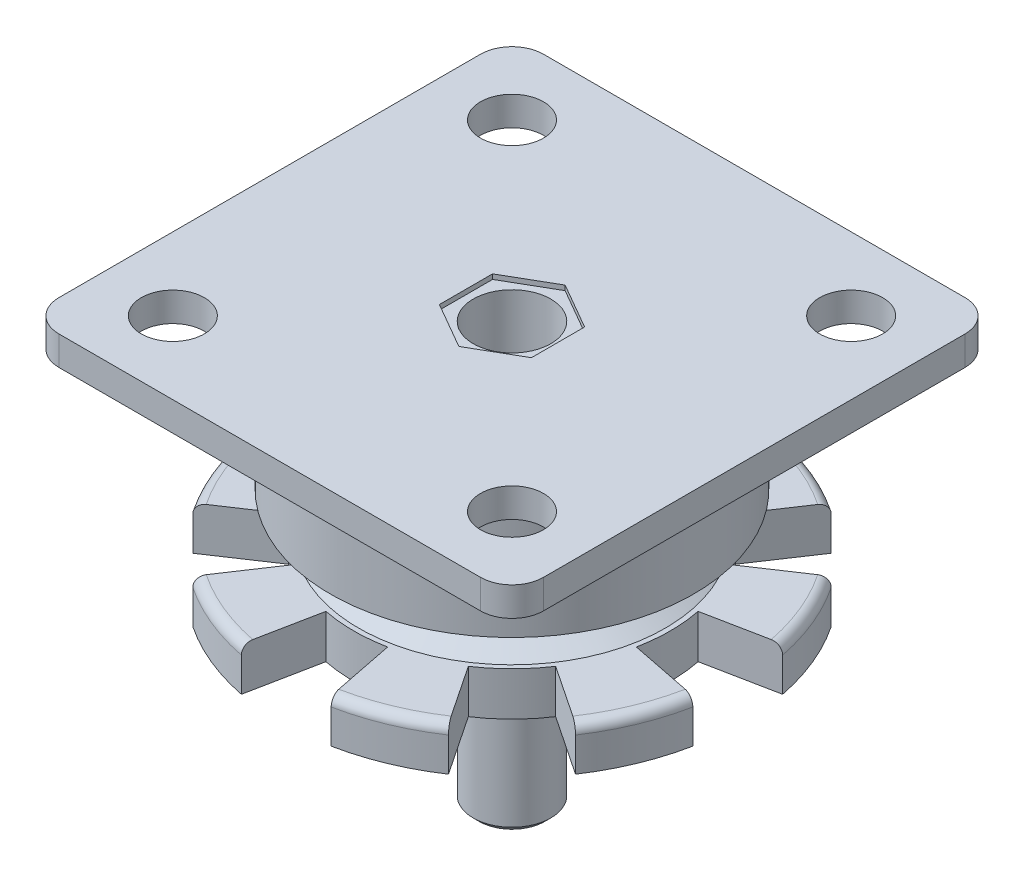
ISO-10303-21;
HEADER;
FILE_DESCRIPTION(('STEP AP214'),'2;1');
FILE_NAME('part.step','',(''),(''),'','','');
FILE_SCHEMA(('AUTOMOTIVE_DESIGN { 1 0 10303 214 1 1 1 1 }'));
ENDSEC;
DATA;
#1=APPLICATION_CONTEXT('core data for automotive mechanical design processes');
#2=APPLICATION_PROTOCOL_DEFINITION('international standard','automotive_design',2000,#1);
#3=PRODUCT_CONTEXT('',#1,'mechanical');
#4=PRODUCT('Part','Part','',(#3));
#5=PRODUCT_RELATED_PRODUCT_CATEGORY('part','',(#4));
#6=PRODUCT_DEFINITION_FORMATION('','',#4);
#7=PRODUCT_DEFINITION_CONTEXT('part definition',#1,'design');
#8=PRODUCT_DEFINITION('design','',#6,#7);
#9=PRODUCT_DEFINITION_SHAPE('','',#8);
#10=(LENGTH_UNIT() NAMED_UNIT(*) SI_UNIT(.MILLI.,.METRE.));
#11=(NAMED_UNIT(*) PLANE_ANGLE_UNIT() SI_UNIT($,.RADIAN.));
#12=(NAMED_UNIT(*) SI_UNIT($,.STERADIAN.) SOLID_ANGLE_UNIT());
#13=UNCERTAINTY_MEASURE_WITH_UNIT(LENGTH_MEASURE(1.E-05),#10,'distance_accuracy_value','');
#14=(GEOMETRIC_REPRESENTATION_CONTEXT(3) GLOBAL_UNCERTAINTY_ASSIGNED_CONTEXT((#13)) GLOBAL_UNIT_ASSIGNED_CONTEXT((#10,
#11,#12)) REPRESENTATION_CONTEXT('',''));
#15=CARTESIAN_POINT('',(0.,0.,0.));
#16=DIRECTION('',(0.,0.,1.));
#17=DIRECTION('',(1.,0.,0.));
#18=AXIS2_PLACEMENT_3D('',#15,#16,#17);
#19=CARTESIAN_POINT('',(0.,0.,-69.));
#20=DIRECTION('',(0.,1.,0.));
#21=DIRECTION('',(0.,0.,1.));
#22=AXIS2_PLACEMENT_3D('',#19,#20,#21);
#23=PLANE('',#22);
#24=CARTESIAN_POINT('',(0.,0.,-69.));
#25=DIRECTION('',(0.,1.,0.));
#26=DIRECTION('',(0.,0.,1.));
#27=AXIS2_PLACEMENT_3D('',#24,#25,#26);
#28=CIRCLE('',#27,6.77299999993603);
#29=CARTESIAN_POINT('',(0.,0.,-62.227000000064));
#30=VERTEX_POINT('',#29);
#31=EDGE_CURVE('E19',#30,#30,#28,.T.);
#32=ORIENTED_EDGE('',*,*,#31,.F.);
#33=EDGE_LOOP('',(#32));
#34=FACE_BOUND('',#33,.T.);
#35=ADVANCED_FACE('F16',(#34),#23,.F.);
#36=CARTESIAN_POINT('',(0.,1.22700000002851,-69.));
#37=DIRECTION('',(0.,1.,0.));
#38=DIRECTION('',(0.,0.,1.));
#39=AXIS2_PLACEMENT_3D('',#36,#37,#38);
#40=CONICAL_SURFACE('',#39,7.99999999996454,0.785398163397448);
#41=ORIENTED_EDGE('',*,*,#31,.T.);
#42=EDGE_LOOP('',(#41));
#43=FACE_BOUND('',#42,.T.);
#44=CARTESIAN_POINT('',(0.,1.227,-69.));
#45=DIRECTION('',(0.,-1.,0.));
#46=DIRECTION('',(0.,0.,-1.));
#47=AXIS2_PLACEMENT_3D('',#44,#45,#46);
#48=CIRCLE('',#47,8.);
#49=CARTESIAN_POINT('',(0.,1.227,-77.));
#50=VERTEX_POINT('',#49);
#51=EDGE_CURVE('E360',#50,#50,#48,.F.);
#52=ORIENTED_EDGE('',*,*,#51,.F.);
#53=EDGE_LOOP('',(#52));
#54=FACE_BOUND('',#53,.T.);
#55=ADVANCED_FACE('F1612',(#43,#54),#40,.T.);
#56=CARTESIAN_POINT('',(0.,81.,-69.));
#57=DIRECTION('',(0.,-1.,0.));
#58=DIRECTION('',(0.,0.,-1.));
#59=AXIS2_PLACEMENT_3D('',#56,#57,#58);
#60=CYLINDRICAL_SURFACE('',#59,8.);
#61=ORIENTED_EDGE('',*,*,#51,.T.);
#62=EDGE_LOOP('',(#61));
#63=FACE_BOUND('',#62,.T.);
#64=CARTESIAN_POINT('',(0.,38.,-69.));
#65=DIRECTION('',(0.,-1.,0.));
#66=DIRECTION('',(0.,0.,-1.));
#67=AXIS2_PLACEMENT_3D('',#64,#65,#66);
#68=CIRCLE('',#67,8.);
#69=CARTESIAN_POINT('',(0.,38.,-77.));
#70=VERTEX_POINT('',#69);
#71=EDGE_CURVE('E625',#70,#70,#68,.T.);
#72=ORIENTED_EDGE('',*,*,#71,.T.);
#73=EDGE_LOOP('',(#72));
#74=FACE_BOUND('',#73,.T.);
#75=ADVANCED_FACE('F1606',(#63,#74),#60,.T.);
#76=CARTESIAN_POINT('',(0.,132.,-69.));
#77=DIRECTION('',(0.,-1.,0.));
#78=DIRECTION('',(0.,0.,-1.));
#79=AXIS2_PLACEMENT_3D('',#76,#77,#78);
#80=CYLINDRICAL_SURFACE('',#79,47.5);
#81=DIRECTION('',(0.,1.,0.));
#82=VECTOR('',#81,1.);
#83=CARTESIAN_POINT('',(39.4948065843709,50.,-95.3895860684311));
#84=LINE('',#83,#82);
#85=CARTESIAN_POINT('',(39.4948065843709,45.,-95.3895860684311));
#86=VERTEX_POINT('',#85);
#87=CARTESIAN_POINT('',(39.4948065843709,38.,-95.3895860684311));
#88=VERTEX_POINT('',#87);
#89=EDGE_CURVE('E412',#86,#88,#84,.F.);
#90=ORIENTED_EDGE('',*,*,#89,.F.);
#91=CARTESIAN_POINT('',(0.,45.,-69.));
#92=DIRECTION('',(0.,1.,0.));
#93=DIRECTION('',(0.,0.,1.));
#94=AXIS2_PLACEMENT_3D('',#91,#92,#93);
#95=CIRCLE('',#94,47.5);
#96=CARTESIAN_POINT('',(46.5873008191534,45.,-78.2667902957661));
#97=VERTEX_POINT('',#96);
#98=EDGE_CURVE('E405',#97,#86,#95,.T.);
#99=ORIENTED_EDGE('',*,*,#98,.F.);
#100=DIRECTION('',(0.,1.,0.));
#101=VECTOR('',#100,1.);
#102=CARTESIAN_POINT('',(46.5873008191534,50.,-78.2667902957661));
#103=LINE('',#102,#101);
#104=CARTESIAN_POINT('',(46.5873008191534,38.,-78.2667902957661));
#105=VERTEX_POINT('',#104);
#106=EDGE_CURVE('E403',#105,#97,#103,.T.);
#107=ORIENTED_EDGE('',*,*,#106,.F.);
#108=CARTESIAN_POINT('',(0.,38.,-69.));
#109=DIRECTION('',(0.,-1.,0.));
#110=DIRECTION('',(0.,0.,-1.));
#111=AXIS2_PLACEMENT_3D('',#108,#109,#110);
#112=CIRCLE('',#111,47.5);
#113=EDGE_CURVE('E848',#105,#88,#112,.F.);
#114=ORIENTED_EDGE('',*,*,#113,.T.);
#115=EDGE_LOOP('',(#90,#99,#107,#114));
#116=FACE_BOUND('',#115,.T.);
#117=ADVANCED_FACE('F1611',(#116),#80,.T.);
#118=CARTESIAN_POINT('',(0.,132.,-69.));
#119=DIRECTION('',(0.,-1.,0.));
#120=DIRECTION('',(0.,0.,-1.));
#121=AXIS2_PLACEMENT_3D('',#118,#119,#120);
#122=CYLINDRICAL_SURFACE('',#121,47.5);
#123=DIRECTION('',(0.,1.,0.));
#124=VECTOR('',#123,1.);
#125=CARTESIAN_POINT('',(46.5873008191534,50.,-59.7332097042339));
#126=LINE('',#125,#124);
#127=CARTESIAN_POINT('',(46.5873008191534,45.,-59.7332097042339));
#128=VERTEX_POINT('',#127);
#129=CARTESIAN_POINT('',(46.5873008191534,38.,-59.7332097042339));
#130=VERTEX_POINT('',#129);
#131=EDGE_CURVE('E399',#128,#130,#126,.F.);
#132=ORIENTED_EDGE('',*,*,#131,.F.);
#133=CARTESIAN_POINT('',(0.,45.,-69.));
#134=DIRECTION('',(0.,1.,0.));
#135=DIRECTION('',(0.,0.,1.));
#136=AXIS2_PLACEMENT_3D('',#133,#134,#135);
#137=CIRCLE('',#136,47.5);
#138=CARTESIAN_POINT('',(39.4948065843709,45.,-42.6104139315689));
#139=VERTEX_POINT('',#138);
#140=EDGE_CURVE('E392',#139,#128,#137,.T.);
#141=ORIENTED_EDGE('',*,*,#140,.F.);
#142=DIRECTION('',(0.,1.,0.));
#143=VECTOR('',#142,1.);
#144=CARTESIAN_POINT('',(39.4948065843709,50.,-42.6104139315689));
#145=LINE('',#144,#143);
#146=CARTESIAN_POINT('',(39.4948065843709,38.,-42.6104139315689));
#147=VERTEX_POINT('',#146);
#148=EDGE_CURVE('E390',#147,#139,#145,.T.);
#149=ORIENTED_EDGE('',*,*,#148,.F.);
#150=CARTESIAN_POINT('',(0.,38.,-69.));
#151=DIRECTION('',(0.,-1.,0.));
#152=DIRECTION('',(0.,0.,-1.));
#153=AXIS2_PLACEMENT_3D('',#150,#151,#152);
#154=CIRCLE('',#153,47.5);
#155=EDGE_CURVE('E359',#147,#130,#154,.F.);
#156=ORIENTED_EDGE('',*,*,#155,.T.);
#157=EDGE_LOOP('',(#132,#141,#149,#156));
#158=FACE_BOUND('',#157,.T.);
#159=ADVANCED_FACE('F853',(#158),#122,.T.);
#160=CARTESIAN_POINT('',(0.,132.,-69.));
#161=DIRECTION('',(0.,-1.,0.));
#162=DIRECTION('',(0.,0.,-1.));
#163=AXIS2_PLACEMENT_3D('',#160,#161,#162);
#164=CYLINDRICAL_SURFACE('',#163,47.5);
#165=DIRECTION('',(0.,1.,0.));
#166=VECTOR('',#165,1.);
#167=CARTESIAN_POINT('',(26.3895860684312,50.,-29.5051934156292));
#168=LINE('',#167,#166);
#169=CARTESIAN_POINT('',(26.3895860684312,45.,-29.5051934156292));
#170=VERTEX_POINT('',#169);
#171=CARTESIAN_POINT('',(26.3895860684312,38.,-29.5051934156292));
#172=VERTEX_POINT('',#171);
#173=EDGE_CURVE('E386',#170,#172,#168,.F.);
#174=ORIENTED_EDGE('',*,*,#173,.F.);
#175=CARTESIAN_POINT('',(0.,45.,-69.));
#176=DIRECTION('',(0.,1.,0.));
#177=DIRECTION('',(0.,0.,1.));
#178=AXIS2_PLACEMENT_3D('',#175,#176,#177);
#179=CIRCLE('',#178,47.5);
#180=CARTESIAN_POINT('',(9.26679029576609,45.,-22.4126991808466));
#181=VERTEX_POINT('',#180);
#182=EDGE_CURVE('E365',#181,#170,#179,.T.);
#183=ORIENTED_EDGE('',*,*,#182,.F.);
#184=DIRECTION('',(0.,1.,0.));
#185=VECTOR('',#184,1.);
#186=CARTESIAN_POINT('',(9.26679029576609,50.,-22.4126991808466));
#187=LINE('',#186,#185);
#188=CARTESIAN_POINT('',(9.26679029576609,38.,-22.4126991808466));
#189=VERTEX_POINT('',#188);
#190=EDGE_CURVE('E362',#189,#181,#187,.T.);
#191=ORIENTED_EDGE('',*,*,#190,.F.);
#192=CARTESIAN_POINT('',(0.,38.,-69.));
#193=DIRECTION('',(0.,-1.,0.));
#194=DIRECTION('',(0.,0.,-1.));
#195=AXIS2_PLACEMENT_3D('',#192,#193,#194);
#196=CIRCLE('',#195,47.5);
#197=EDGE_CURVE('E348',#189,#172,#196,.F.);
#198=ORIENTED_EDGE('',*,*,#197,.T.);
#199=EDGE_LOOP('',(#174,#183,#191,#198));
#200=FACE_BOUND('',#199,.T.);
#201=ADVANCED_FACE('F363',(#200),#164,.T.);
#202=CARTESIAN_POINT('',(0.,132.,-69.));
#203=DIRECTION('',(0.,-1.,0.));
#204=DIRECTION('',(0.,0.,-1.));
#205=AXIS2_PLACEMENT_3D('',#202,#203,#204);
#206=CYLINDRICAL_SURFACE('',#205,47.5);
#207=DIRECTION('',(0.,1.,0.));
#208=VECTOR('',#207,1.);
#209=CARTESIAN_POINT('',(-9.26679029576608,50.,-22.4126991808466));
#210=LINE('',#209,#208);
#211=CARTESIAN_POINT('',(-9.26679029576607,45.,-22.4126991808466));
#212=VERTEX_POINT('',#211);
#213=CARTESIAN_POINT('',(-9.26679029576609,38.,-22.4126991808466));
#214=VERTEX_POINT('',#213);
#215=EDGE_CURVE('E687',#212,#214,#210,.F.);
#216=ORIENTED_EDGE('',*,*,#215,.F.);
#217=CARTESIAN_POINT('',(0.,45.,-69.));
#218=DIRECTION('',(0.,1.,0.));
#219=DIRECTION('',(0.,0.,1.));
#220=AXIS2_PLACEMENT_3D('',#217,#218,#219);
#221=CIRCLE('',#220,47.5);
#222=CARTESIAN_POINT('',(-26.3895860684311,45.,-29.5051934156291));
#223=VERTEX_POINT('',#222);
#224=EDGE_CURVE('E673',#223,#212,#221,.T.);
#225=ORIENTED_EDGE('',*,*,#224,.F.);
#226=DIRECTION('',(0.,1.,0.));
#227=VECTOR('',#226,1.);
#228=CARTESIAN_POINT('',(-26.3895860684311,50.,-29.5051934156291));
#229=LINE('',#228,#227);
#230=CARTESIAN_POINT('',(-26.3895860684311,38.,-29.5051934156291));
#231=VERTEX_POINT('',#230);
#232=EDGE_CURVE('E671',#231,#223,#229,.T.);
#233=ORIENTED_EDGE('',*,*,#232,.F.);
#234=CARTESIAN_POINT('',(0.,38.,-69.));
#235=DIRECTION('',(0.,-1.,0.));
#236=DIRECTION('',(0.,0.,-1.));
#237=AXIS2_PLACEMENT_3D('',#234,#235,#236);
#238=CIRCLE('',#237,47.5);
#239=EDGE_CURVE('E838',#231,#214,#238,.F.);
#240=ORIENTED_EDGE('',*,*,#239,.T.);
#241=EDGE_LOOP('',(#216,#225,#233,#240));
#242=FACE_BOUND('',#241,.T.);
#243=ADVANCED_FACE('F1641',(#242),#206,.T.);
#244=CARTESIAN_POINT('',(0.,132.,-69.));
#245=DIRECTION('',(0.,-1.,0.));
#246=DIRECTION('',(0.,0.,-1.));
#247=AXIS2_PLACEMENT_3D('',#244,#245,#246);
#248=CYLINDRICAL_SURFACE('',#247,47.5);
#249=DIRECTION('',(0.,1.,0.));
#250=VECTOR('',#249,1.);
#251=CARTESIAN_POINT('',(-39.4948065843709,50.,-42.6104139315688));
#252=LINE('',#251,#250);
#253=CARTESIAN_POINT('',(-39.4948065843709,45.,-42.6104139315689));
#254=VERTEX_POINT('',#253);
#255=CARTESIAN_POINT('',(-39.4948065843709,38.,-42.6104139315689));
#256=VERTEX_POINT('',#255);
#257=EDGE_CURVE('E668',#254,#256,#252,.F.);
#258=ORIENTED_EDGE('',*,*,#257,.F.);
#259=CARTESIAN_POINT('',(0.,45.,-69.));
#260=DIRECTION('',(0.,1.,0.));
#261=DIRECTION('',(0.,0.,1.));
#262=AXIS2_PLACEMENT_3D('',#259,#260,#261);
#263=CIRCLE('',#262,47.5);
#264=CARTESIAN_POINT('',(-46.5873008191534,45.,-59.7332097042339));
#265=VERTEX_POINT('',#264);
#266=EDGE_CURVE('E661',#265,#254,#263,.T.);
#267=ORIENTED_EDGE('',*,*,#266,.F.);
#268=DIRECTION('',(0.,1.,0.));
#269=VECTOR('',#268,1.);
#270=CARTESIAN_POINT('',(-46.5873008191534,50.,-59.7332097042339));
#271=LINE('',#270,#269);
#272=CARTESIAN_POINT('',(-46.5873008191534,38.,-59.7332097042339));
#273=VERTEX_POINT('',#272);
#274=EDGE_CURVE('E659',#273,#265,#271,.T.);
#275=ORIENTED_EDGE('',*,*,#274,.F.);
#276=CARTESIAN_POINT('',(0.,38.,-69.));
#277=DIRECTION('',(0.,-1.,0.));
#278=DIRECTION('',(0.,0.,-1.));
#279=AXIS2_PLACEMENT_3D('',#276,#277,#278);
#280=CIRCLE('',#279,47.5);
#281=EDGE_CURVE('E840',#273,#256,#280,.F.);
#282=ORIENTED_EDGE('',*,*,#281,.T.);
#283=EDGE_LOOP('',(#258,#267,#275,#282));
#284=FACE_BOUND('',#283,.T.);
#285=ADVANCED_FACE('F1250',(#284),#248,.T.);
#286=CARTESIAN_POINT('',(0.,132.,-69.));
#287=DIRECTION('',(0.,-1.,0.));
#288=DIRECTION('',(0.,0.,-1.));
#289=AXIS2_PLACEMENT_3D('',#286,#287,#288);
#290=CYLINDRICAL_SURFACE('',#289,47.5);
#291=DIRECTION('',(0.,1.,0.));
#292=VECTOR('',#291,1.);
#293=CARTESIAN_POINT('',(-46.5873008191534,50.,-78.2667902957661));
#294=LINE('',#293,#292);
#295=CARTESIAN_POINT('',(-46.5873008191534,45.,-78.2667902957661));
#296=VERTEX_POINT('',#295);
#297=CARTESIAN_POINT('',(-46.5873008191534,38.,-78.2667902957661));
#298=VERTEX_POINT('',#297);
#299=EDGE_CURVE('E655',#296,#298,#294,.F.);
#300=ORIENTED_EDGE('',*,*,#299,.F.);
#301=CARTESIAN_POINT('',(0.,45.,-69.));
#302=DIRECTION('',(0.,1.,0.));
#303=DIRECTION('',(0.,0.,1.));
#304=AXIS2_PLACEMENT_3D('',#301,#302,#303);
#305=CIRCLE('',#304,47.5);
#306=CARTESIAN_POINT('',(-39.4948065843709,45.,-95.3895860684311));
#307=VERTEX_POINT('',#306);
#308=EDGE_CURVE('E648',#307,#296,#305,.T.);
#309=ORIENTED_EDGE('',*,*,#308,.F.);
#310=DIRECTION('',(0.,1.,0.));
#311=VECTOR('',#310,1.);
#312=CARTESIAN_POINT('',(-39.4948065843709,50.,-95.3895860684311));
#313=LINE('',#312,#311);
#314=CARTESIAN_POINT('',(-39.4948065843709,38.,-95.3895860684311));
#315=VERTEX_POINT('',#314);
#316=EDGE_CURVE('E646',#315,#307,#313,.T.);
#317=ORIENTED_EDGE('',*,*,#316,.F.);
#318=CARTESIAN_POINT('',(0.,38.,-69.));
#319=DIRECTION('',(0.,-1.,0.));
#320=DIRECTION('',(0.,0.,-1.));
#321=AXIS2_PLACEMENT_3D('',#318,#319,#320);
#322=CIRCLE('',#321,47.5);
#323=EDGE_CURVE('E842',#315,#298,#322,.F.);
#324=ORIENTED_EDGE('',*,*,#323,.T.);
#325=EDGE_LOOP('',(#300,#309,#317,#324));
#326=FACE_BOUND('',#325,.T.);
#327=ADVANCED_FACE('F1659',(#326),#290,.T.);
#328=CARTESIAN_POINT('',(0.,132.,-69.));
#329=DIRECTION('',(0.,-1.,0.));
#330=DIRECTION('',(0.,0.,-1.));
#331=AXIS2_PLACEMENT_3D('',#328,#329,#330);
#332=CYLINDRICAL_SURFACE('',#331,47.5);
#333=DIRECTION('',(0.,1.,0.));
#334=VECTOR('',#333,1.);
#335=CARTESIAN_POINT('',(-26.3895860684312,50.,-108.494806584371));
#336=LINE('',#335,#334);
#337=CARTESIAN_POINT('',(-26.3895860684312,45.,-108.494806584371));
#338=VERTEX_POINT('',#337);
#339=CARTESIAN_POINT('',(-26.3895860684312,38.,-108.494806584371));
#340=VERTEX_POINT('',#339);
#341=EDGE_CURVE('E642',#338,#340,#336,.F.);
#342=ORIENTED_EDGE('',*,*,#341,.F.);
#343=CARTESIAN_POINT('',(0.,45.,-69.));
#344=DIRECTION('',(0.,1.,0.));
#345=DIRECTION('',(0.,0.,1.));
#346=AXIS2_PLACEMENT_3D('',#343,#344,#345);
#347=CIRCLE('',#346,47.5);
#348=CARTESIAN_POINT('',(-9.26679029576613,45.,-115.587300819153));
#349=VERTEX_POINT('',#348);
#350=EDGE_CURVE('E635',#349,#338,#347,.T.);
#351=ORIENTED_EDGE('',*,*,#350,.F.);
#352=DIRECTION('',(0.,1.,0.));
#353=VECTOR('',#352,1.);
#354=CARTESIAN_POINT('',(-9.26679029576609,50.,-115.587300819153));
#355=LINE('',#354,#353);
#356=CARTESIAN_POINT('',(-9.26679029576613,38.,-115.587300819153));
#357=VERTEX_POINT('',#356);
#358=EDGE_CURVE('E633',#357,#349,#355,.T.);
#359=ORIENTED_EDGE('',*,*,#358,.F.);
#360=CARTESIAN_POINT('',(0.,38.,-69.));
#361=DIRECTION('',(0.,-1.,0.));
#362=DIRECTION('',(0.,0.,-1.));
#363=AXIS2_PLACEMENT_3D('',#360,#361,#362);
#364=CIRCLE('',#363,47.5);
#365=EDGE_CURVE('E844',#357,#340,#364,.F.);
#366=ORIENTED_EDGE('',*,*,#365,.T.);
#367=EDGE_LOOP('',(#342,#351,#359,#366));
#368=FACE_BOUND('',#367,.T.);
#369=ADVANCED_FACE('F1668',(#368),#332,.T.);
#370=CARTESIAN_POINT('',(0.,132.,-69.));
#371=DIRECTION('',(0.,-1.,0.));
#372=DIRECTION('',(0.,0.,-1.));
#373=AXIS2_PLACEMENT_3D('',#370,#371,#372);
#374=CYLINDRICAL_SURFACE('',#373,47.5);
#375=DIRECTION('',(0.,1.,0.));
#376=VECTOR('',#375,1.);
#377=CARTESIAN_POINT('',(26.3895860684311,50.,-108.494806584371));
#378=LINE('',#377,#376);
#379=CARTESIAN_POINT('',(26.3895860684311,38.,-108.494806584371));
#380=VERTEX_POINT('',#379);
#381=CARTESIAN_POINT('',(26.389586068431,45.,-108.494806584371));
#382=VERTEX_POINT('',#381);
#383=EDGE_CURVE('E416',#380,#382,#378,.T.);
#384=ORIENTED_EDGE('',*,*,#383,.F.);
#385=CARTESIAN_POINT('',(0.,38.,-69.));
#386=DIRECTION('',(0.,-1.,0.));
#387=DIRECTION('',(0.,0.,-1.));
#388=AXIS2_PLACEMENT_3D('',#385,#386,#387);
#389=CIRCLE('',#388,47.5);
#390=CARTESIAN_POINT('',(9.26679029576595,38.,-115.587300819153));
#391=VERTEX_POINT('',#390);
#392=EDGE_CURVE('E846',#380,#391,#389,.F.);
#393=ORIENTED_EDGE('',*,*,#392,.T.);
#394=DIRECTION('',(0.,1.,0.));
#395=VECTOR('',#394,1.);
#396=CARTESIAN_POINT('',(9.26679029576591,50.,-115.587300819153));
#397=LINE('',#396,#395);
#398=CARTESIAN_POINT('',(9.26679029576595,45.,-115.587300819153));
#399=VERTEX_POINT('',#398);
#400=EDGE_CURVE('E629',#399,#391,#397,.F.);
#401=ORIENTED_EDGE('',*,*,#400,.F.);
#402=CARTESIAN_POINT('',(0.,45.,-69.));
#403=DIRECTION('',(0.,1.,0.));
#404=DIRECTION('',(0.,0.,1.));
#405=AXIS2_PLACEMENT_3D('',#402,#403,#404);
#406=CIRCLE('',#405,47.5);
#407=EDGE_CURVE('E417',#382,#399,#406,.T.);
#408=ORIENTED_EDGE('',*,*,#407,.F.);
#409=EDGE_LOOP('',(#384,#393,#401,#408));
#410=FACE_BOUND('',#409,.T.);
#411=ADVANCED_FACE('F1678',(#410),#374,.T.);
#412=CARTESIAN_POINT('',(0.,38.,-69.));
#413=DIRECTION('',(0.,1.,0.));
#414=DIRECTION('',(0.,0.,1.));
#415=AXIS2_PLACEMENT_3D('',#412,#413,#414);
#416=PLANE('',#415);
#417=ORIENTED_EDGE('',*,*,#71,.F.);
#418=EDGE_LOOP('',(#417));
#419=FACE_BOUND('',#418,.T.);
#420=DIRECTION('',(0.195090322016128,0.,-0.980785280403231));
#421=VECTOR('',#420,1.);
#422=CARTESIAN_POINT('',(-6.37295051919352,38.,-36.9610141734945));
#423=LINE('',#422,#421);
#424=CARTESIAN_POINT('',(-6.37295051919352,38.,-36.9610141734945));
#425=VERTEX_POINT('',#424);
#426=EDGE_CURVE('E381',#214,#425,#423,.T.);
#427=ORIENTED_EDGE('',*,*,#426,.F.);
#428=ORIENTED_EDGE('',*,*,#239,.F.);
#429=DIRECTION('',(-0.555570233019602,0.,0.831469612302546));
#430=VECTOR('',#429,1.);
#431=CARTESIAN_POINT('',(-26.3895860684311,38.,-29.5051934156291));
#432=LINE('',#431,#430);
#433=CARTESIAN_POINT('',(-18.1486276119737,38.,-41.8386593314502));
#434=VERTEX_POINT('',#433);
#435=EDGE_CURVE('E669',#434,#231,#432,.T.);
#436=ORIENTED_EDGE('',*,*,#435,.F.);
#437=CARTESIAN_POINT('',(-1.21430643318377E-13,38.,-69.));
#438=DIRECTION('',(0.,1.,0.));
#439=DIRECTION('',(0.,0.,1.));
#440=AXIS2_PLACEMENT_3D('',#437,#438,#439);
#441=CIRCLE('',#440,32.6666666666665);
#442=CARTESIAN_POINT('',(-27.1613406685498,38.,-50.8513723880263));
#443=VERTEX_POINT('',#442);
#444=EDGE_CURVE('E1049',#443,#434,#441,.T.);
#445=ORIENTED_EDGE('',*,*,#444,.F.);
#446=DIRECTION('',(0.831469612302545,0.,-0.555570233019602));
#447=VECTOR('',#446,1.);
#448=CARTESIAN_POINT('',(-27.1613406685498,38.,-50.8513723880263));
#449=LINE('',#448,#447);
#450=EDGE_CURVE('E665',#256,#443,#449,.T.);
#451=ORIENTED_EDGE('',*,*,#450,.F.);
#452=ORIENTED_EDGE('',*,*,#281,.F.);
#453=DIRECTION('',(-0.980785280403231,0.,0.195090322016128));
#454=VECTOR('',#453,1.);
#455=CARTESIAN_POINT('',(-46.5873008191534,38.,-59.7332097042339));
#456=LINE('',#455,#454);
#457=CARTESIAN_POINT('',(-32.0389858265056,38.,-62.6270494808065));
#458=VERTEX_POINT('',#457);
#459=EDGE_CURVE('E656',#458,#273,#456,.T.);
#460=ORIENTED_EDGE('',*,*,#459,.F.);
#461=CARTESIAN_POINT('',(0.,38.,-69.));
#462=DIRECTION('',(0.,1.,0.));
#463=DIRECTION('',(0.,0.,1.));
#464=AXIS2_PLACEMENT_3D('',#461,#462,#463);
#465=CIRCLE('',#464,32.6666666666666);
#466=CARTESIAN_POINT('',(-32.0389858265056,38.,-75.3729505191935));
#467=VERTEX_POINT('',#466);
#468=EDGE_CURVE('E1007',#467,#458,#465,.T.);
#469=ORIENTED_EDGE('',*,*,#468,.F.);
#470=DIRECTION('',(0.980785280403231,0.,0.195090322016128));
#471=VECTOR('',#470,1.);
#472=CARTESIAN_POINT('',(-32.0389858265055,38.,-75.3729505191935));
#473=LINE('',#472,#471);
#474=EDGE_CURVE('E652',#298,#467,#473,.T.);
#475=ORIENTED_EDGE('',*,*,#474,.F.);
#476=ORIENTED_EDGE('',*,*,#323,.F.);
#477=DIRECTION('',(-0.831469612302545,0.,-0.555570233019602));
#478=VECTOR('',#477,1.);
#479=CARTESIAN_POINT('',(-39.4948065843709,38.,-95.3895860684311));
#480=LINE('',#479,#478);
#481=CARTESIAN_POINT('',(-27.1613406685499,38.,-87.1486276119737));
#482=VERTEX_POINT('',#481);
#483=EDGE_CURVE('E643',#482,#315,#480,.T.);
#484=ORIENTED_EDGE('',*,*,#483,.F.);
#485=CARTESIAN_POINT('',(-2.94902990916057E-13,38.,-69.));
#486=DIRECTION('',(0.,1.,0.));
#487=DIRECTION('',(0.,0.,1.));
#488=AXIS2_PLACEMENT_3D('',#485,#486,#487);
#489=CIRCLE('',#488,32.6666666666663);
#490=CARTESIAN_POINT('',(-18.1486276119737,38.,-96.1613406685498));
#491=VERTEX_POINT('',#490);
#492=EDGE_CURVE('E953',#491,#482,#489,.T.);
#493=ORIENTED_EDGE('',*,*,#492,.F.);
#494=DIRECTION('',(0.555570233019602,0.,0.831469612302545));
#495=VECTOR('',#494,1.);
#496=CARTESIAN_POINT('',(-18.1486276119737,38.,-96.1613406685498));
#497=LINE('',#496,#495);
#498=EDGE_CURVE('E639',#340,#491,#497,.T.);
#499=ORIENTED_EDGE('',*,*,#498,.F.);
#500=ORIENTED_EDGE('',*,*,#365,.F.);
#501=DIRECTION('',(-0.195090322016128,0.,-0.980785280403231));
#502=VECTOR('',#501,1.);
#503=CARTESIAN_POINT('',(-9.26679029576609,38.,-115.587300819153));
#504=LINE('',#503,#502);
#505=CARTESIAN_POINT('',(-6.3729505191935,38.,-101.038985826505));
#506=VERTEX_POINT('',#505);
#507=EDGE_CURVE('E630',#506,#357,#504,.T.);
#508=ORIENTED_EDGE('',*,*,#507,.F.);
#509=CARTESIAN_POINT('',(0.,38.,-69.));
#510=DIRECTION('',(0.,1.,0.));
#511=DIRECTION('',(0.,0.,1.));
#512=AXIS2_PLACEMENT_3D('',#509,#510,#511);
#513=CIRCLE('',#512,32.6666666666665);
#514=CARTESIAN_POINT('',(6.37295051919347,38.,-101.038985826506));
#515=VERTEX_POINT('',#514);
#516=EDGE_CURVE('E586',#515,#506,#513,.T.);
#517=ORIENTED_EDGE('',*,*,#516,.F.);
#518=DIRECTION('',(-0.195090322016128,0.,0.980785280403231));
#519=VECTOR('',#518,1.);
#520=CARTESIAN_POINT('',(6.37295051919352,38.,-101.038985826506));
#521=LINE('',#520,#519);
#522=EDGE_CURVE('E626',#391,#515,#521,.T.);
#523=ORIENTED_EDGE('',*,*,#522,.F.);
#524=ORIENTED_EDGE('',*,*,#392,.F.);
#525=DIRECTION('',(0.555570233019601,0.,-0.831469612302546));
#526=VECTOR('',#525,1.);
#527=CARTESIAN_POINT('',(26.3895860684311,38.,-108.494806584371));
#528=LINE('',#527,#526);
#529=CARTESIAN_POINT('',(18.1486276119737,38.,-96.1613406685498));
#530=VERTEX_POINT('',#529);
#531=EDGE_CURVE('E413',#530,#380,#528,.T.);
#532=ORIENTED_EDGE('',*,*,#531,.F.);
#533=CARTESIAN_POINT('',(2.1163626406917E-13,38.,-69.));
#534=DIRECTION('',(0.,1.,0.));
#535=DIRECTION('',(0.,0.,1.));
#536=AXIS2_PLACEMENT_3D('',#533,#534,#535);
#537=CIRCLE('',#536,32.6666666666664);
#538=CARTESIAN_POINT('',(27.1613406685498,38.,-87.1486276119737));
#539=VERTEX_POINT('',#538);
#540=EDGE_CURVE('E824',#539,#530,#537,.T.);
#541=ORIENTED_EDGE('',*,*,#540,.F.);
#542=DIRECTION('',(-0.831469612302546,0.,0.555570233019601));
#543=VECTOR('',#542,1.);
#544=CARTESIAN_POINT('',(27.1613406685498,38.,-87.1486276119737));
#545=LINE('',#544,#543);
#546=EDGE_CURVE('E409',#88,#539,#545,.T.);
#547=ORIENTED_EDGE('',*,*,#546,.F.);
#548=ORIENTED_EDGE('',*,*,#113,.F.);
#549=DIRECTION('',(0.980785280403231,0.,-0.195090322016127));
#550=VECTOR('',#549,1.);
#551=CARTESIAN_POINT('',(46.5873008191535,38.,-78.2667902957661));
#552=LINE('',#551,#550);
#553=CARTESIAN_POINT('',(32.0389858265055,38.,-75.3729505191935));
#554=VERTEX_POINT('',#553);
#555=EDGE_CURVE('E400',#554,#105,#552,.T.);
#556=ORIENTED_EDGE('',*,*,#555,.F.);
#557=CARTESIAN_POINT('',(2.56739074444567E-13,38.,-69.));
#558=DIRECTION('',(0.,1.,0.));
#559=DIRECTION('',(0.,0.,1.));
#560=AXIS2_PLACEMENT_3D('',#557,#558,#559);
#561=CIRCLE('',#560,32.6666666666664);
#562=CARTESIAN_POINT('',(32.0389858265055,38.,-62.6270494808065));
#563=VERTEX_POINT('',#562);
#564=EDGE_CURVE('E783',#563,#554,#561,.T.);
#565=ORIENTED_EDGE('',*,*,#564,.F.);
#566=DIRECTION('',(-0.98078528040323,0.,-0.195090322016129));
#567=VECTOR('',#566,1.);
#568=CARTESIAN_POINT('',(32.0389858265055,38.,-62.6270494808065));
#569=LINE('',#568,#567);
#570=EDGE_CURVE('E396',#130,#563,#569,.T.);
#571=ORIENTED_EDGE('',*,*,#570,.F.);
#572=ORIENTED_EDGE('',*,*,#155,.F.);
#573=DIRECTION('',(0.831469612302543,0.,0.555570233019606));
#574=VECTOR('',#573,1.);
#575=CARTESIAN_POINT('',(39.4948065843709,38.,-42.6104139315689));
#576=LINE('',#575,#574);
#577=CARTESIAN_POINT('',(27.1613406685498,38.,-50.8513723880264));
#578=VERTEX_POINT('',#577);
#579=EDGE_CURVE('E387',#578,#147,#576,.T.);
#580=ORIENTED_EDGE('',*,*,#579,.F.);
#581=CARTESIAN_POINT('',(1.07552855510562E-13,38.,-69.));
#582=DIRECTION('',(0.,1.,0.));
#583=DIRECTION('',(0.,0.,1.));
#584=AXIS2_PLACEMENT_3D('',#581,#582,#583);
#585=CIRCLE('',#584,32.6666666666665);
#586=CARTESIAN_POINT('',(18.1486276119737,38.,-41.8386593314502));
#587=VERTEX_POINT('',#586);
#588=EDGE_CURVE('E729',#587,#578,#585,.T.);
#589=ORIENTED_EDGE('',*,*,#588,.F.);
#590=DIRECTION('',(-0.555570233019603,0.,-0.831469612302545));
#591=VECTOR('',#590,1.);
#592=CARTESIAN_POINT('',(18.1486276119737,38.,-41.8386593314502));
#593=LINE('',#592,#591);
#594=EDGE_CURVE('E356',#172,#587,#593,.T.);
#595=ORIENTED_EDGE('',*,*,#594,.F.);
#596=ORIENTED_EDGE('',*,*,#197,.F.);
#597=DIRECTION('',(0.195090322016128,0.,0.980785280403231));
#598=VECTOR('',#597,1.);
#599=CARTESIAN_POINT('',(9.26679029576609,38.,-22.4126991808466));
#600=LINE('',#599,#598);
#601=CARTESIAN_POINT('',(6.37295051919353,38.,-36.9610141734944));
#602=VERTEX_POINT('',#601);
#603=EDGE_CURVE('E353',#602,#189,#600,.T.);
#604=ORIENTED_EDGE('',*,*,#603,.F.);
#605=CARTESIAN_POINT('',(0.,38.,-69.));
#606=DIRECTION('',(0.,1.,0.));
#607=DIRECTION('',(0.,0.,1.));
#608=AXIS2_PLACEMENT_3D('',#605,#606,#607);
#609=CIRCLE('',#608,32.6666666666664);
#610=EDGE_CURVE('E691',#425,#602,#609,.T.);
#611=ORIENTED_EDGE('',*,*,#610,.F.);
#612=EDGE_LOOP('',(#427,#428,#436,#445,#451,#452,#460,#469,#475,#476,#484,#493,#499,#500,#508,
#517,#523,#524,#532,#541,#547,#548,#556,#565,#571,#572,#580,#589,#595,#596,#604,#611));
#613=FACE_BOUND('',#612,.T.);
#614=ADVANCED_FACE('F351',(#419,#613),#416,.F.);
#615=CARTESIAN_POINT('',(0.,45.,-69.));
#616=DIRECTION('',(0.,1.,0.));
#617=DIRECTION('',(0.,0.,1.));
#618=AXIS2_PLACEMENT_3D('',#615,#616,#617);
#619=TOROIDAL_SURFACE('',#618,45.5,2.);
#620=CARTESIAN_POINT('',(0.,47.,-69.));
#621=DIRECTION('',(0.,-1.,0.));
#622=DIRECTION('',(0.195090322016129,0.,-0.98078528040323));
#623=AXIS2_PLACEMENT_3D('',#620,#621,#622);
#624=CIRCLE('',#623,45.5);
#625=CARTESIAN_POINT('',(8.87660965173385,47.,-113.625730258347));
#626=VERTEX_POINT('',#625);
#627=CARTESIAN_POINT('',(25.2784456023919,47.,-106.831867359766));
#628=VERTEX_POINT('',#627);
#629=EDGE_CURVE('E576',#626,#628,#624,.T.);
#630=ORIENTED_EDGE('',*,*,#629,.T.);
#631=CARTESIAN_POINT('',(26.389586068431,45.,-108.494806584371));
#632=CARTESIAN_POINT('',(26.3895858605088,45.0562695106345,-108.494806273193));
#633=CARTESIAN_POINT('',(26.3882659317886,45.1125120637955,-108.492830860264));
#634=CARTESIAN_POINT('',(26.3830001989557,45.2245947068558,-108.484950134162));
#635=CARTESIAN_POINT('',(26.379054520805,45.2804348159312,-108.479045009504));
#636=CARTESIAN_POINT('',(26.363316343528,45.4466538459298,-108.455491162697));
#637=CARTESIAN_POINT('',(26.3476225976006,45.5559193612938,-108.432003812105));
#638=CARTESIAN_POINT('',(26.3062669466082,45.7681539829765,-108.37011070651));
#639=CARTESIAN_POINT('',(26.2806002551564,45.8711200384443,-108.331697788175));
#640=CARTESIAN_POINT('',(26.2200299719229,46.0678316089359,-108.241047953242));
#641=CARTESIAN_POINT('',(26.185128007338,46.1615787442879,-108.188813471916));
#642=CARTESIAN_POINT('',(26.1070774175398,46.3371916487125,-108.072002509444));
#643=CARTESIAN_POINT('',(26.0639288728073,46.419057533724,-108.007426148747));
#644=CARTESIAN_POINT('',(25.9705981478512,46.5686059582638,-107.867746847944));
#645=CARTESIAN_POINT('',(25.9204145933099,46.6362857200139,-107.792641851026));
#646=CARTESIAN_POINT('',(25.8144421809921,46.7555285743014,-107.634042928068));
#647=CARTESIAN_POINT('',(25.7586522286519,46.8070885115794,-107.550547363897));
#648=CARTESIAN_POINT('',(25.6430660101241,46.8925909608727,-107.377560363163));
#649=CARTESIAN_POINT('',(25.5832721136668,46.9265437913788,-107.288072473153));
#650=CARTESIAN_POINT('',(25.4823345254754,46.967430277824,-107.137008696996));
#651=CARTESIAN_POINT('',(25.4418258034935,46.979636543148,-107.07638311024));
#652=CARTESIAN_POINT('',(25.3603655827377,46.9959203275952,-106.954469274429));
#653=CARTESIAN_POINT('',(25.3194147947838,47.0000093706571,-106.893182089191));
#654=CARTESIAN_POINT('',(25.2784456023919,47.,-106.831867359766));
#655=B_SPLINE_CURVE_WITH_KNOTS('',3,(#631,#632,#633,#634,#635,#636,#637,#638,#639,#640,#641,
#642,#643,#644,#645,#646,#647,#648,#649,#650,#651,#652,#653,#654),.UNSPECIFIED.,.F.,.F.,(4,2,2,
2,2,2,2,2,2,2,2,4),(0.,0.168704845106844,0.337401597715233,0.67423860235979,1.01123746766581,
1.34817699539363,1.68511323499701,2.02211538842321,2.35918346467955,2.69605378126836,
2.9174182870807,3.13846829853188),.UNSPECIFIED.);
#656=EDGE_CURVE('E828',#382,#628,#655,.T.);
#657=ORIENTED_EDGE('',*,*,#656,.F.);
#658=ORIENTED_EDGE('',*,*,#407,.T.);
#659=CARTESIAN_POINT('',(8.87660965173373,47.,-113.625730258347));
#660=CARTESIAN_POINT('',(8.8875872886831,46.9999996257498,-113.680918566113));
#661=CARTESIAN_POINT('',(8.8985596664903,46.997623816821,-113.736080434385));
#662=CARTESIAN_POINT('',(8.92042590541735,46.988145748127,-113.846009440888));
#663=CARTESIAN_POINT('',(8.93131977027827,46.9810437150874,-113.900776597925));
#664=CARTESIAN_POINT('',(8.96374749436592,46.9527157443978,-114.06380177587));
#665=CARTESIAN_POINT('',(8.98506413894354,46.9244677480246,-114.170967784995));
#666=CARTESIAN_POINT('',(9.0264690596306,46.8500295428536,-114.379124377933));
#667=CARTESIAN_POINT('',(9.04655674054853,46.8038307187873,-114.480111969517));
#668=CARTESIAN_POINT('',(9.08493326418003,46.6948070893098,-114.673043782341));
#669=CARTESIAN_POINT('',(9.10322242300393,46.6319852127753,-114.764989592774));
#670=CARTESIAN_POINT('',(9.13748280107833,46.491497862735,-114.937228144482));
#671=CARTESIAN_POINT('',(9.15345404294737,46.4138325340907,-115.017520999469));
#672=CARTESIAN_POINT('',(9.18262949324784,46.2458416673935,-115.164195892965));
#673=CARTESIAN_POINT('',(9.19583315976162,46.1555136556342,-115.230575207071));
#674=CARTESIAN_POINT('',(9.21909628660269,45.9647683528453,-115.347526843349));
#675=CARTESIAN_POINT('',(9.22915513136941,45.8643490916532,-115.39809607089));
#676=CARTESIAN_POINT('',(9.24583583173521,45.6562993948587,-115.481955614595));
#677=CARTESIAN_POINT('',(9.25245970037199,45.5486732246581,-115.515256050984));
#678=CARTESIAN_POINT('',(9.26043625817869,45.3669903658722,-115.555356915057));
#679=CARTESIAN_POINT('',(9.26281758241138,45.2940765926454,-115.567328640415));
#680=CARTESIAN_POINT('',(9.26599439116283,45.1474520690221,-115.58329953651));
#681=CARTESIAN_POINT('',(9.26679212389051,45.0737425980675,-115.587310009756));
#682=CARTESIAN_POINT('',(9.26679029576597,45.,-115.587300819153));
#683=B_SPLINE_CURVE_WITH_KNOTS('',3,(#659,#660,#661,#662,#663,#664,#665,#666,#667,#668,#669,
#670,#671,#672,#673,#674,#675,#676,#677,#678,#679,#680,#681,#682),.UNSPECIFIED.,.F.,.F.,(4,2,2,
2,2,2,2,2,2,2,2,4),(0.,0.168704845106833,0.337401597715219,0.674238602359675,1.01123746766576,
1.34817699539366,1.685113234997,2.02211538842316,2.35918346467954,2.69605378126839,
2.91741828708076,3.13846829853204),.UNSPECIFIED.);
#684=EDGE_CURVE('E573',#626,#399,#683,.T.);
#685=ORIENTED_EDGE('',*,*,#684,.F.);
#686=EDGE_LOOP('',(#630,#657,#658,#685));
#687=FACE_BOUND('',#686,.T.);
#688=ADVANCED_FACE('F592',(#687),#619,.T.);
#689=CARTESIAN_POINT('',(26.3895860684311,50.,-108.494806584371));
#690=DIRECTION('',(0.831469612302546,0.,0.555570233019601));
#691=DIRECTION('',(0.555570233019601,0.,-0.831469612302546));
#692=AXIS2_PLACEMENT_3D('',#689,#690,#691);
#693=PLANE('',#692);
#694=ORIENTED_EDGE('',*,*,#383,.T.);
#695=ORIENTED_EDGE('',*,*,#656,.T.);
#696=DIRECTION('',(-0.555570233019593,0.,0.831469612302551));
#697=VECTOR('',#696,1.);
#698=CARTESIAN_POINT('',(25.2784456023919,47.,-106.831867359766));
#699=LINE('',#698,#697);
#700=CARTESIAN_POINT('',(18.1486276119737,47.,-96.1613406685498));
#701=VERTEX_POINT('',#700);
#702=EDGE_CURVE('E572',#628,#701,#699,.T.);
#703=ORIENTED_EDGE('',*,*,#702,.T.);
#704=DIRECTION('',(0.,1.,0.));
#705=VECTOR('',#704,1.);
#706=CARTESIAN_POINT('',(18.1486276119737,50.,-96.1613406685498));
#707=LINE('',#706,#705);
#708=EDGE_CURVE('E827',#530,#701,#707,.T.);
#709=ORIENTED_EDGE('',*,*,#708,.F.);
#710=ORIENTED_EDGE('',*,*,#531,.T.);
#711=EDGE_LOOP('',(#694,#695,#703,#709,#710));
#712=FACE_BOUND('',#711,.T.);
#713=ADVANCED_FACE('F598',(#712),#693,.T.);
#714=CARTESIAN_POINT('',(2.1163626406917E-13,50.,-69.));
#715=DIRECTION('',(0.,1.,0.));
#716=DIRECTION('',(0.,0.,1.));
#717=AXIS2_PLACEMENT_3D('',#714,#715,#716);
#718=CYLINDRICAL_SURFACE('',#717,32.6666666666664);
#719=ORIENTED_EDGE('',*,*,#540,.T.);
#720=ORIENTED_EDGE('',*,*,#708,.T.);
#721=CARTESIAN_POINT('',(2.1163626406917E-13,47.,-69.));
#722=DIRECTION('',(0.,1.,0.));
#723=DIRECTION('',(0.,0.,1.));
#724=AXIS2_PLACEMENT_3D('',#721,#722,#723);
#725=CIRCLE('',#724,32.6666666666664);
#726=CARTESIAN_POINT('',(27.1613406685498,47.,-87.1486276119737));
#727=VERTEX_POINT('',#726);
#728=EDGE_CURVE('E569',#701,#727,#725,.F.);
#729=ORIENTED_EDGE('',*,*,#728,.T.);
#730=DIRECTION('',(0.,1.,0.));
#731=VECTOR('',#730,1.);
#732=CARTESIAN_POINT('',(27.1613406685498,50.,-87.1486276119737));
#733=LINE('',#732,#731);
#734=EDGE_CURVE('E408',#539,#727,#733,.T.);
#735=ORIENTED_EDGE('',*,*,#734,.F.);
#736=EDGE_LOOP('',(#719,#720,#729,#735));
#737=FACE_BOUND('',#736,.T.);
#738=ADVANCED_FACE('F1705',(#737),#718,.T.);
#739=CARTESIAN_POINT('',(27.1613406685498,50.,-87.1486276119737));
#740=DIRECTION('',(-0.555570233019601,0.,-0.831469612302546));
#741=DIRECTION('',(-0.831469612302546,0.,0.555570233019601));
#742=AXIS2_PLACEMENT_3D('',#739,#740,#741);
#743=PLANE('',#742);
#744=DIRECTION('',(0.831469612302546,0.,-0.555570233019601));
#745=VECTOR('',#744,1.);
#746=CARTESIAN_POINT('',(27.1613406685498,47.,-87.1486276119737));
#747=LINE('',#746,#745);
#748=CARTESIAN_POINT('',(37.8318673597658,47.,-94.2784456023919));
#749=VERTEX_POINT('',#748);
#750=EDGE_CURVE('E571',#727,#749,#747,.T.);
#751=ORIENTED_EDGE('',*,*,#750,.T.);
#752=CARTESIAN_POINT('',(39.4948065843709,45.,-95.3895860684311));
#753=CARTESIAN_POINT('',(39.4948062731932,45.0562695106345,-95.3895858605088));
#754=CARTESIAN_POINT('',(39.4928308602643,45.1125120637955,-95.3882659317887));
#755=CARTESIAN_POINT('',(39.4849501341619,45.2245947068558,-95.3830001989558));
#756=CARTESIAN_POINT('',(39.4790450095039,45.2804348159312,-95.379054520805));
#757=CARTESIAN_POINT('',(39.4554911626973,45.4466538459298,-95.363316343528));
#758=CARTESIAN_POINT('',(39.4320038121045,45.5559193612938,-95.3476225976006));
#759=CARTESIAN_POINT('',(39.3701107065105,45.7681539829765,-95.3062669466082));
#760=CARTESIAN_POINT('',(39.3316977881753,45.8711200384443,-95.2806002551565));
#761=CARTESIAN_POINT('',(39.2410479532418,46.0678316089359,-95.220029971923));
#762=CARTESIAN_POINT('',(39.1888134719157,46.1615787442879,-95.1851280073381));
#763=CARTESIAN_POINT('',(39.0720025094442,46.3371916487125,-95.1070774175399));
#764=CARTESIAN_POINT('',(39.0074261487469,46.419057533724,-95.0639288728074));
#765=CARTESIAN_POINT('',(38.8677468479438,46.5686059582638,-94.9705981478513));
#766=CARTESIAN_POINT('',(38.7926418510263,46.6362857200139,-94.92041459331));
#767=CARTESIAN_POINT('',(38.6340429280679,46.7555285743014,-94.8144421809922));
#768=CARTESIAN_POINT('',(38.5505473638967,46.8070885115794,-94.758652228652));
#769=CARTESIAN_POINT('',(38.3775603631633,46.8925909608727,-94.6430660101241));
#770=CARTESIAN_POINT('',(38.288072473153,46.9265437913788,-94.5832721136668));
#771=CARTESIAN_POINT('',(38.1370086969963,46.967430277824,-94.4823345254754));
#772=CARTESIAN_POINT('',(38.0763831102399,46.9796365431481,-94.4418258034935));
#773=CARTESIAN_POINT('',(37.9544692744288,46.9959203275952,-94.3603655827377));
#774=CARTESIAN_POINT('',(37.8931820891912,47.0000093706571,-94.3194147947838));
#775=CARTESIAN_POINT('',(37.8318673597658,47.,-94.2784456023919));
#776=B_SPLINE_CURVE_WITH_KNOTS('',3,(#752,#753,#754,#755,#756,#757,#758,#759,#760,#761,#762,
#763,#764,#765,#766,#767,#768,#769,#770,#771,#772,#773,#774,#775),.UNSPECIFIED.,.F.,.F.,(4,2,2,
2,2,2,2,2,2,2,2,4),(0.,0.168704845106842,0.337401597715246,0.674238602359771,1.0112374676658,
1.34817699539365,1.68511323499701,2.0221153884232,2.35918346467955,2.69605378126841,
2.91741828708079,3.13846829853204),.UNSPECIFIED.);
#777=EDGE_CURVE('E404',#86,#749,#776,.T.);
#778=ORIENTED_EDGE('',*,*,#777,.F.);
#779=ORIENTED_EDGE('',*,*,#89,.T.);
#780=ORIENTED_EDGE('',*,*,#546,.T.);
#781=ORIENTED_EDGE('',*,*,#734,.T.);
#782=EDGE_LOOP('',(#751,#778,#779,#780,#781));
#783=FACE_BOUND('',#782,.T.);
#784=ADVANCED_FACE('F798',(#783),#743,.T.);
#785=CARTESIAN_POINT('',(0.,45.,-69.));
#786=DIRECTION('',(0.,1.,0.));
#787=DIRECTION('',(0.,0.,1.));
#788=AXIS2_PLACEMENT_3D('',#785,#786,#787);
#789=TOROIDAL_SURFACE('',#788,45.5,2.);
#790=ORIENTED_EDGE('',*,*,#98,.T.);
#791=ORIENTED_EDGE('',*,*,#777,.T.);
#792=CARTESIAN_POINT('',(0.,47.,-69.));
#793=DIRECTION('',(0.,-1.,0.));
#794=DIRECTION('',(0.831469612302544,0.,-0.555570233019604));
#795=AXIS2_PLACEMENT_3D('',#792,#793,#794);
#796=CIRCLE('',#795,45.5);
#797=CARTESIAN_POINT('',(44.625730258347,47.,-77.8766096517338));
#798=VERTEX_POINT('',#797);
#799=EDGE_CURVE('E897',#749,#798,#796,.T.);
#800=ORIENTED_EDGE('',*,*,#799,.T.);
#801=CARTESIAN_POINT('',(46.5873008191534,45.,-78.2667902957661));
#802=CARTESIAN_POINT('',(46.5873004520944,45.0562695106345,-78.2667902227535));
#803=CARTESIAN_POINT('',(46.584970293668,45.1125120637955,-78.2663267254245));
#804=CARTESIAN_POINT('',(46.5756743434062,45.2245947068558,-78.2644776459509));
#805=CARTESIAN_POINT('',(46.56870877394,45.2804348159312,-78.2630921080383));
#806=CARTESIAN_POINT('',(46.540925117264,45.4466538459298,-78.2575655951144));
#807=CARTESIAN_POINT('',(46.5132198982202,45.5559193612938,-78.2520546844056));
#808=CARTESIAN_POINT('',(46.4402120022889,45.7681539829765,-78.2375325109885));
#809=CARTESIAN_POINT('',(46.3949008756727,45.8711200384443,-78.2285195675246));
#810=CARTESIAN_POINT('',(46.2879721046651,46.0678316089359,-78.2072501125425));
#811=CARTESIAN_POINT('',(46.2263573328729,46.1615787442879,-78.1949941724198));
#812=CARTESIAN_POINT('',(46.0885694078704,46.3371916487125,-78.1675864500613));
#813=CARTESIAN_POINT('',(46.0123963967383,46.419057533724,-78.1524346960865));
#814=CARTESIAN_POINT('',(45.8476334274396,46.5686059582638,-78.1196613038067));
#815=CARTESIAN_POINT('',(45.759041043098,46.6362857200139,-78.1020391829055));
#816=CARTESIAN_POINT('',(45.5719608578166,46.7555285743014,-78.0648266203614));
#817=CARTESIAN_POINT('',(45.4734711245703,46.8070885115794,-78.0452357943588));
#818=CARTESIAN_POINT('',(45.2694190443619,46.8925909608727,-78.0046473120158));
#819=CARTESIAN_POINT('',(45.163860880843,46.9265437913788,-77.983650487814));
#820=CARTESIAN_POINT('',(44.9856690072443,46.967430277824,-77.9482059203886));
#821=CARTESIAN_POINT('',(44.9141562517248,46.9796365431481,-77.9339811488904));
#822=CARTESIAN_POINT('',(44.7703490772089,46.9959203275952,-77.9053761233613));
#823=CARTESIAN_POINT('',(44.6980559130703,47.0000093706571,-77.8909961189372));
#824=CARTESIAN_POINT('',(44.625730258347,47.,-77.8766096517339));
#825=B_SPLINE_CURVE_WITH_KNOTS('',3,(#801,#802,#803,#804,#805,#806,#807,#808,#809,#810,#811,
#812,#813,#814,#815,#816,#817,#818,#819,#820,#821,#822,#823,#824),.UNSPECIFIED.,.F.,.F.,(4,2,2,
2,2,2,2,2,2,2,2,4),(0.,0.168704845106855,0.337401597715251,0.674238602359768,1.01123746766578,
1.34817699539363,1.68511323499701,2.02211538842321,2.35918346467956,2.69605378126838,
2.91741828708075,3.13846829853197),.UNSPECIFIED.);
#826=EDGE_CURVE('E786',#97,#798,#825,.T.);
#827=ORIENTED_EDGE('',*,*,#826,.F.);
#828=EDGE_LOOP('',(#790,#791,#800,#827));
#829=FACE_BOUND('',#828,.T.);
#830=ADVANCED_FACE('F792',(#829),#789,.T.);
#831=CARTESIAN_POINT('',(46.5873008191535,50.,-78.2667902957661));
#832=DIRECTION('',(0.195090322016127,0.,0.980785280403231));
#833=DIRECTION('',(0.980785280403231,0.,-0.195090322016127));
#834=AXIS2_PLACEMENT_3D('',#831,#832,#833);
#835=PLANE('',#834);
#836=ORIENTED_EDGE('',*,*,#106,.T.);
#837=ORIENTED_EDGE('',*,*,#826,.T.);
#838=DIRECTION('',(-0.980785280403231,0.,0.195090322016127));
#839=VECTOR('',#838,1.);
#840=CARTESIAN_POINT('',(44.625730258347,47.,-77.8766096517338));
#841=LINE('',#840,#839);
#842=CARTESIAN_POINT('',(32.0389858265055,47.,-75.3729505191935));
#843=VERTEX_POINT('',#842);
#844=EDGE_CURVE('E568',#798,#843,#841,.T.);
#845=ORIENTED_EDGE('',*,*,#844,.T.);
#846=DIRECTION('',(0.,1.,0.));
#847=VECTOR('',#846,1.);
#848=CARTESIAN_POINT('',(32.0389858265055,50.,-75.3729505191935));
#849=LINE('',#848,#847);
#850=EDGE_CURVE('E778',#554,#843,#849,.T.);
#851=ORIENTED_EDGE('',*,*,#850,.F.);
#852=ORIENTED_EDGE('',*,*,#555,.T.);
#853=EDGE_LOOP('',(#836,#837,#845,#851,#852));
#854=FACE_BOUND('',#853,.T.);
#855=ADVANCED_FACE('F797',(#854),#835,.T.);
#856=CARTESIAN_POINT('',(2.56739074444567E-13,50.,-69.));
#857=DIRECTION('',(0.,1.,0.));
#858=DIRECTION('',(0.,0.,1.));
#859=AXIS2_PLACEMENT_3D('',#856,#857,#858);
#860=CYLINDRICAL_SURFACE('',#859,32.6666666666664);
#861=ORIENTED_EDGE('',*,*,#564,.T.);
#862=ORIENTED_EDGE('',*,*,#850,.T.);
#863=CARTESIAN_POINT('',(2.56739074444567E-13,47.,-69.));
#864=DIRECTION('',(0.,1.,0.));
#865=DIRECTION('',(0.,0.,1.));
#866=AXIS2_PLACEMENT_3D('',#863,#864,#865);
#867=CIRCLE('',#866,32.6666666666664);
#868=CARTESIAN_POINT('',(32.0389858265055,47.,-62.6270494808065));
#869=VERTEX_POINT('',#868);
#870=EDGE_CURVE('E565',#843,#869,#867,.F.);
#871=ORIENTED_EDGE('',*,*,#870,.T.);
#872=DIRECTION('',(0.,1.,0.));
#873=VECTOR('',#872,1.);
#874=CARTESIAN_POINT('',(32.0389858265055,50.,-62.6270494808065));
#875=LINE('',#874,#873);
#876=EDGE_CURVE('E395',#563,#869,#875,.T.);
#877=ORIENTED_EDGE('',*,*,#876,.F.);
#878=EDGE_LOOP('',(#861,#862,#871,#877));
#879=FACE_BOUND('',#878,.T.);
#880=ADVANCED_FACE('F1730',(#879),#860,.T.);
#881=CARTESIAN_POINT('',(32.0389858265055,50.,-62.6270494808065));
#882=DIRECTION('',(0.195090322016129,0.,-0.98078528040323));
#883=DIRECTION('',(-0.98078528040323,0.,-0.195090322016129));
#884=AXIS2_PLACEMENT_3D('',#881,#882,#883);
#885=PLANE('',#884);
#886=DIRECTION('',(0.980785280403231,0.,0.195090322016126));
#887=VECTOR('',#886,1.);
#888=CARTESIAN_POINT('',(32.0389858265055,47.,-62.6270494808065));
#889=LINE('',#888,#887);
#890=CARTESIAN_POINT('',(44.625730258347,47.,-60.1233903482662));
#891=VERTEX_POINT('',#890);
#892=EDGE_CURVE('E567',#869,#891,#889,.T.);
#893=ORIENTED_EDGE('',*,*,#892,.T.);
#894=CARTESIAN_POINT('',(46.5873008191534,45.,-59.7332097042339));
#895=CARTESIAN_POINT('',(46.5873004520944,45.0562695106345,-59.7332097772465));
#896=CARTESIAN_POINT('',(46.584970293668,45.1125120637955,-59.7336732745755));
#897=CARTESIAN_POINT('',(46.5756743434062,45.2245947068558,-59.7355223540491));
#898=CARTESIAN_POINT('',(46.56870877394,45.2804348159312,-59.7369078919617));
#899=CARTESIAN_POINT('',(46.540925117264,45.4466538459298,-59.7424344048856));
#900=CARTESIAN_POINT('',(46.5132198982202,45.5559193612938,-59.7479453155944));
#901=CARTESIAN_POINT('',(46.4402120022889,45.7681539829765,-59.7624674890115));
#902=CARTESIAN_POINT('',(46.3949008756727,45.8711200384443,-59.7714804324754));
#903=CARTESIAN_POINT('',(46.2879721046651,46.0678316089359,-59.7927498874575));
#904=CARTESIAN_POINT('',(46.2263573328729,46.1615787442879,-59.8050058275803));
#905=CARTESIAN_POINT('',(46.0885694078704,46.3371916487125,-59.8324135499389));
#906=CARTESIAN_POINT('',(46.0123963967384,46.419057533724,-59.8475653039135));
#907=CARTESIAN_POINT('',(45.8476334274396,46.5686059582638,-59.8803386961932));
#908=CARTESIAN_POINT('',(45.759041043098,46.6362857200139,-59.8979608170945));
#909=CARTESIAN_POINT('',(45.5719608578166,46.7555285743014,-59.9351733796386));
#910=CARTESIAN_POINT('',(45.4734711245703,46.8070885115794,-59.9547642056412));
#911=CARTESIAN_POINT('',(45.2694190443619,46.8925909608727,-59.9953526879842));
#912=CARTESIAN_POINT('',(45.163860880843,46.9265437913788,-60.016349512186));
#913=CARTESIAN_POINT('',(44.9856690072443,46.967430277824,-60.0517940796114));
#914=CARTESIAN_POINT('',(44.9141562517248,46.9796365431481,-60.0660188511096));
#915=CARTESIAN_POINT('',(44.7703490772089,46.9959203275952,-60.0946238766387));
#916=CARTESIAN_POINT('',(44.6980559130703,47.0000093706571,-60.1090038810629));
#917=CARTESIAN_POINT('',(44.625730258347,47.,-60.1233903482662));
#918=B_SPLINE_CURVE_WITH_KNOTS('',3,(#894,#895,#896,#897,#898,#899,#900,#901,#902,#903,#904,
#905,#906,#907,#908,#909,#910,#911,#912,#913,#914,#915,#916,#917),.UNSPECIFIED.,.F.,.F.,(4,2,2,
2,2,2,2,2,2,2,2,4),(0.,0.168704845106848,0.337401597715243,0.674238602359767,1.01123746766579,
1.34817699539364,1.68511323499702,2.02211538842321,2.35918346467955,2.69605378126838,
2.91741828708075,3.13846829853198),.UNSPECIFIED.);
#919=EDGE_CURVE('E391',#128,#891,#918,.T.);
#920=ORIENTED_EDGE('',*,*,#919,.F.);
#921=ORIENTED_EDGE('',*,*,#131,.T.);
#922=ORIENTED_EDGE('',*,*,#570,.T.);
#923=ORIENTED_EDGE('',*,*,#876,.T.);
#924=EDGE_LOOP('',(#893,#920,#921,#922,#923));
#925=FACE_BOUND('',#924,.T.);
#926=ADVANCED_FACE('F752',(#925),#885,.T.);
#927=CARTESIAN_POINT('',(0.,45.,-69.));
#928=DIRECTION('',(0.,1.,0.));
#929=DIRECTION('',(0.,0.,1.));
#930=AXIS2_PLACEMENT_3D('',#927,#928,#929);
#931=TOROIDAL_SURFACE('',#930,45.5,2.);
#932=ORIENTED_EDGE('',*,*,#140,.T.);
#933=ORIENTED_EDGE('',*,*,#919,.T.);
#934=CARTESIAN_POINT('',(0.,47.,-69.));
#935=DIRECTION('',(0.,-1.,0.));
#936=DIRECTION('',(0.98078528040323,0.,0.195090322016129));
#937=AXIS2_PLACEMENT_3D('',#934,#935,#936);
#938=CIRCLE('',#937,45.5);
#939=CARTESIAN_POINT('',(37.8318673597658,47.,-43.7215543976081));
#940=VERTEX_POINT('',#939);
#941=EDGE_CURVE('E767',#891,#940,#938,.T.);
#942=ORIENTED_EDGE('',*,*,#941,.T.);
#943=CARTESIAN_POINT('',(39.4948065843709,45.,-42.6104139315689));
#944=CARTESIAN_POINT('',(39.4948062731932,45.0562695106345,-42.6104141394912));
#945=CARTESIAN_POINT('',(39.4928308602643,45.1125120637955,-42.6117340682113));
#946=CARTESIAN_POINT('',(39.4849501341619,45.2245947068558,-42.6169998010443));
#947=CARTESIAN_POINT('',(39.4790450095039,45.2804348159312,-42.620945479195));
#948=CARTESIAN_POINT('',(39.4554911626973,45.4466538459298,-42.636683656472));
#949=CARTESIAN_POINT('',(39.4320038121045,45.5559193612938,-42.6523774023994));
#950=CARTESIAN_POINT('',(39.3701107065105,45.7681539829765,-42.6937330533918));
#951=CARTESIAN_POINT('',(39.3316977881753,45.8711200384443,-42.7193997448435));
#952=CARTESIAN_POINT('',(39.2410479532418,46.0678316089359,-42.779970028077));
#953=CARTESIAN_POINT('',(39.1888134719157,46.1615787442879,-42.8148719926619));
#954=CARTESIAN_POINT('',(39.0720025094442,46.3371916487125,-42.8929225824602));
#955=CARTESIAN_POINT('',(39.0074261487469,46.419057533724,-42.9360711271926));
#956=CARTESIAN_POINT('',(38.8677468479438,46.5686059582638,-43.0294018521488));
#957=CARTESIAN_POINT('',(38.7926418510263,46.6362857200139,-43.0795854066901));
#958=CARTESIAN_POINT('',(38.6340429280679,46.7555285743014,-43.1855578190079));
#959=CARTESIAN_POINT('',(38.5505473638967,46.8070885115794,-43.2413477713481));
#960=CARTESIAN_POINT('',(38.3775603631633,46.8925909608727,-43.3569339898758));
#961=CARTESIAN_POINT('',(38.288072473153,46.9265437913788,-43.4167278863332));
#962=CARTESIAN_POINT('',(38.1370086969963,46.967430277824,-43.5176654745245));
#963=CARTESIAN_POINT('',(38.07638311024,46.9796365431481,-43.5581741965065));
#964=CARTESIAN_POINT('',(37.9544692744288,46.9959203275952,-43.6396344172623));
#965=CARTESIAN_POINT('',(37.8931820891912,47.0000093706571,-43.6805852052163));
#966=CARTESIAN_POINT('',(37.8318673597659,47.,-43.7215543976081));
#967=B_SPLINE_CURVE_WITH_KNOTS('',3,(#943,#944,#945,#946,#947,#948,#949,#950,#951,#952,#953,
#954,#955,#956,#957,#958,#959,#960,#961,#962,#963,#964,#965,#966),.UNSPECIFIED.,.F.,.F.,(4,2,2,
2,2,2,2,2,2,2,2,4),(0.,0.16870484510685,0.337401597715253,0.674238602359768,1.01123746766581,
1.34817699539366,1.68511323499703,2.02211538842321,2.35918346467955,2.69605378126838,
2.91741828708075,3.13846829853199),.UNSPECIFIED.);
#968=EDGE_CURVE('E733',#139,#940,#967,.T.);
#969=ORIENTED_EDGE('',*,*,#968,.F.);
#970=EDGE_LOOP('',(#932,#933,#942,#969));
#971=FACE_BOUND('',#970,.T.);
#972=ADVANCED_FACE('F747',(#971),#931,.T.);
#973=CARTESIAN_POINT('',(39.4948065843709,50.,-42.6104139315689));
#974=DIRECTION('',(-0.555570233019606,0.,0.831469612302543));
#975=DIRECTION('',(0.831469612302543,0.,0.555570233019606));
#976=AXIS2_PLACEMENT_3D('',#973,#974,#975);
#977=PLANE('',#976);
#978=ORIENTED_EDGE('',*,*,#148,.T.);
#979=ORIENTED_EDGE('',*,*,#968,.T.);
#980=DIRECTION('',(-0.831469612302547,0.,-0.5555702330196));
#981=VECTOR('',#980,1.);
#982=CARTESIAN_POINT('',(37.8318673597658,47.,-43.7215543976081));
#983=LINE('',#982,#981);
#984=CARTESIAN_POINT('',(27.1613406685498,47.,-50.8513723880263));
#985=VERTEX_POINT('',#984);
#986=EDGE_CURVE('E564',#940,#985,#983,.T.);
#987=ORIENTED_EDGE('',*,*,#986,.T.);
#988=DIRECTION('',(0.,1.,0.));
#989=VECTOR('',#988,1.);
#990=CARTESIAN_POINT('',(27.1613406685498,50.,-50.8513723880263));
#991=LINE('',#990,#989);
#992=EDGE_CURVE('E732',#578,#985,#991,.T.);
#993=ORIENTED_EDGE('',*,*,#992,.F.);
#994=ORIENTED_EDGE('',*,*,#579,.T.);
#995=EDGE_LOOP('',(#978,#979,#987,#993,#994));
#996=FACE_BOUND('',#995,.T.);
#997=ADVANCED_FACE('F745',(#996),#977,.T.);
#998=CARTESIAN_POINT('',(1.07552855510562E-13,50.,-69.));
#999=DIRECTION('',(0.,1.,0.));
#1000=DIRECTION('',(0.,0.,1.));
#1001=AXIS2_PLACEMENT_3D('',#998,#999,#1000);
#1002=CYLINDRICAL_SURFACE('',#1001,32.6666666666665);
#1003=ORIENTED_EDGE('',*,*,#588,.T.);
#1004=ORIENTED_EDGE('',*,*,#992,.T.);
#1005=CARTESIAN_POINT('',(1.07552855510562E-13,47.,-69.));
#1006=DIRECTION('',(0.,1.,0.));
#1007=DIRECTION('',(0.,0.,1.));
#1008=AXIS2_PLACEMENT_3D('',#1005,#1006,#1007);
#1009=CIRCLE('',#1008,32.6666666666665);
#1010=CARTESIAN_POINT('',(18.1486276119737,47.,-41.8386593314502));
#1011=VERTEX_POINT('',#1010);
#1012=EDGE_CURVE('E561',#985,#1011,#1009,.F.);
#1013=ORIENTED_EDGE('',*,*,#1012,.T.);
#1014=DIRECTION('',(0.,1.,0.));
#1015=VECTOR('',#1014,1.);
#1016=CARTESIAN_POINT('',(18.1486276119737,50.,-41.8386593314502));
#1017=LINE('',#1016,#1015);
#1018=EDGE_CURVE('E384',#587,#1011,#1017,.T.);
#1019=ORIENTED_EDGE('',*,*,#1018,.F.);
#1020=EDGE_LOOP('',(#1003,#1004,#1013,#1019));
#1021=FACE_BOUND('',#1020,.T.);
#1022=ADVANCED_FACE('F868',(#1021),#1002,.T.);
#1023=CARTESIAN_POINT('',(18.1486276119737,50.,-41.8386593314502));
#1024=DIRECTION('',(0.831469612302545,0.,-0.555570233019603));
#1025=DIRECTION('',(-0.555570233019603,0.,-0.831469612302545));
#1026=AXIS2_PLACEMENT_3D('',#1023,#1024,#1025);
#1027=PLANE('',#1026);
#1028=DIRECTION('',(0.555570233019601,0.,0.831469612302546));
#1029=VECTOR('',#1028,1.);
#1030=CARTESIAN_POINT('',(18.1486276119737,47.,-41.8386593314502));
#1031=LINE('',#1030,#1029);
#1032=CARTESIAN_POINT('',(25.2784456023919,47.,-31.1681326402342));
#1033=VERTEX_POINT('',#1032);
#1034=EDGE_CURVE('E563',#1011,#1033,#1031,.T.);
#1035=ORIENTED_EDGE('',*,*,#1034,.T.);
#1036=CARTESIAN_POINT('',(26.3895860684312,45.,-29.5051934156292));
#1037=CARTESIAN_POINT('',(26.3895858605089,45.0562695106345,-29.5051937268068));
#1038=CARTESIAN_POINT('',(26.3882659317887,45.1125120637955,-29.5071691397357));
#1039=CARTESIAN_POINT('',(26.3830001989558,45.2245947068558,-29.5150498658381));
#1040=CARTESIAN_POINT('',(26.379054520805,45.2804348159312,-29.5209549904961));
#1041=CARTESIAN_POINT('',(26.3633163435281,45.4466538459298,-29.5445088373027));
#1042=CARTESIAN_POINT('',(26.3476225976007,45.5559193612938,-29.5679961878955));
#1043=CARTESIAN_POINT('',(26.3062669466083,45.7681539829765,-29.6298892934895));
#1044=CARTESIAN_POINT('',(26.2806002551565,45.8711200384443,-29.6683022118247));
#1045=CARTESIAN_POINT('',(26.220029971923,46.0678316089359,-29.7589520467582));
#1046=CARTESIAN_POINT('',(26.1851280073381,46.1615787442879,-29.8111865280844));
#1047=CARTESIAN_POINT('',(26.1070774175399,46.3371916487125,-29.9279974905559));
#1048=CARTESIAN_POINT('',(26.0639288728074,46.419057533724,-29.9925738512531));
#1049=CARTESIAN_POINT('',(25.9705981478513,46.5686059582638,-30.1322531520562));
#1050=CARTESIAN_POINT('',(25.92041459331,46.6362857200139,-30.2073581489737));
#1051=CARTESIAN_POINT('',(25.8144421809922,46.7555285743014,-30.3659570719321));
#1052=CARTESIAN_POINT('',(25.758652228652,46.8070885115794,-30.4494526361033));
#1053=CARTESIAN_POINT('',(25.6430660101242,46.8925909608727,-30.6224396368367));
#1054=CARTESIAN_POINT('',(25.5832721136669,46.9265437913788,-30.711927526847));
#1055=CARTESIAN_POINT('',(25.4823345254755,46.967430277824,-30.8629913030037));
#1056=CARTESIAN_POINT('',(25.4418258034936,46.9796365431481,-30.92361688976));
#1057=CARTESIAN_POINT('',(25.3603655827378,46.9959203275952,-31.0455307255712));
#1058=CARTESIAN_POINT('',(25.3194147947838,47.0000093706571,-31.1068179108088));
#1059=CARTESIAN_POINT('',(25.278445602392,47.,-31.1681326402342));
#1060=B_SPLINE_CURVE_WITH_KNOTS('',3,(#1036,#1037,#1038,#1039,#1040,#1041,#1042,#1043,#1044,
#1045,#1046,#1047,#1048,#1049,#1050,#1051,#1052,#1053,#1054,#1055,#1056,#1057,#1058,#1059),
.UNSPECIFIED.,.F.,.F.,(4,2,2,2,2,2,2,2,2,2,2,4),(0.,0.168704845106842,0.337401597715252,
0.674238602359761,1.01123746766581,1.34817699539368,1.68511323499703,2.02211538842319,
2.35918346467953,2.69605378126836,2.91741828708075,3.13846829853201),.UNSPECIFIED.);
#1061=EDGE_CURVE('E375',#170,#1033,#1060,.T.);
#1062=ORIENTED_EDGE('',*,*,#1061,.F.);
#1063=ORIENTED_EDGE('',*,*,#173,.T.);
#1064=ORIENTED_EDGE('',*,*,#594,.T.);
#1065=ORIENTED_EDGE('',*,*,#1018,.T.);
#1066=EDGE_LOOP('',(#1035,#1062,#1063,#1064,#1065));
#1067=FACE_BOUND('',#1066,.T.);
#1068=ADVANCED_FACE('F703',(#1067),#1027,.T.);
#1069=CARTESIAN_POINT('',(0.,45.,-69.));
#1070=DIRECTION('',(0.,1.,0.));
#1071=DIRECTION('',(0.,0.,1.));
#1072=AXIS2_PLACEMENT_3D('',#1069,#1070,#1071);
#1073=TOROIDAL_SURFACE('',#1072,45.5,2.);
#1074=ORIENTED_EDGE('',*,*,#182,.T.);
#1075=ORIENTED_EDGE('',*,*,#1061,.T.);
#1076=CARTESIAN_POINT('',(0.,47.,-69.));
#1077=DIRECTION('',(0.,-1.,0.));
#1078=DIRECTION('',(0.555570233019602,0.,0.831469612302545));
#1079=AXIS2_PLACEMENT_3D('',#1076,#1077,#1078);
#1080=CIRCLE('',#1079,45.5);
#1081=CARTESIAN_POINT('',(8.87660965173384,47.,-24.374269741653));
#1082=VERTEX_POINT('',#1081);
#1083=EDGE_CURVE('E881',#1033,#1082,#1080,.T.);
#1084=ORIENTED_EDGE('',*,*,#1083,.T.);
#1085=CARTESIAN_POINT('',(9.26679029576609,45.,-22.4126991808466));
#1086=CARTESIAN_POINT('',(9.26679022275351,45.0562695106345,-22.4126995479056));
#1087=CARTESIAN_POINT('',(9.26632672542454,45.1125120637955,-22.415029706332));
#1088=CARTESIAN_POINT('',(9.26447764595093,45.2245947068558,-22.4243256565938));
#1089=CARTESIAN_POINT('',(9.26309210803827,45.2804348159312,-22.43129122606));
#1090=CARTESIAN_POINT('',(9.25756559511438,45.4466538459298,-22.459074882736));
#1091=CARTESIAN_POINT('',(9.2520546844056,45.5559193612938,-22.4867801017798));
#1092=CARTESIAN_POINT('',(9.23753251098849,45.7681539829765,-22.5597879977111));
#1093=CARTESIAN_POINT('',(9.22851956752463,45.8711200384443,-22.6050991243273));
#1094=CARTESIAN_POINT('',(9.2072501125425,46.0678316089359,-22.712027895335));
#1095=CARTESIAN_POINT('',(9.19499417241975,46.1615787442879,-22.7736426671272));
#1096=CARTESIAN_POINT('',(9.16758645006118,46.3371916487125,-22.9114305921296));
#1097=CARTESIAN_POINT('',(9.15243469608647,46.419057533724,-22.9876036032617));
#1098=CARTESIAN_POINT('',(9.11966130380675,46.5686059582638,-23.1523665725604));
#1099=CARTESIAN_POINT('',(9.10203918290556,46.6362857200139,-23.240958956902));
#1100=CARTESIAN_POINT('',(9.06482662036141,46.7555285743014,-23.4280391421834));
#1101=CARTESIAN_POINT('',(9.04523579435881,46.8070885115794,-23.5265288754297));
#1102=CARTESIAN_POINT('',(9.00464731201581,46.8925909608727,-23.7305809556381));
#1103=CARTESIAN_POINT('',(8.98365048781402,46.9265437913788,-23.836139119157));
#1104=CARTESIAN_POINT('',(8.94820592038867,46.967430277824,-24.0143309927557));
#1105=CARTESIAN_POINT('',(8.93398114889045,46.9796365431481,-24.0858437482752));
#1106=CARTESIAN_POINT('',(8.90537612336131,46.9959203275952,-24.2296509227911));
#1107=CARTESIAN_POINT('',(8.89099611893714,47.0000093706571,-24.3019440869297));
#1108=CARTESIAN_POINT('',(8.87660965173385,47.,-24.374269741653));
#1109=B_SPLINE_CURVE_WITH_KNOTS('',3,(#1085,#1086,#1087,#1088,#1089,#1090,#1091,#1092,#1093,
#1094,#1095,#1096,#1097,#1098,#1099,#1100,#1101,#1102,#1103,#1104,#1105,#1106,#1107,#1108),
.UNSPECIFIED.,.F.,.F.,(4,2,2,2,2,2,2,2,2,2,2,4),(0.,0.168704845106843,0.337401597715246,
0.674238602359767,1.0112374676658,1.34817699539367,1.68511323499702,2.0221153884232,
2.35918346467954,2.69605378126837,2.91741828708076,3.13846829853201),.UNSPECIFIED.);
#1110=EDGE_CURVE('E369',#181,#1082,#1109,.T.);
#1111=ORIENTED_EDGE('',*,*,#1110,.F.);
#1112=EDGE_LOOP('',(#1074,#1075,#1084,#1111));
#1113=FACE_BOUND('',#1112,.T.);
#1114=ADVANCED_FACE('F698',(#1113),#1073,.T.);
#1115=CARTESIAN_POINT('',(9.26679029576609,50.,-22.4126991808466));
#1116=DIRECTION('',(-0.980785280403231,0.,0.195090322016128));
#1117=DIRECTION('',(0.195090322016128,0.,0.980785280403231));
#1118=AXIS2_PLACEMENT_3D('',#1115,#1116,#1117);
#1119=PLANE('',#1118);
#1120=ORIENTED_EDGE('',*,*,#190,.T.);
#1121=ORIENTED_EDGE('',*,*,#1110,.T.);
#1122=DIRECTION('',(-0.195090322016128,0.,-0.98078528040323));
#1123=VECTOR('',#1122,1.);
#1124=CARTESIAN_POINT('',(8.87660965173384,47.,-24.374269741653));
#1125=LINE('',#1124,#1123);
#1126=CARTESIAN_POINT('',(6.37295051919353,47.,-36.9610141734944));
#1127=VERTEX_POINT('',#1126);
#1128=EDGE_CURVE('E560',#1082,#1127,#1125,.T.);
#1129=ORIENTED_EDGE('',*,*,#1128,.T.);
#1130=DIRECTION('',(0.,1.,0.));
#1131=VECTOR('',#1130,1.);
#1132=CARTESIAN_POINT('',(6.37295051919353,50.,-36.9610141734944));
#1133=LINE('',#1132,#1131);
#1134=EDGE_CURVE('E373',#602,#1127,#1133,.T.);
#1135=ORIENTED_EDGE('',*,*,#1134,.F.);
#1136=ORIENTED_EDGE('',*,*,#603,.T.);
#1137=EDGE_LOOP('',(#1120,#1121,#1129,#1135,#1136));
#1138=FACE_BOUND('',#1137,.T.);
#1139=ADVANCED_FACE('F371',(#1138),#1119,.T.);
#1140=CARTESIAN_POINT('',(0.,50.,-69.));
#1141=DIRECTION('',(0.,1.,0.));
#1142=DIRECTION('',(0.,0.,1.));
#1143=AXIS2_PLACEMENT_3D('',#1140,#1141,#1142);
#1144=CYLINDRICAL_SURFACE('',#1143,32.6666666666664);
#1145=ORIENTED_EDGE('',*,*,#610,.T.);
#1146=ORIENTED_EDGE('',*,*,#1134,.T.);
#1147=CARTESIAN_POINT('',(0.,47.,-69.));
#1148=DIRECTION('',(0.,1.,0.));
#1149=DIRECTION('',(0.,0.,1.));
#1150=AXIS2_PLACEMENT_3D('',#1147,#1148,#1149);
#1151=CIRCLE('',#1150,32.6666666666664);
#1152=CARTESIAN_POINT('',(-6.37295051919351,47.,-36.9610141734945));
#1153=VERTEX_POINT('',#1152);
#1154=EDGE_CURVE('E557',#1127,#1153,#1151,.F.);
#1155=ORIENTED_EDGE('',*,*,#1154,.T.);
#1156=DIRECTION('',(0.,1.,0.));
#1157=VECTOR('',#1156,1.);
#1158=CARTESIAN_POINT('',(-6.37295051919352,50.,-36.9610141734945));
#1159=LINE('',#1158,#1157);
#1160=EDGE_CURVE('E675',#425,#1153,#1159,.T.);
#1161=ORIENTED_EDGE('',*,*,#1160,.F.);
#1162=EDGE_LOOP('',(#1145,#1146,#1155,#1161));
#1163=FACE_BOUND('',#1162,.T.);
#1164=ADVANCED_FACE('F1111',(#1163),#1144,.T.);
#1165=CARTESIAN_POINT('',(-6.37295051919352,50.,-36.9610141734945));
#1166=DIRECTION('',(0.980785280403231,0.,0.195090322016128));
#1167=DIRECTION('',(0.195090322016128,0.,-0.980785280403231));
#1168=AXIS2_PLACEMENT_3D('',#1165,#1166,#1167);
#1169=PLANE('',#1168);
#1170=DIRECTION('',(-0.195090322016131,0.,0.98078528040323));
#1171=VECTOR('',#1170,1.);
#1172=CARTESIAN_POINT('',(-6.37295051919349,47.,-36.9610141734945));
#1173=LINE('',#1172,#1171);
#1174=CARTESIAN_POINT('',(-8.87660965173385,47.,-24.374269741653));
#1175=VERTEX_POINT('',#1174);
#1176=EDGE_CURVE('E559',#1153,#1175,#1173,.T.);
#1177=ORIENTED_EDGE('',*,*,#1176,.T.);
#1178=CARTESIAN_POINT('',(-9.26679029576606,45.,-22.4126991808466));
#1179=CARTESIAN_POINT('',(-9.26679022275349,45.0562695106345,-22.4126995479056));
#1180=CARTESIAN_POINT('',(-9.26632672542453,45.1125120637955,-22.415029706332));
#1181=CARTESIAN_POINT('',(-9.26447764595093,45.2245947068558,-22.4243256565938));
#1182=CARTESIAN_POINT('',(-9.26309210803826,45.2804348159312,-22.43129122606));
#1183=CARTESIAN_POINT('',(-9.25756559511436,45.4466538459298,-22.459074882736));
#1184=CARTESIAN_POINT('',(-9.25205468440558,45.5559193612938,-22.4867801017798));
#1185=CARTESIAN_POINT('',(-9.23753251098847,45.7681539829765,-22.5597879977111));
#1186=CARTESIAN_POINT('',(-9.22851956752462,45.8711200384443,-22.6050991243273));
#1187=CARTESIAN_POINT('',(-9.20725011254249,46.0678316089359,-22.712027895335));
#1188=CARTESIAN_POINT('',(-9.19499417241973,46.1615787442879,-22.7736426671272));
#1189=CARTESIAN_POINT('',(-9.16758645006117,46.3371916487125,-22.9114305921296));
#1190=CARTESIAN_POINT('',(-9.15243469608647,46.419057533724,-22.9876036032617));
#1191=CARTESIAN_POINT('',(-9.11966130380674,46.5686059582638,-23.1523665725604));
#1192=CARTESIAN_POINT('',(-9.10203918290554,46.6362857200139,-23.240958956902));
#1193=CARTESIAN_POINT('',(-9.06482662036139,46.7555285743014,-23.4280391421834));
#1194=CARTESIAN_POINT('',(-9.0452357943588,46.8070885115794,-23.5265288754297));
#1195=CARTESIAN_POINT('',(-9.0046473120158,46.8925909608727,-23.7305809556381));
#1196=CARTESIAN_POINT('',(-8.98365048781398,46.9265437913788,-23.836139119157));
#1197=CARTESIAN_POINT('',(-8.94820592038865,46.967430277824,-24.0143309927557));
#1198=CARTESIAN_POINT('',(-8.93398114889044,46.9796365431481,-24.0858437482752));
#1199=CARTESIAN_POINT('',(-8.90537612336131,46.9959203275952,-24.2296509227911));
#1200=CARTESIAN_POINT('',(-8.89099611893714,47.0000093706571,-24.3019440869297));
#1201=CARTESIAN_POINT('',(-8.87660965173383,47.,-24.3742697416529));
#1202=B_SPLINE_CURVE_WITH_KNOTS('',3,(#1178,#1179,#1180,#1181,#1182,#1183,#1184,#1185,#1186,
#1187,#1188,#1189,#1190,#1191,#1192,#1193,#1194,#1195,#1196,#1197,#1198,#1199,#1200,#1201),
.UNSPECIFIED.,.F.,.F.,(4,2,2,2,2,2,2,2,2,2,2,4),(0.,0.168704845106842,0.337401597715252,
0.674238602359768,1.01123746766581,1.34817699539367,1.68511323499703,2.0221153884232,
2.35918346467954,2.69605378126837,2.91741828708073,3.13846829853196),.UNSPECIFIED.);
#1203=EDGE_CURVE('E672',#212,#1175,#1202,.T.);
#1204=ORIENTED_EDGE('',*,*,#1203,.F.);
#1205=ORIENTED_EDGE('',*,*,#215,.T.);
#1206=ORIENTED_EDGE('',*,*,#426,.T.);
#1207=ORIENTED_EDGE('',*,*,#1160,.T.);
#1208=EDGE_LOOP('',(#1177,#1204,#1205,#1206,#1207));
#1209=FACE_BOUND('',#1208,.T.);
#1210=ADVANCED_FACE('F1071',(#1209),#1169,.T.);
#1211=CARTESIAN_POINT('',(0.,45.,-69.));
#1212=DIRECTION('',(0.,1.,0.));
#1213=DIRECTION('',(0.,0.,1.));
#1214=AXIS2_PLACEMENT_3D('',#1211,#1212,#1213);
#1215=TOROIDAL_SURFACE('',#1214,45.5,2.);
#1216=ORIENTED_EDGE('',*,*,#224,.T.);
#1217=ORIENTED_EDGE('',*,*,#1203,.T.);
#1218=CARTESIAN_POINT('',(0.,47.,-69.));
#1219=DIRECTION('',(0.,-1.,0.));
#1220=DIRECTION('',(-0.195090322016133,0.,0.98078528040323));
#1221=AXIS2_PLACEMENT_3D('',#1218,#1219,#1220);
#1222=CIRCLE('',#1221,45.5);
#1223=CARTESIAN_POINT('',(-25.2784456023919,47.,-31.1681326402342));
#1224=VERTEX_POINT('',#1223);
#1225=EDGE_CURVE('E1081',#1175,#1224,#1222,.T.);
#1226=ORIENTED_EDGE('',*,*,#1225,.T.);
#1227=CARTESIAN_POINT('',(-26.3895860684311,45.,-29.5051934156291));
#1228=CARTESIAN_POINT('',(-26.3895858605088,45.0562695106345,-29.5051937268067));
#1229=CARTESIAN_POINT('',(-26.3882659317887,45.1125120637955,-29.5071691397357));
#1230=CARTESIAN_POINT('',(-26.3830001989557,45.2245947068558,-29.5150498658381));
#1231=CARTESIAN_POINT('',(-26.379054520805,45.2804348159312,-29.5209549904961));
#1232=CARTESIAN_POINT('',(-26.363316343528,45.4466538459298,-29.5445088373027));
#1233=CARTESIAN_POINT('',(-26.3476225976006,45.5559193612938,-29.5679961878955));
#1234=CARTESIAN_POINT('',(-26.3062669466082,45.7681539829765,-29.6298892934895));
#1235=CARTESIAN_POINT('',(-26.2806002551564,45.8711200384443,-29.6683022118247));
#1236=CARTESIAN_POINT('',(-26.220029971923,46.0678316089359,-29.7589520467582));
#1237=CARTESIAN_POINT('',(-26.1851280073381,46.1615787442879,-29.8111865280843));
#1238=CARTESIAN_POINT('',(-26.1070774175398,46.3371916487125,-29.9279974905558));
#1239=CARTESIAN_POINT('',(-26.0639288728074,46.419057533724,-29.9925738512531));
#1240=CARTESIAN_POINT('',(-25.9705981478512,46.5686059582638,-30.1322531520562));
#1241=CARTESIAN_POINT('',(-25.9204145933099,46.6362857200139,-30.2073581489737));
#1242=CARTESIAN_POINT('',(-25.8144421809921,46.7555285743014,-30.3659570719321));
#1243=CARTESIAN_POINT('',(-25.7586522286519,46.8070885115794,-30.4494526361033));
#1244=CARTESIAN_POINT('',(-25.6430660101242,46.8925909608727,-30.6224396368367));
#1245=CARTESIAN_POINT('',(-25.5832721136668,46.9265437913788,-30.711927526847));
#1246=CARTESIAN_POINT('',(-25.4823345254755,46.967430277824,-30.8629913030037));
#1247=CARTESIAN_POINT('',(-25.4418258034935,46.9796365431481,-30.92361688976));
#1248=CARTESIAN_POINT('',(-25.3603655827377,46.9959203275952,-31.0455307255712));
#1249=CARTESIAN_POINT('',(-25.3194147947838,47.0000093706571,-31.1068179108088));
#1250=CARTESIAN_POINT('',(-25.278445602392,47.,-31.1681326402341));
#1251=B_SPLINE_CURVE_WITH_KNOTS('',3,(#1227,#1228,#1229,#1230,#1231,#1232,#1233,#1234,#1235,
#1236,#1237,#1238,#1239,#1240,#1241,#1242,#1243,#1244,#1245,#1246,#1247,#1248,#1249,#1250),
.UNSPECIFIED.,.F.,.F.,(4,2,2,2,2,2,2,2,2,2,2,4),(0.,0.168704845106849,0.337401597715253,
0.674238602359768,1.0112374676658,1.34817699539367,1.68511323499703,2.02211538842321,
2.35918346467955,2.69605378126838,2.91741828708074,3.13846829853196),.UNSPECIFIED.);
#1252=EDGE_CURVE('E1053',#223,#1224,#1251,.T.);
#1253=ORIENTED_EDGE('',*,*,#1252,.F.);
#1254=EDGE_LOOP('',(#1216,#1217,#1226,#1253));
#1255=FACE_BOUND('',#1254,.T.);
#1256=ADVANCED_FACE('F1066',(#1255),#1215,.T.);
#1257=CARTESIAN_POINT('',(-26.3895860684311,50.,-29.5051934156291));
#1258=DIRECTION('',(-0.831469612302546,0.,-0.555570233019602));
#1259=DIRECTION('',(-0.555570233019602,0.,0.831469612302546));
#1260=AXIS2_PLACEMENT_3D('',#1257,#1258,#1259);
#1261=PLANE('',#1260);
#1262=ORIENTED_EDGE('',*,*,#232,.T.);
#1263=ORIENTED_EDGE('',*,*,#1252,.T.);
#1264=DIRECTION('',(0.555570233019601,0.,-0.831469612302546));
#1265=VECTOR('',#1264,1.);
#1266=CARTESIAN_POINT('',(-25.2784456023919,47.,-31.1681326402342));
#1267=LINE('',#1266,#1265);
#1268=CARTESIAN_POINT('',(-18.1486276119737,47.,-41.8386593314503));
#1269=VERTEX_POINT('',#1268);
#1270=EDGE_CURVE('E556',#1224,#1269,#1267,.T.);
#1271=ORIENTED_EDGE('',*,*,#1270,.T.);
#1272=DIRECTION('',(0.,1.,0.));
#1273=VECTOR('',#1272,1.);
#1274=CARTESIAN_POINT('',(-18.1486276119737,50.,-41.8386593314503));
#1275=LINE('',#1274,#1273);
#1276=EDGE_CURVE('E1052',#434,#1269,#1275,.T.);
#1277=ORIENTED_EDGE('',*,*,#1276,.F.);
#1278=ORIENTED_EDGE('',*,*,#435,.T.);
#1279=EDGE_LOOP('',(#1262,#1263,#1271,#1277,#1278));
#1280=FACE_BOUND('',#1279,.T.);
#1281=ADVANCED_FACE('F1064',(#1280),#1261,.T.);
#1282=CARTESIAN_POINT('',(-1.21430643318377E-13,50.,-69.));
#1283=DIRECTION('',(0.,1.,0.));
#1284=DIRECTION('',(0.,0.,1.));
#1285=AXIS2_PLACEMENT_3D('',#1282,#1283,#1284);
#1286=CYLINDRICAL_SURFACE('',#1285,32.6666666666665);
#1287=ORIENTED_EDGE('',*,*,#444,.T.);
#1288=ORIENTED_EDGE('',*,*,#1276,.T.);
#1289=CARTESIAN_POINT('',(-1.21430643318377E-13,47.,-69.));
#1290=DIRECTION('',(0.,1.,0.));
#1291=DIRECTION('',(0.,0.,1.));
#1292=AXIS2_PLACEMENT_3D('',#1289,#1290,#1291);
#1293=CIRCLE('',#1292,32.6666666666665);
#1294=CARTESIAN_POINT('',(-27.1613406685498,47.,-50.8513723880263));
#1295=VERTEX_POINT('',#1294);
#1296=EDGE_CURVE('E553',#1269,#1295,#1293,.F.);
#1297=ORIENTED_EDGE('',*,*,#1296,.T.);
#1298=DIRECTION('',(0.,1.,0.));
#1299=VECTOR('',#1298,1.);
#1300=CARTESIAN_POINT('',(-27.1613406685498,50.,-50.8513723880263));
#1301=LINE('',#1300,#1299);
#1302=EDGE_CURVE('E664',#443,#1295,#1301,.T.);
#1303=ORIENTED_EDGE('',*,*,#1302,.F.);
#1304=EDGE_LOOP('',(#1287,#1288,#1297,#1303));
#1305=FACE_BOUND('',#1304,.T.);
#1306=ADVANCED_FACE('F1252',(#1305),#1286,.T.);
#1307=CARTESIAN_POINT('',(-27.1613406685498,50.,-50.8513723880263));
#1308=DIRECTION('',(0.555570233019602,0.,0.831469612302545));
#1309=DIRECTION('',(0.831469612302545,0.,-0.555570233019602));
#1310=AXIS2_PLACEMENT_3D('',#1307,#1308,#1309);
#1311=PLANE('',#1310);
#1312=DIRECTION('',(-0.831469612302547,0.,0.5555702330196));
#1313=VECTOR('',#1312,1.);
#1314=CARTESIAN_POINT('',(-27.1613406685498,47.,-50.8513723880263));
#1315=LINE('',#1314,#1313);
#1316=CARTESIAN_POINT('',(-37.8318673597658,47.,-43.7215543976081));
#1317=VERTEX_POINT('',#1316);
#1318=EDGE_CURVE('E555',#1295,#1317,#1315,.T.);
#1319=ORIENTED_EDGE('',*,*,#1318,.T.);
#1320=CARTESIAN_POINT('',(-39.4948065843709,45.,-42.6104139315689));
#1321=CARTESIAN_POINT('',(-39.4948062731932,45.0562695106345,-42.6104141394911));
#1322=CARTESIAN_POINT('',(-39.4928308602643,45.1125120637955,-42.6117340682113));
#1323=CARTESIAN_POINT('',(-39.4849501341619,45.2245947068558,-42.6169998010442));
#1324=CARTESIAN_POINT('',(-39.4790450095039,45.2804348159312,-42.620945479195));
#1325=CARTESIAN_POINT('',(-39.4554911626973,45.4466538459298,-42.6366836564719));
#1326=CARTESIAN_POINT('',(-39.4320038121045,45.5559193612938,-42.6523774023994));
#1327=CARTESIAN_POINT('',(-39.3701107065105,45.7681539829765,-42.6937330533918));
#1328=CARTESIAN_POINT('',(-39.3316977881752,45.8711200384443,-42.7193997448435));
#1329=CARTESIAN_POINT('',(-39.2410479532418,46.0678316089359,-42.779970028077));
#1330=CARTESIAN_POINT('',(-39.1888134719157,46.1615787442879,-42.8148719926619));
#1331=CARTESIAN_POINT('',(-39.0720025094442,46.3371916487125,-42.8929225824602));
#1332=CARTESIAN_POINT('',(-39.0074261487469,46.419057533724,-42.9360711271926));
#1333=CARTESIAN_POINT('',(-38.8677468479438,46.5686059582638,-43.0294018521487));
#1334=CARTESIAN_POINT('',(-38.7926418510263,46.6362857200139,-43.0795854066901));
#1335=CARTESIAN_POINT('',(-38.6340429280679,46.7555285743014,-43.1855578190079));
#1336=CARTESIAN_POINT('',(-38.5505473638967,46.8070885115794,-43.241347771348));
#1337=CARTESIAN_POINT('',(-38.3775603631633,46.8925909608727,-43.3569339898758));
#1338=CARTESIAN_POINT('',(-38.288072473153,46.9265437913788,-43.4167278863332));
#1339=CARTESIAN_POINT('',(-38.1370086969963,46.967430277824,-43.5176654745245));
#1340=CARTESIAN_POINT('',(-38.0763831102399,46.9796365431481,-43.5581741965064));
#1341=CARTESIAN_POINT('',(-37.9544692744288,46.9959203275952,-43.6396344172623));
#1342=CARTESIAN_POINT('',(-37.8931820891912,47.0000093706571,-43.6805852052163));
#1343=CARTESIAN_POINT('',(-37.8318673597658,47.,-43.7215543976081));
#1344=B_SPLINE_CURVE_WITH_KNOTS('',3,(#1320,#1321,#1322,#1323,#1324,#1325,#1326,#1327,#1328,
#1329,#1330,#1331,#1332,#1333,#1334,#1335,#1336,#1337,#1338,#1339,#1340,#1341,#1342,#1343),
.UNSPECIFIED.,.F.,.F.,(4,2,2,2,2,2,2,2,2,2,2,4),(0.,0.16870484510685,0.337401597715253,
0.674238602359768,1.01123746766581,1.34817699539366,1.68511323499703,2.02211538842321,
2.35918346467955,2.69605378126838,2.91741828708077,3.13846829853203),.UNSPECIFIED.);
#1345=EDGE_CURVE('E660',#254,#1317,#1344,.T.);
#1346=ORIENTED_EDGE('',*,*,#1345,.F.);
#1347=ORIENTED_EDGE('',*,*,#257,.T.);
#1348=ORIENTED_EDGE('',*,*,#450,.T.);
#1349=ORIENTED_EDGE('',*,*,#1302,.T.);
#1350=EDGE_LOOP('',(#1319,#1346,#1347,#1348,#1349));
#1351=FACE_BOUND('',#1350,.T.);
#1352=ADVANCED_FACE('F1022',(#1351),#1311,.T.);
#1353=CARTESIAN_POINT('',(0.,45.,-69.));
#1354=DIRECTION('',(0.,1.,0.));
#1355=DIRECTION('',(0.,0.,1.));
#1356=AXIS2_PLACEMENT_3D('',#1353,#1354,#1355);
#1357=TOROIDAL_SURFACE('',#1356,45.5,2.);
#1358=ORIENTED_EDGE('',*,*,#266,.T.);
#1359=ORIENTED_EDGE('',*,*,#1345,.T.);
#1360=CARTESIAN_POINT('',(0.,47.,-69.));
#1361=DIRECTION('',(0.,-1.,0.));
#1362=DIRECTION('',(-0.831469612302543,0.,0.555570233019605));
#1363=AXIS2_PLACEMENT_3D('',#1360,#1361,#1362);
#1364=CIRCLE('',#1363,45.5);
#1365=CARTESIAN_POINT('',(-44.625730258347,47.,-60.1233903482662));
#1366=VERTEX_POINT('',#1365);
#1367=EDGE_CURVE('E1220',#1317,#1366,#1364,.T.);
#1368=ORIENTED_EDGE('',*,*,#1367,.T.);
#1369=CARTESIAN_POINT('',(-46.5873008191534,45.,-59.7332097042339));
#1370=CARTESIAN_POINT('',(-46.5873004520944,45.0562695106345,-59.7332097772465));
#1371=CARTESIAN_POINT('',(-46.584970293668,45.1125120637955,-59.7336732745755));
#1372=CARTESIAN_POINT('',(-46.5756743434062,45.2245947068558,-59.7355223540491));
#1373=CARTESIAN_POINT('',(-46.56870877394,45.2804348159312,-59.7369078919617));
#1374=CARTESIAN_POINT('',(-46.540925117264,45.4466538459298,-59.7424344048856));
#1375=CARTESIAN_POINT('',(-46.5132198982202,45.5559193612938,-59.7479453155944));
#1376=CARTESIAN_POINT('',(-46.4402120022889,45.7681539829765,-59.7624674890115));
#1377=CARTESIAN_POINT('',(-46.3949008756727,45.8711200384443,-59.7714804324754));
#1378=CARTESIAN_POINT('',(-46.2879721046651,46.0678316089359,-59.7927498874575));
#1379=CARTESIAN_POINT('',(-46.2263573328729,46.1615787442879,-59.8050058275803));
#1380=CARTESIAN_POINT('',(-46.0885694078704,46.3371916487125,-59.8324135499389));
#1381=CARTESIAN_POINT('',(-46.0123963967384,46.419057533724,-59.8475653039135));
#1382=CARTESIAN_POINT('',(-45.8476334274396,46.5686059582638,-59.8803386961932));
#1383=CARTESIAN_POINT('',(-45.759041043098,46.6362857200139,-59.8979608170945));
#1384=CARTESIAN_POINT('',(-45.5719608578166,46.7555285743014,-59.9351733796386));
#1385=CARTESIAN_POINT('',(-45.4734711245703,46.8070885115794,-59.9547642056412));
#1386=CARTESIAN_POINT('',(-45.2694190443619,46.8925909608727,-59.9953526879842));
#1387=CARTESIAN_POINT('',(-45.163860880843,46.9265437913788,-60.016349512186));
#1388=CARTESIAN_POINT('',(-44.9856690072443,46.967430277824,-60.0517940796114));
#1389=CARTESIAN_POINT('',(-44.9141562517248,46.9796365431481,-60.0660188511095));
#1390=CARTESIAN_POINT('',(-44.7703490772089,46.9959203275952,-60.0946238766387));
#1391=CARTESIAN_POINT('',(-44.6980559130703,47.0000093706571,-60.1090038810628));
#1392=CARTESIAN_POINT('',(-44.625730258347,47.,-60.1233903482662));
#1393=B_SPLINE_CURVE_WITH_KNOTS('',3,(#1369,#1370,#1371,#1372,#1373,#1374,#1375,#1376,#1377,
#1378,#1379,#1380,#1381,#1382,#1383,#1384,#1385,#1386,#1387,#1388,#1389,#1390,#1391,#1392),
.UNSPECIFIED.,.F.,.F.,(4,2,2,2,2,2,2,2,2,2,2,4),(0.,0.168704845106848,0.337401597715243,
0.674238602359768,1.01123746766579,1.34817699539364,1.68511323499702,2.02211538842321,
2.35918346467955,2.69605378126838,2.91741828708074,3.13846829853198),.UNSPECIFIED.);
#1394=EDGE_CURVE('E1010',#265,#1366,#1393,.T.);
#1395=ORIENTED_EDGE('',*,*,#1394,.F.);
#1396=EDGE_LOOP('',(#1358,#1359,#1368,#1395));
#1397=FACE_BOUND('',#1396,.T.);
#1398=ADVANCED_FACE('F1016',(#1397),#1357,.T.);
#1399=CARTESIAN_POINT('',(-46.5873008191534,50.,-59.7332097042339));
#1400=DIRECTION('',(-0.195090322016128,0.,-0.980785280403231));
#1401=DIRECTION('',(-0.980785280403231,0.,0.195090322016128));
#1402=AXIS2_PLACEMENT_3D('',#1399,#1400,#1401);
#1403=PLANE('',#1402);
#1404=ORIENTED_EDGE('',*,*,#274,.T.);
#1405=ORIENTED_EDGE('',*,*,#1394,.T.);
#1406=DIRECTION('',(0.980785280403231,0.,-0.195090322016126));
#1407=VECTOR('',#1406,1.);
#1408=CARTESIAN_POINT('',(-44.625730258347,47.,-60.1233903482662));
#1409=LINE('',#1408,#1407);
#1410=CARTESIAN_POINT('',(-32.0389858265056,47.,-62.6270494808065));
#1411=VERTEX_POINT('',#1410);
#1412=EDGE_CURVE('E552',#1366,#1411,#1409,.T.);
#1413=ORIENTED_EDGE('',*,*,#1412,.T.);
#1414=DIRECTION('',(0.,1.,0.));
#1415=VECTOR('',#1414,1.);
#1416=CARTESIAN_POINT('',(-32.0389858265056,50.,-62.6270494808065));
#1417=LINE('',#1416,#1415);
#1418=EDGE_CURVE('E1002',#458,#1411,#1417,.T.);
#1419=ORIENTED_EDGE('',*,*,#1418,.F.);
#1420=ORIENTED_EDGE('',*,*,#459,.T.);
#1421=EDGE_LOOP('',(#1404,#1405,#1413,#1419,#1420));
#1422=FACE_BOUND('',#1421,.T.);
#1423=ADVANCED_FACE('F1021',(#1422),#1403,.T.);
#1424=CARTESIAN_POINT('',(0.,50.,-69.));
#1425=DIRECTION('',(0.,1.,0.));
#1426=DIRECTION('',(0.,0.,1.));
#1427=AXIS2_PLACEMENT_3D('',#1424,#1425,#1426);
#1428=CYLINDRICAL_SURFACE('',#1427,32.6666666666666);
#1429=ORIENTED_EDGE('',*,*,#468,.T.);
#1430=ORIENTED_EDGE('',*,*,#1418,.T.);
#1431=CARTESIAN_POINT('',(0.,47.,-69.));
#1432=DIRECTION('',(0.,1.,0.));
#1433=DIRECTION('',(0.,0.,1.));
#1434=AXIS2_PLACEMENT_3D('',#1431,#1432,#1433);
#1435=CIRCLE('',#1434,32.6666666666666);
#1436=CARTESIAN_POINT('',(-32.0389858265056,47.,-75.3729505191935));
#1437=VERTEX_POINT('',#1436);
#1438=EDGE_CURVE('E549',#1411,#1437,#1435,.F.);
#1439=ORIENTED_EDGE('',*,*,#1438,.T.);
#1440=DIRECTION('',(0.,1.,0.));
#1441=VECTOR('',#1440,1.);
#1442=CARTESIAN_POINT('',(-32.0389858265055,50.,-75.3729505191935));
#1443=LINE('',#1442,#1441);
#1444=EDGE_CURVE('E651',#467,#1437,#1443,.T.);
#1445=ORIENTED_EDGE('',*,*,#1444,.F.);
#1446=EDGE_LOOP('',(#1429,#1430,#1439,#1445));
#1447=FACE_BOUND('',#1446,.T.);
#1448=ADVANCED_FACE('F1237',(#1447),#1428,.T.);
#1449=CARTESIAN_POINT('',(-32.0389858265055,50.,-75.3729505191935));
#1450=DIRECTION('',(-0.195090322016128,0.,0.980785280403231));
#1451=DIRECTION('',(0.980785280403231,0.,0.195090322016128));
#1452=AXIS2_PLACEMENT_3D('',#1449,#1450,#1451);
#1453=PLANE('',#1452);
#1454=DIRECTION('',(-0.980785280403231,0.,-0.195090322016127));
#1455=VECTOR('',#1454,1.);
#1456=CARTESIAN_POINT('',(-32.0389858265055,47.,-75.3729505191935));
#1457=LINE('',#1456,#1455);
#1458=CARTESIAN_POINT('',(-44.625730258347,47.,-77.8766096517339));
#1459=VERTEX_POINT('',#1458);
#1460=EDGE_CURVE('E551',#1437,#1459,#1457,.T.);
#1461=ORIENTED_EDGE('',*,*,#1460,.T.);
#1462=CARTESIAN_POINT('',(-46.5873008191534,45.,-78.2667902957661));
#1463=CARTESIAN_POINT('',(-46.5873004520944,45.0562695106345,-78.2667902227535));
#1464=CARTESIAN_POINT('',(-46.584970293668,45.1125120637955,-78.2663267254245));
#1465=CARTESIAN_POINT('',(-46.5756743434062,45.2245947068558,-78.2644776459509));
#1466=CARTESIAN_POINT('',(-46.5687087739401,45.2804348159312,-78.2630921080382));
#1467=CARTESIAN_POINT('',(-46.540925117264,45.4466538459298,-78.2575655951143));
#1468=CARTESIAN_POINT('',(-46.5132198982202,45.5559193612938,-78.2520546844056));
#1469=CARTESIAN_POINT('',(-46.4402120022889,45.7681539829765,-78.2375325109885));
#1470=CARTESIAN_POINT('',(-46.3949008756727,45.8711200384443,-78.2285195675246));
#1471=CARTESIAN_POINT('',(-46.2879721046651,46.0678316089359,-78.2072501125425));
#1472=CARTESIAN_POINT('',(-46.2263573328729,46.1615787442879,-78.1949941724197));
#1473=CARTESIAN_POINT('',(-46.0885694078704,46.3371916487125,-78.1675864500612));
#1474=CARTESIAN_POINT('',(-46.0123963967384,46.419057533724,-78.1524346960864));
#1475=CARTESIAN_POINT('',(-45.8476334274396,46.5686059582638,-78.1196613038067));
#1476=CARTESIAN_POINT('',(-45.759041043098,46.6362857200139,-78.1020391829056));
#1477=CARTESIAN_POINT('',(-45.5719608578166,46.7555285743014,-78.0648266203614));
#1478=CARTESIAN_POINT('',(-45.4734711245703,46.8070885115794,-78.0452357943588));
#1479=CARTESIAN_POINT('',(-45.2694190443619,46.8925909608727,-78.0046473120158));
#1480=CARTESIAN_POINT('',(-45.163860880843,46.9265437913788,-77.983650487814));
#1481=CARTESIAN_POINT('',(-44.9856690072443,46.967430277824,-77.9482059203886));
#1482=CARTESIAN_POINT('',(-44.9141562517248,46.9796365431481,-77.9339811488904));
#1483=CARTESIAN_POINT('',(-44.7703490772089,46.9959203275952,-77.9053761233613));
#1484=CARTESIAN_POINT('',(-44.6980559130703,47.0000093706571,-77.8909961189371));
#1485=CARTESIAN_POINT('',(-44.625730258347,47.,-77.8766096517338));
#1486=B_SPLINE_CURVE_WITH_KNOTS('',3,(#1462,#1463,#1464,#1465,#1466,#1467,#1468,#1469,#1470,
#1471,#1472,#1473,#1474,#1475,#1476,#1477,#1478,#1479,#1480,#1481,#1482,#1483,#1484,#1485),
.UNSPECIFIED.,.F.,.F.,(4,2,2,2,2,2,2,2,2,2,2,4),(0.,0.168704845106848,0.337401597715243,
0.674238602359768,1.01123746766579,1.34817699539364,1.68511323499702,2.02211538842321,
2.35918346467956,2.69605378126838,2.91741828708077,3.13846829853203),.UNSPECIFIED.);
#1487=EDGE_CURVE('E647',#296,#1459,#1486,.T.);
#1488=ORIENTED_EDGE('',*,*,#1487,.F.);
#1489=ORIENTED_EDGE('',*,*,#299,.T.);
#1490=ORIENTED_EDGE('',*,*,#474,.T.);
#1491=ORIENTED_EDGE('',*,*,#1444,.T.);
#1492=EDGE_LOOP('',(#1461,#1488,#1489,#1490,#1491));
#1493=FACE_BOUND('',#1492,.T.);
#1494=ADVANCED_FACE('F976',(#1493),#1453,.T.);
#1495=CARTESIAN_POINT('',(0.,45.,-69.));
#1496=DIRECTION('',(0.,1.,0.));
#1497=DIRECTION('',(0.,0.,1.));
#1498=AXIS2_PLACEMENT_3D('',#1495,#1496,#1497);
#1499=TOROIDAL_SURFACE('',#1498,45.5,2.);
#1500=ORIENTED_EDGE('',*,*,#308,.T.);
#1501=ORIENTED_EDGE('',*,*,#1487,.T.);
#1502=CARTESIAN_POINT('',(0.,47.,-69.));
#1503=DIRECTION('',(0.,-1.,0.));
#1504=DIRECTION('',(-0.980785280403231,0.,-0.195090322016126));
#1505=AXIS2_PLACEMENT_3D('',#1502,#1503,#1504);
#1506=CIRCLE('',#1505,45.5);
#1507=CARTESIAN_POINT('',(-37.8318673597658,47.,-94.2784456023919));
#1508=VERTEX_POINT('',#1507);
#1509=EDGE_CURVE('E991',#1459,#1508,#1506,.T.);
#1510=ORIENTED_EDGE('',*,*,#1509,.T.);
#1511=CARTESIAN_POINT('',(-39.4948065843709,45.,-95.3895860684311));
#1512=CARTESIAN_POINT('',(-39.4948062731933,45.0562695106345,-95.3895858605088));
#1513=CARTESIAN_POINT('',(-39.4928308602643,45.1125120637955,-95.3882659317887));
#1514=CARTESIAN_POINT('',(-39.4849501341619,45.2245947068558,-95.3830001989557));
#1515=CARTESIAN_POINT('',(-39.4790450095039,45.2804348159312,-95.379054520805));
#1516=CARTESIAN_POINT('',(-39.4554911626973,45.4466538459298,-95.3633163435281));
#1517=CARTESIAN_POINT('',(-39.4320038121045,45.5559193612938,-95.3476225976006));
#1518=CARTESIAN_POINT('',(-39.3701107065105,45.7681539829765,-95.3062669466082));
#1519=CARTESIAN_POINT('',(-39.3316977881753,45.8711200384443,-95.2806002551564));
#1520=CARTESIAN_POINT('',(-39.2410479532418,46.0678316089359,-95.220029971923));
#1521=CARTESIAN_POINT('',(-39.1888134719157,46.1615787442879,-95.1851280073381));
#1522=CARTESIAN_POINT('',(-39.0720025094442,46.3371916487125,-95.1070774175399));
#1523=CARTESIAN_POINT('',(-39.0074261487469,46.419057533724,-95.0639288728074));
#1524=CARTESIAN_POINT('',(-38.8677468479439,46.5686059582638,-94.9705981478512));
#1525=CARTESIAN_POINT('',(-38.7926418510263,46.6362857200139,-94.92041459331));
#1526=CARTESIAN_POINT('',(-38.6340429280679,46.7555285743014,-94.8144421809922));
#1527=CARTESIAN_POINT('',(-38.5505473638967,46.8070885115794,-94.758652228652));
#1528=CARTESIAN_POINT('',(-38.3775603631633,46.8925909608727,-94.6430660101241));
#1529=CARTESIAN_POINT('',(-38.288072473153,46.9265437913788,-94.5832721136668));
#1530=CARTESIAN_POINT('',(-38.1370086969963,46.967430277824,-94.4823345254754));
#1531=CARTESIAN_POINT('',(-38.07638311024,46.9796365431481,-94.4418258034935));
#1532=CARTESIAN_POINT('',(-37.9544692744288,46.9959203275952,-94.3603655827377));
#1533=CARTESIAN_POINT('',(-37.8931820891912,47.0000093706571,-94.3194147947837));
#1534=CARTESIAN_POINT('',(-37.8318673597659,47.,-94.2784456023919));
#1535=B_SPLINE_CURVE_WITH_KNOTS('',3,(#1511,#1512,#1513,#1514,#1515,#1516,#1517,#1518,#1519,
#1520,#1521,#1522,#1523,#1524,#1525,#1526,#1527,#1528,#1529,#1530,#1531,#1532,#1533,#1534),
.UNSPECIFIED.,.F.,.F.,(4,2,2,2,2,2,2,2,2,2,2,4),(0.,0.168704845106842,0.337401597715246,
0.674238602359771,1.0112374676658,1.34817699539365,1.68511323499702,2.0221153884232,
2.35918346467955,2.69605378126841,2.91741828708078,3.138468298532),.UNSPECIFIED.);
#1536=EDGE_CURVE('E957',#307,#1508,#1535,.T.);
#1537=ORIENTED_EDGE('',*,*,#1536,.F.);
#1538=EDGE_LOOP('',(#1500,#1501,#1510,#1537));
#1539=FACE_BOUND('',#1538,.T.);
#1540=ADVANCED_FACE('F971',(#1539),#1499,.T.);
#1541=CARTESIAN_POINT('',(-39.4948065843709,50.,-95.3895860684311));
#1542=DIRECTION('',(0.555570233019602,0.,-0.831469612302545));
#1543=DIRECTION('',(-0.831469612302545,0.,-0.555570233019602));
#1544=AXIS2_PLACEMENT_3D('',#1541,#1542,#1543);
#1545=PLANE('',#1544);
#1546=ORIENTED_EDGE('',*,*,#316,.T.);
#1547=ORIENTED_EDGE('',*,*,#1536,.T.);
#1548=DIRECTION('',(0.831469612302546,0.,0.555570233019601));
#1549=VECTOR('',#1548,1.);
#1550=CARTESIAN_POINT('',(-37.8318673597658,47.,-94.2784456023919));
#1551=LINE('',#1550,#1549);
#1552=CARTESIAN_POINT('',(-27.1613406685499,47.,-87.1486276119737));
#1553=VERTEX_POINT('',#1552);
#1554=EDGE_CURVE('E548',#1508,#1553,#1551,.T.);
#1555=ORIENTED_EDGE('',*,*,#1554,.T.);
#1556=DIRECTION('',(0.,1.,0.));
#1557=VECTOR('',#1556,1.);
#1558=CARTESIAN_POINT('',(-27.1613406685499,50.,-87.1486276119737));
#1559=LINE('',#1558,#1557);
#1560=EDGE_CURVE('E956',#482,#1553,#1559,.T.);
#1561=ORIENTED_EDGE('',*,*,#1560,.F.);
#1562=ORIENTED_EDGE('',*,*,#483,.T.);
#1563=EDGE_LOOP('',(#1546,#1547,#1555,#1561,#1562));
#1564=FACE_BOUND('',#1563,.T.);
#1565=ADVANCED_FACE('F969',(#1564),#1545,.T.);
#1566=CARTESIAN_POINT('',(-2.94902990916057E-13,50.,-69.));
#1567=DIRECTION('',(0.,1.,0.));
#1568=DIRECTION('',(0.,0.,1.));
#1569=AXIS2_PLACEMENT_3D('',#1566,#1567,#1568);
#1570=CYLINDRICAL_SURFACE('',#1569,32.6666666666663);
#1571=ORIENTED_EDGE('',*,*,#492,.T.);
#1572=ORIENTED_EDGE('',*,*,#1560,.T.);
#1573=CARTESIAN_POINT('',(-2.94902990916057E-13,47.,-69.));
#1574=DIRECTION('',(0.,1.,0.));
#1575=DIRECTION('',(0.,0.,1.));
#1576=AXIS2_PLACEMENT_3D('',#1573,#1574,#1575);
#1577=CIRCLE('',#1576,32.6666666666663);
#1578=CARTESIAN_POINT('',(-18.1486276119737,47.,-96.1613406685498));
#1579=VERTEX_POINT('',#1578);
#1580=EDGE_CURVE('E545',#1553,#1579,#1577,.F.);
#1581=ORIENTED_EDGE('',*,*,#1580,.T.);
#1582=DIRECTION('',(0.,1.,0.));
#1583=VECTOR('',#1582,1.);
#1584=CARTESIAN_POINT('',(-18.1486276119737,50.,-96.1613406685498));
#1585=LINE('',#1584,#1583);
#1586=EDGE_CURVE('E638',#491,#1579,#1585,.T.);
#1587=ORIENTED_EDGE('',*,*,#1586,.F.);
#1588=EDGE_LOOP('',(#1571,#1572,#1581,#1587));
#1589=FACE_BOUND('',#1588,.T.);
#1590=ADVANCED_FACE('F1513',(#1589),#1570,.T.);
#1591=CARTESIAN_POINT('',(-18.1486276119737,50.,-96.1613406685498));
#1592=DIRECTION('',(-0.831469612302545,0.,0.555570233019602));
#1593=DIRECTION('',(0.555570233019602,0.,0.831469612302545));
#1594=AXIS2_PLACEMENT_3D('',#1591,#1592,#1593);
#1595=PLANE('',#1594);
#1596=DIRECTION('',(-0.555570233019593,0.,-0.831469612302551));
#1597=VECTOR('',#1596,1.);
#1598=CARTESIAN_POINT('',(-18.1486276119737,47.,-96.1613406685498));
#1599=LINE('',#1598,#1597);
#1600=CARTESIAN_POINT('',(-25.2784456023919,47.,-106.831867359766));
#1601=VERTEX_POINT('',#1600);
#1602=EDGE_CURVE('E547',#1579,#1601,#1599,.T.);
#1603=ORIENTED_EDGE('',*,*,#1602,.T.);
#1604=CARTESIAN_POINT('',(-26.3895860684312,45.,-108.494806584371));
#1605=CARTESIAN_POINT('',(-26.3895858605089,45.0562695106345,-108.494806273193));
#1606=CARTESIAN_POINT('',(-26.3882659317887,45.1125120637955,-108.492830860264));
#1607=CARTESIAN_POINT('',(-26.3830001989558,45.2245947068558,-108.484950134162));
#1608=CARTESIAN_POINT('',(-26.379054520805,45.2804348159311,-108.479045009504));
#1609=CARTESIAN_POINT('',(-26.3633163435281,45.4466538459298,-108.455491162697));
#1610=CARTESIAN_POINT('',(-26.3476225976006,45.5559193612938,-108.432003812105));
#1611=CARTESIAN_POINT('',(-26.3062669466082,45.7681539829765,-108.37011070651));
#1612=CARTESIAN_POINT('',(-26.2806002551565,45.8711200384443,-108.331697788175));
#1613=CARTESIAN_POINT('',(-26.220029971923,46.0678316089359,-108.241047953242));
#1614=CARTESIAN_POINT('',(-26.1851280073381,46.1615787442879,-108.188813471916));
#1615=CARTESIAN_POINT('',(-26.1070774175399,46.3371916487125,-108.072002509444));
#1616=CARTESIAN_POINT('',(-26.0639288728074,46.419057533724,-108.007426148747));
#1617=CARTESIAN_POINT('',(-25.9705981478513,46.5686059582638,-107.867746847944));
#1618=CARTESIAN_POINT('',(-25.92041459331,46.6362857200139,-107.792641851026));
#1619=CARTESIAN_POINT('',(-25.8144421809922,46.7555285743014,-107.634042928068));
#1620=CARTESIAN_POINT('',(-25.758652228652,46.8070885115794,-107.550547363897));
#1621=CARTESIAN_POINT('',(-25.6430660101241,46.8925909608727,-107.377560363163));
#1622=CARTESIAN_POINT('',(-25.5832721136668,46.9265437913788,-107.288072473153));
#1623=CARTESIAN_POINT('',(-25.4823345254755,46.967430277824,-107.137008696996));
#1624=CARTESIAN_POINT('',(-25.4418258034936,46.979636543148,-107.07638311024));
#1625=CARTESIAN_POINT('',(-25.3603655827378,46.9959203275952,-106.954469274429));
#1626=CARTESIAN_POINT('',(-25.3194147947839,47.0000093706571,-106.893182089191));
#1627=CARTESIAN_POINT('',(-25.278445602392,47.,-106.831867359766));
#1628=B_SPLINE_CURVE_WITH_KNOTS('',3,(#1604,#1605,#1606,#1607,#1608,#1609,#1610,#1611,#1612,
#1613,#1614,#1615,#1616,#1617,#1618,#1619,#1620,#1621,#1622,#1623,#1624,#1625,#1626,#1627),
.UNSPECIFIED.,.F.,.F.,(4,2,2,2,2,2,2,2,2,2,2,4),(0.,0.168704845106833,0.337401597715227,
0.674238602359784,1.01123746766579,1.34817699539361,1.68511323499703,2.02211538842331,
2.3591834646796,2.69605378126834,2.91741828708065,3.13846829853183),.UNSPECIFIED.);
#1629=EDGE_CURVE('E634',#338,#1601,#1628,.T.);
#1630=ORIENTED_EDGE('',*,*,#1629,.F.);
#1631=ORIENTED_EDGE('',*,*,#341,.T.);
#1632=ORIENTED_EDGE('',*,*,#498,.T.);
#1633=ORIENTED_EDGE('',*,*,#1586,.T.);
#1634=EDGE_LOOP('',(#1603,#1630,#1631,#1632,#1633));
#1635=FACE_BOUND('',#1634,.T.);
#1636=ADVANCED_FACE('F928',(#1635),#1595,.T.);
#1637=CARTESIAN_POINT('',(0.,45.,-69.));
#1638=DIRECTION('',(0.,1.,0.));
#1639=DIRECTION('',(0.,0.,1.));
#1640=AXIS2_PLACEMENT_3D('',#1637,#1638,#1639);
#1641=TOROIDAL_SURFACE('',#1640,45.5,2.);
#1642=ORIENTED_EDGE('',*,*,#350,.T.);
#1643=ORIENTED_EDGE('',*,*,#1629,.T.);
#1644=CARTESIAN_POINT('',(0.,47.,-69.));
#1645=DIRECTION('',(0.,-1.,0.));
#1646=DIRECTION('',(-0.555570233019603,0.,-0.831469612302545));
#1647=AXIS2_PLACEMENT_3D('',#1644,#1645,#1646);
#1648=CIRCLE('',#1647,45.5000000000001);
#1649=CARTESIAN_POINT('',(-8.87660965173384,47.,-113.625730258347));
#1650=VERTEX_POINT('',#1649);
#1651=EDGE_CURVE('E1196',#1601,#1650,#1648,.T.);
#1652=ORIENTED_EDGE('',*,*,#1651,.T.);
#1653=CARTESIAN_POINT('',(-9.26679029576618,45.,-115.587300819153));
#1654=CARTESIAN_POINT('',(-9.26679022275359,45.0562695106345,-115.587300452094));
#1655=CARTESIAN_POINT('',(-9.26632672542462,45.1125120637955,-115.584970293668));
#1656=CARTESIAN_POINT('',(-9.26447764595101,45.2245947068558,-115.575674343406));
#1657=CARTESIAN_POINT('',(-9.26309210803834,45.2804348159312,-115.56870877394));
#1658=CARTESIAN_POINT('',(-9.25756559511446,45.4466538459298,-115.540925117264));
#1659=CARTESIAN_POINT('',(-9.25205468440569,45.5559193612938,-115.51321989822));
#1660=CARTESIAN_POINT('',(-9.23753251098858,45.7681539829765,-115.440212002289));
#1661=CARTESIAN_POINT('',(-9.22851956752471,45.8711200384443,-115.394900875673));
#1662=CARTESIAN_POINT('',(-9.20725011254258,46.0678316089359,-115.287972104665));
#1663=CARTESIAN_POINT('',(-9.19499417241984,46.1615787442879,-115.226357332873));
#1664=CARTESIAN_POINT('',(-9.16758645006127,46.3371916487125,-115.08856940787));
#1665=CARTESIAN_POINT('',(-9.15243469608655,46.4190575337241,-115.012396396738));
#1666=CARTESIAN_POINT('',(-9.11966130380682,46.5686059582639,-114.84763342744));
#1667=CARTESIAN_POINT('',(-9.10203918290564,46.6362857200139,-114.759041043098));
#1668=CARTESIAN_POINT('',(-9.06482662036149,46.7555285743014,-114.571960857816));
#1669=CARTESIAN_POINT('',(-9.04523579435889,46.8070885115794,-114.47347112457));
#1670=CARTESIAN_POINT('',(-9.00464731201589,46.8925909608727,-114.269419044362));
#1671=CARTESIAN_POINT('',(-8.98365048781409,46.9265437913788,-114.163860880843));
#1672=CARTESIAN_POINT('',(-8.94820592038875,46.967430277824,-113.985669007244));
#1673=CARTESIAN_POINT('',(-8.93398114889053,46.9796365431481,-113.914156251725));
#1674=CARTESIAN_POINT('',(-8.9053761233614,46.9959203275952,-113.770349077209));
#1675=CARTESIAN_POINT('',(-8.89099611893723,47.0000093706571,-113.69805591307));
#1676=CARTESIAN_POINT('',(-8.87660965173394,47.,-113.625730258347));
#1677=B_SPLINE_CURVE_WITH_KNOTS('',3,(#1653,#1654,#1655,#1656,#1657,#1658,#1659,#1660,#1661,
#1662,#1663,#1664,#1665,#1666,#1667,#1668,#1669,#1670,#1671,#1672,#1673,#1674,#1675,#1676),
.UNSPECIFIED.,.F.,.F.,(4,2,2,2,2,2,2,2,2,2,2,4),(0.,0.168704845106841,0.337401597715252,
0.674238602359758,1.0112374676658,1.34817699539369,1.68511323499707,2.02211538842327,
2.35918346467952,2.69605378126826,2.9174182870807,3.138468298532),.UNSPECIFIED.);
#1678=EDGE_CURVE('E916',#349,#1650,#1677,.T.);
#1679=ORIENTED_EDGE('',*,*,#1678,.F.);
#1680=EDGE_LOOP('',(#1642,#1643,#1652,#1679));
#1681=FACE_BOUND('',#1680,.T.);
#1682=ADVANCED_FACE('F922',(#1681),#1641,.T.);
#1683=CARTESIAN_POINT('',(-9.26679029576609,50.,-115.587300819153));
#1684=DIRECTION('',(0.980785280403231,0.,-0.195090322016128));
#1685=DIRECTION('',(-0.195090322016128,0.,-0.980785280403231));
#1686=AXIS2_PLACEMENT_3D('',#1683,#1684,#1685);
#1687=PLANE('',#1686);
#1688=ORIENTED_EDGE('',*,*,#358,.T.);
#1689=ORIENTED_EDGE('',*,*,#1678,.T.);
#1690=DIRECTION('',(0.195090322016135,0.,0.980785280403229));
#1691=VECTOR('',#1690,1.);
#1692=CARTESIAN_POINT('',(-8.87660965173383,47.,-113.625730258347));
#1693=LINE('',#1692,#1691);
#1694=CARTESIAN_POINT('',(-6.37295051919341,47.,-101.038985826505));
#1695=VERTEX_POINT('',#1694);
#1696=EDGE_CURVE('E544',#1650,#1695,#1693,.T.);
#1697=ORIENTED_EDGE('',*,*,#1696,.T.);
#1698=DIRECTION('',(0.,1.,0.));
#1699=VECTOR('',#1698,1.);
#1700=CARTESIAN_POINT('',(-6.37295051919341,50.,-101.038985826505));
#1701=LINE('',#1700,#1699);
#1702=EDGE_CURVE('E909',#506,#1695,#1701,.T.);
#1703=ORIENTED_EDGE('',*,*,#1702,.F.);
#1704=ORIENTED_EDGE('',*,*,#507,.T.);
#1705=EDGE_LOOP('',(#1688,#1689,#1697,#1703,#1704));
#1706=FACE_BOUND('',#1705,.T.);
#1707=ADVANCED_FACE('F927',(#1706),#1687,.T.);
#1708=CARTESIAN_POINT('',(0.,50.,-69.));
#1709=DIRECTION('',(0.,1.,0.));
#1710=DIRECTION('',(0.,0.,1.));
#1711=AXIS2_PLACEMENT_3D('',#1708,#1709,#1710);
#1712=CYLINDRICAL_SURFACE('',#1711,32.6666666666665);
#1713=ORIENTED_EDGE('',*,*,#516,.T.);
#1714=ORIENTED_EDGE('',*,*,#1702,.T.);
#1715=CARTESIAN_POINT('',(0.,47.,-69.));
#1716=DIRECTION('',(0.,1.,0.));
#1717=DIRECTION('',(0.,0.,1.));
#1718=AXIS2_PLACEMENT_3D('',#1715,#1716,#1717);
#1719=CIRCLE('',#1718,32.6666666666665);
#1720=CARTESIAN_POINT('',(6.37295051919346,47.,-101.038985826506));
#1721=VERTEX_POINT('',#1720);
#1722=EDGE_CURVE('E542',#1695,#1721,#1719,.F.);
#1723=ORIENTED_EDGE('',*,*,#1722,.T.);
#1724=DIRECTION('',(0.,1.,0.));
#1725=VECTOR('',#1724,1.);
#1726=CARTESIAN_POINT('',(6.37295051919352,50.,-101.038985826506));
#1727=LINE('',#1726,#1725);
#1728=EDGE_CURVE('E577',#515,#1721,#1727,.T.);
#1729=ORIENTED_EDGE('',*,*,#1728,.F.);
#1730=EDGE_LOOP('',(#1713,#1714,#1723,#1729));
#1731=FACE_BOUND('',#1730,.T.);
#1732=ADVANCED_FACE('F1484',(#1731),#1712,.T.);
#1733=CARTESIAN_POINT('',(6.37295051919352,50.,-101.038985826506));
#1734=DIRECTION('',(-0.980785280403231,0.,-0.195090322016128));
#1735=DIRECTION('',(-0.195090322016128,0.,0.980785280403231));
#1736=AXIS2_PLACEMENT_3D('',#1733,#1734,#1735);
#1737=PLANE('',#1736);
#1738=DIRECTION('',(0.195090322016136,0.,-0.980785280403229));
#1739=VECTOR('',#1738,1.);
#1740=CARTESIAN_POINT('',(6.37295051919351,47.,-101.038985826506));
#1741=LINE('',#1740,#1739);
#1742=EDGE_CURVE('E541',#1721,#626,#1741,.T.);
#1743=ORIENTED_EDGE('',*,*,#1742,.T.);
#1744=ORIENTED_EDGE('',*,*,#684,.T.);
#1745=ORIENTED_EDGE('',*,*,#400,.T.);
#1746=ORIENTED_EDGE('',*,*,#522,.T.);
#1747=ORIENTED_EDGE('',*,*,#1728,.T.);
#1748=EDGE_LOOP('',(#1743,#1744,#1745,#1746,#1747));
#1749=FACE_BOUND('',#1748,.T.);
#1750=ADVANCED_FACE('F588',(#1749),#1737,.T.);
#1751=CARTESIAN_POINT('',(0.,47.,-23.5));
#1752=DIRECTION('',(0.,-1.,0.));
#1753=DIRECTION('',(0.,0.,-1.));
#1754=AXIS2_PLACEMENT_3D('',#1751,#1752,#1753);
#1755=PLANE('',#1754);
#1756=ORIENTED_EDGE('',*,*,#1722,.F.);
#1757=ORIENTED_EDGE('',*,*,#1696,.F.);
#1758=ORIENTED_EDGE('',*,*,#1651,.F.);
#1759=ORIENTED_EDGE('',*,*,#1602,.F.);
#1760=ORIENTED_EDGE('',*,*,#1580,.F.);
#1761=ORIENTED_EDGE('',*,*,#1554,.F.);
#1762=ORIENTED_EDGE('',*,*,#1509,.F.);
#1763=ORIENTED_EDGE('',*,*,#1460,.F.);
#1764=ORIENTED_EDGE('',*,*,#1438,.F.);
#1765=ORIENTED_EDGE('',*,*,#1412,.F.);
#1766=ORIENTED_EDGE('',*,*,#1367,.F.);
#1767=ORIENTED_EDGE('',*,*,#1318,.F.);
#1768=ORIENTED_EDGE('',*,*,#1296,.F.);
#1769=ORIENTED_EDGE('',*,*,#1270,.F.);
#1770=ORIENTED_EDGE('',*,*,#1225,.F.);
#1771=ORIENTED_EDGE('',*,*,#1176,.F.);
#1772=ORIENTED_EDGE('',*,*,#1154,.F.);
#1773=ORIENTED_EDGE('',*,*,#1128,.F.);
#1774=ORIENTED_EDGE('',*,*,#1083,.F.);
#1775=ORIENTED_EDGE('',*,*,#1034,.F.);
#1776=ORIENTED_EDGE('',*,*,#1012,.F.);
#1777=ORIENTED_EDGE('',*,*,#986,.F.);
#1778=ORIENTED_EDGE('',*,*,#941,.F.);
#1779=ORIENTED_EDGE('',*,*,#892,.F.);
#1780=ORIENTED_EDGE('',*,*,#870,.F.);
#1781=ORIENTED_EDGE('',*,*,#844,.F.);
#1782=ORIENTED_EDGE('',*,*,#799,.F.);
#1783=ORIENTED_EDGE('',*,*,#750,.F.);
#1784=ORIENTED_EDGE('',*,*,#728,.F.);
#1785=ORIENTED_EDGE('',*,*,#702,.F.);
#1786=ORIENTED_EDGE('',*,*,#629,.F.);
#1787=ORIENTED_EDGE('',*,*,#1742,.F.);
#1788=EDGE_LOOP('',(#1756,#1757,#1758,#1759,#1760,#1761,#1762,#1763,#1764,#1765,#1766,#1767,
#1768,#1769,#1770,#1771,#1772,#1773,#1774,#1775,#1776,#1777,#1778,#1779,#1780,#1781,#1782,#1783,
#1784,#1785,#1786,#1787));
#1789=FACE_BOUND('',#1788,.T.);
#1790=CARTESIAN_POINT('',(0.,47.,-69.));
#1791=DIRECTION('',(0.,-1.,0.));
#1792=DIRECTION('',(0.,0.,-1.));
#1793=AXIS2_PLACEMENT_3D('',#1790,#1791,#1792);
#1794=CIRCLE('',#1793,31.6666666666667);
#1795=CARTESIAN_POINT('',(0.,47.,-100.666666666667));
#1796=VERTEX_POINT('',#1795);
#1797=EDGE_CURVE('E538',#1796,#1796,#1794,.F.);
#1798=ORIENTED_EDGE('',*,*,#1797,.F.);
#1799=EDGE_LOOP('',(#1798));
#1800=FACE_BOUND('',#1799,.T.);
#1801=ADVANCED_FACE('F877',(#1789,#1800),#1755,.F.);
#1802=CARTESIAN_POINT('',(0.,47.,-69.));
#1803=DIRECTION('',(0.,-1.,0.));
#1804=DIRECTION('',(0.,0.,-1.));
#1805=AXIS2_PLACEMENT_3D('',#1802,#1803,#1804);
#1806=CONICAL_SURFACE('',#1805,31.6666666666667,1.03037682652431);
#1807=ORIENTED_EDGE('',*,*,#1797,.T.);
#1808=EDGE_LOOP('',(#1807));
#1809=FACE_BOUND('',#1808,.T.);
#1810=CARTESIAN_POINT('',(0.,50.,-69.));
#1811=DIRECTION('',(0.,-1.,0.));
#1812=DIRECTION('',(0.,0.,-1.));
#1813=AXIS2_PLACEMENT_3D('',#1810,#1811,#1812);
#1814=CIRCLE('',#1813,26.6666666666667);
#1815=CARTESIAN_POINT('',(0.,50.,-95.6666666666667));
#1816=VERTEX_POINT('',#1815);
#1817=EDGE_CURVE('E535',#1816,#1816,#1814,.T.);
#1818=ORIENTED_EDGE('',*,*,#1817,.T.);
#1819=EDGE_LOOP('',(#1818));
#1820=FACE_BOUND('',#1819,.T.);
#1821=ADVANCED_FACE('F1150',(#1809,#1820),#1806,.T.);
#1822=CARTESIAN_POINT('',(0.,50.,-42.3333333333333));
#1823=DIRECTION('',(0.,-1.,0.));
#1824=DIRECTION('',(0.,0.,-1.));
#1825=AXIS2_PLACEMENT_3D('',#1822,#1823,#1824);
#1826=PLANE('',#1825);
#1827=ORIENTED_EDGE('',*,*,#1817,.F.);
#1828=EDGE_LOOP('',(#1827));
#1829=FACE_BOUND('',#1828,.T.);
#1830=CARTESIAN_POINT('',(0.,50.,-69.));
#1831=DIRECTION('',(0.,-1.,0.));
#1832=DIRECTION('',(0.,0.,-1.));
#1833=AXIS2_PLACEMENT_3D('',#1830,#1831,#1832);
#1834=CIRCLE('',#1833,8.);
#1835=CARTESIAN_POINT('',(0.,50.,-77.));
#1836=VERTEX_POINT('',#1835);
#1837=EDGE_CURVE('E532',#1836,#1836,#1834,.F.);
#1838=ORIENTED_EDGE('',*,*,#1837,.F.);
#1839=EDGE_LOOP('',(#1838));
#1840=FACE_BOUND('',#1839,.T.);
#1841=ADVANCED_FACE('F1445',(#1829,#1840),#1826,.F.);
#1842=CARTESIAN_POINT('',(0.,81.,-69.));
#1843=DIRECTION('',(0.,-1.,0.));
#1844=DIRECTION('',(0.,0.,-1.));
#1845=AXIS2_PLACEMENT_3D('',#1842,#1843,#1844);
#1846=CYLINDRICAL_SURFACE('',#1845,8.);
#1847=ORIENTED_EDGE('',*,*,#1837,.T.);
#1848=EDGE_LOOP('',(#1847));
#1849=FACE_BOUND('',#1848,.T.);
#1850=CARTESIAN_POINT('',(0.,56.,-69.));
#1851=DIRECTION('',(0.,-1.,0.));
#1852=DIRECTION('',(0.,0.,-1.));
#1853=AXIS2_PLACEMENT_3D('',#1850,#1851,#1852);
#1854=CIRCLE('',#1853,8.);
#1855=CARTESIAN_POINT('',(0.,56.,-77.));
#1856=VERTEX_POINT('',#1855);
#1857=EDGE_CURVE('E528',#1856,#1856,#1854,.T.);
#1858=ORIENTED_EDGE('',*,*,#1857,.T.);
#1859=EDGE_LOOP('',(#1858));
#1860=FACE_BOUND('',#1859,.T.);
#1861=ADVANCED_FACE('F1442',(#1849,#1860),#1846,.T.);
#1862=CARTESIAN_POINT('',(0.,68.75,-69.));
#1863=DIRECTION('',(0.,1.,0.));
#1864=DIRECTION('',(0.,0.,1.));
#1865=AXIS2_PLACEMENT_3D('',#1862,#1863,#1864);
#1866=PLANE('',#1865);
#1867=CARTESIAN_POINT('',(0.,68.75,-69.));
#1868=DIRECTION('',(0.,-1.,0.));
#1869=DIRECTION('',(0.,0.,-1.));
#1870=AXIS2_PLACEMENT_3D('',#1867,#1868,#1869);
#1871=CIRCLE('',#1870,5.33333333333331);
#1872=CARTESIAN_POINT('',(5.23874454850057,68.75,-68.));
#1873=VERTEX_POINT('',#1872);
#1874=CARTESIAN_POINT('',(5.23874454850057,68.75,-70.));
#1875=VERTEX_POINT('',#1874);
#1876=EDGE_CURVE('E524',#1873,#1875,#1871,.F.);
#1877=ORIENTED_EDGE('',*,*,#1876,.T.);
#1878=DIRECTION('',(-1.,0.,0.));
#1879=VECTOR('',#1878,1.);
#1880=CARTESIAN_POINT('',(5.23874454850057,68.75,-70.));
#1881=LINE('',#1880,#1879);
#1882=CARTESIAN_POINT('',(1.,68.75,-70.));
#1883=VERTEX_POINT('',#1882);
#1884=EDGE_CURVE('E2132',#1875,#1883,#1881,.T.);
#1885=ORIENTED_EDGE('',*,*,#1884,.T.);
#1886=DIRECTION('',(0.,0.,-1.));
#1887=VECTOR('',#1886,1.);
#1888=CARTESIAN_POINT('',(1.,68.75,-70.));
#1889=LINE('',#1888,#1887);
#1890=CARTESIAN_POINT('',(1.,68.75,-74.2387445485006));
#1891=VERTEX_POINT('',#1890);
#1892=EDGE_CURVE('E2128',#1883,#1891,#1889,.T.);
#1893=ORIENTED_EDGE('',*,*,#1892,.T.);
#1894=CARTESIAN_POINT('',(0.,68.75,-69.));
#1895=DIRECTION('',(0.,-1.,0.));
#1896=DIRECTION('',(0.,0.,-1.));
#1897=AXIS2_PLACEMENT_3D('',#1894,#1895,#1896);
#1898=CIRCLE('',#1897,5.33333333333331);
#1899=CARTESIAN_POINT('',(-1.,68.75,-74.2387445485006));
#1900=VERTEX_POINT('',#1899);
#1901=EDGE_CURVE('E520',#1891,#1900,#1898,.F.);
#1902=ORIENTED_EDGE('',*,*,#1901,.T.);
#1903=DIRECTION('',(0.,0.,1.));
#1904=VECTOR('',#1903,1.);
#1905=CARTESIAN_POINT('',(-1.,68.75,-74.2387445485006));
#1906=LINE('',#1905,#1904);
#1907=CARTESIAN_POINT('',(-1.,68.75,-70.));
#1908=VERTEX_POINT('',#1907);
#1909=EDGE_CURVE('E2121',#1900,#1908,#1906,.T.);
#1910=ORIENTED_EDGE('',*,*,#1909,.T.);
#1911=DIRECTION('',(-1.,0.,0.));
#1912=VECTOR('',#1911,1.);
#1913=CARTESIAN_POINT('',(-1.,68.75,-70.));
#1914=LINE('',#1913,#1912);
#1915=CARTESIAN_POINT('',(-5.23874454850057,68.75,-70.));
#1916=VERTEX_POINT('',#1915);
#1917=EDGE_CURVE('E2117',#1908,#1916,#1914,.T.);
#1918=ORIENTED_EDGE('',*,*,#1917,.T.);
#1919=CARTESIAN_POINT('',(0.,68.75,-69.));
#1920=DIRECTION('',(0.,-1.,0.));
#1921=DIRECTION('',(0.,0.,-1.));
#1922=AXIS2_PLACEMENT_3D('',#1919,#1920,#1921);
#1923=CIRCLE('',#1922,5.33333333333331);
#1924=CARTESIAN_POINT('',(-5.23874454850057,68.75,-68.));
#1925=VERTEX_POINT('',#1924);
#1926=EDGE_CURVE('E516',#1916,#1925,#1923,.F.);
#1927=ORIENTED_EDGE('',*,*,#1926,.T.);
#1928=DIRECTION('',(1.,0.,0.));
#1929=VECTOR('',#1928,1.);
#1930=CARTESIAN_POINT('',(-5.23874454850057,68.75,-68.));
#1931=LINE('',#1930,#1929);
#1932=CARTESIAN_POINT('',(-1.,68.75,-68.));
#1933=VERTEX_POINT('',#1932);
#1934=EDGE_CURVE('E2110',#1925,#1933,#1931,.T.);
#1935=ORIENTED_EDGE('',*,*,#1934,.T.);
#1936=DIRECTION('',(0.,0.,1.));
#1937=VECTOR('',#1936,1.);
#1938=CARTESIAN_POINT('',(-1.,68.75,-68.));
#1939=LINE('',#1938,#1937);
#1940=CARTESIAN_POINT('',(-1.,68.75,-63.7612554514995));
#1941=VERTEX_POINT('',#1940);
#1942=EDGE_CURVE('E515',#1933,#1941,#1939,.T.);
#1943=ORIENTED_EDGE('',*,*,#1942,.T.);
#1944=CARTESIAN_POINT('',(0.,68.75,-69.));
#1945=DIRECTION('',(0.,-1.,0.));
#1946=DIRECTION('',(0.,0.,-1.));
#1947=AXIS2_PLACEMENT_3D('',#1944,#1945,#1946);
#1948=CIRCLE('',#1947,5.33333333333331);
#1949=CARTESIAN_POINT('',(1.,68.75,-63.7612554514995));
#1950=VERTEX_POINT('',#1949);
#1951=EDGE_CURVE('E512',#1941,#1950,#1948,.F.);
#1952=ORIENTED_EDGE('',*,*,#1951,.T.);
#1953=DIRECTION('',(0.,0.,-1.));
#1954=VECTOR('',#1953,1.);
#1955=CARTESIAN_POINT('',(1.,68.75,-63.7612554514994));
#1956=LINE('',#1955,#1954);
#1957=CARTESIAN_POINT('',(1.,68.75,-68.));
#1958=VERTEX_POINT('',#1957);
#1959=EDGE_CURVE('E531',#1950,#1958,#1956,.T.);
#1960=ORIENTED_EDGE('',*,*,#1959,.T.);
#1961=DIRECTION('',(1.,0.,0.));
#1962=VECTOR('',#1961,1.);
#1963=CARTESIAN_POINT('',(1.,68.75,-68.));
#1964=LINE('',#1963,#1962);
#1965=EDGE_CURVE('E2139',#1958,#1873,#1964,.T.);
#1966=ORIENTED_EDGE('',*,*,#1965,.T.);
#1967=EDGE_LOOP('',(#1877,#1885,#1893,#1902,#1910,#1918,#1927,#1935,#1943,#1952,#1960,#1966));
#1968=FACE_BOUND('',#1967,.T.);
#1969=ADVANCED_FACE('F1438',(#1968),#1866,.T.);
#1970=CARTESIAN_POINT('',(0.,56.,-61.));
#1971=DIRECTION('',(0.,1.,0.));
#1972=DIRECTION('',(0.,0.,1.));
#1973=AXIS2_PLACEMENT_3D('',#1970,#1971,#1972);
#1974=PLANE('',#1973);
#1975=ORIENTED_EDGE('',*,*,#1857,.F.);
#1976=EDGE_LOOP('',(#1975));
#1977=FACE_BOUND('',#1976,.T.);
#1978=CARTESIAN_POINT('',(0.,56.,-69.));
#1979=DIRECTION('',(0.,-1.,0.));
#1980=DIRECTION('',(0.,0.,-1.));
#1981=AXIS2_PLACEMENT_3D('',#1978,#1979,#1980);
#1982=CIRCLE('',#1981,37.5);
#1983=CARTESIAN_POINT('',(0.,56.,-106.5));
#1984=VERTEX_POINT('',#1983);
#1985=EDGE_CURVE('E507',#1984,#1984,#1982,.F.);
#1986=ORIENTED_EDGE('',*,*,#1985,.F.);
#1987=EDGE_LOOP('',(#1986));
#1988=FACE_BOUND('',#1987,.T.);
#1989=ADVANCED_FACE('F1434',(#1977,#1988),#1974,.F.);
#1990=CARTESIAN_POINT('',(1.,68.75,-63.7612554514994));
#1991=DIRECTION('',(1.,0.,0.));
#1992=DIRECTION('',(0.,0.,-1.));
#1993=AXIS2_PLACEMENT_3D('',#1990,#1991,#1992);
#1994=PLANE('',#1993);
#1995=DIRECTION('',(0.,1.,0.));
#1996=VECTOR('',#1995,1.);
#1997=CARTESIAN_POINT('',(1.,68.75,-68.));
#1998=LINE('',#1997,#1996);
#1999=CARTESIAN_POINT('',(1.,69.75,-68.));
#2000=VERTEX_POINT('',#1999);
#2001=EDGE_CURVE('E2140',#2000,#1958,#1998,.F.);
#2002=ORIENTED_EDGE('',*,*,#2001,.T.);
#2003=ORIENTED_EDGE('',*,*,#1959,.F.);
#2004=DIRECTION('',(0.,-1.,0.));
#2005=VECTOR('',#2004,1.);
#2006=CARTESIAN_POINT('',(0.999999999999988,68.75,-63.7612554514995));
#2007=LINE('',#2006,#2005);
#2008=CARTESIAN_POINT('',(1.,69.75,-63.7612554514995));
#2009=VERTEX_POINT('',#2008);
#2010=EDGE_CURVE('E514',#1950,#2009,#2007,.F.);
#2011=ORIENTED_EDGE('',*,*,#2010,.T.);
#2012=DIRECTION('',(0.,0.,-1.));
#2013=VECTOR('',#2012,1.);
#2014=CARTESIAN_POINT('',(1.,69.75,-61.));
#2015=LINE('',#2014,#2013);
#2016=EDGE_CURVE('E510',#2009,#2000,#2015,.T.);
#2017=ORIENTED_EDGE('',*,*,#2016,.T.);
#2018=EDGE_LOOP('',(#2002,#2003,#2011,#2017));
#2019=FACE_BOUND('',#2018,.T.);
#2020=ADVANCED_FACE('F1430',(#2019),#1994,.F.);
#2021=CARTESIAN_POINT('',(1.,68.75,-68.));
#2022=DIRECTION('',(0.,0.,1.));
#2023=DIRECTION('',(1.,0.,0.));
#2024=AXIS2_PLACEMENT_3D('',#2021,#2022,#2023);
#2025=PLANE('',#2024);
#2026=DIRECTION('',(0.,-1.,0.));
#2027=VECTOR('',#2026,1.);
#2028=CARTESIAN_POINT('',(5.23874454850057,68.75,-68.));
#2029=LINE('',#2028,#2027);
#2030=CARTESIAN_POINT('',(5.23874454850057,69.75,-68.));
#2031=VERTEX_POINT('',#2030);
#2032=EDGE_CURVE('E527',#2031,#1873,#2029,.T.);
#2033=ORIENTED_EDGE('',*,*,#2032,.T.);
#2034=ORIENTED_EDGE('',*,*,#1965,.F.);
#2035=ORIENTED_EDGE('',*,*,#2001,.F.);
#2036=DIRECTION('',(1.,0.,0.));
#2037=VECTOR('',#2036,1.);
#2038=CARTESIAN_POINT('',(0.,69.75,-68.));
#2039=LINE('',#2038,#2037);
#2040=EDGE_CURVE('E506',#2000,#2031,#2039,.T.);
#2041=ORIENTED_EDGE('',*,*,#2040,.T.);
#2042=EDGE_LOOP('',(#2033,#2034,#2035,#2041));
#2043=FACE_BOUND('',#2042,.T.);
#2044=ADVANCED_FACE('F1426',(#2043),#2025,.F.);
#2045=CARTESIAN_POINT('',(0.,68.75,-69.));
#2046=DIRECTION('',(0.,-1.,0.));
#2047=DIRECTION('',(0.,0.,-1.));
#2048=AXIS2_PLACEMENT_3D('',#2045,#2046,#2047);
#2049=CYLINDRICAL_SURFACE('',#2048,5.33333333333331);
#2050=DIRECTION('',(0.,1.,0.));
#2051=VECTOR('',#2050,1.);
#2052=CARTESIAN_POINT('',(5.23874454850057,68.75,-70.));
#2053=LINE('',#2052,#2051);
#2054=CARTESIAN_POINT('',(5.23874454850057,69.75,-70.));
#2055=VERTEX_POINT('',#2054);
#2056=EDGE_CURVE('E526',#2055,#1875,#2053,.F.);
#2057=ORIENTED_EDGE('',*,*,#2056,.T.);
#2058=ORIENTED_EDGE('',*,*,#1876,.F.);
#2059=ORIENTED_EDGE('',*,*,#2032,.F.);
#2060=CARTESIAN_POINT('',(0.,69.75,-69.));
#2061=DIRECTION('',(0.,-1.,0.));
#2062=DIRECTION('',(0.,0.,-1.));
#2063=AXIS2_PLACEMENT_3D('',#2060,#2061,#2062);
#2064=CIRCLE('',#2063,5.33333333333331);
#2065=EDGE_CURVE('E503',#2031,#2055,#2064,.F.);
#2066=ORIENTED_EDGE('',*,*,#2065,.T.);
#2067=EDGE_LOOP('',(#2057,#2058,#2059,#2066));
#2068=FACE_BOUND('',#2067,.T.);
#2069=ADVANCED_FACE('F1422',(#2068),#2049,.F.);
#2070=CARTESIAN_POINT('',(5.23874454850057,68.75,-70.));
#2071=DIRECTION('',(0.,0.,-1.));
#2072=DIRECTION('',(-1.,0.,0.));
#2073=AXIS2_PLACEMENT_3D('',#2070,#2071,#2072);
#2074=PLANE('',#2073);
#2075=DIRECTION('',(0.,1.,0.));
#2076=VECTOR('',#2075,1.);
#2077=CARTESIAN_POINT('',(1.,68.75,-70.));
#2078=LINE('',#2077,#2076);
#2079=CARTESIAN_POINT('',(1.,69.75,-70.));
#2080=VERTEX_POINT('',#2079);
#2081=EDGE_CURVE('E2129',#2080,#1883,#2078,.F.);
#2082=ORIENTED_EDGE('',*,*,#2081,.T.);
#2083=ORIENTED_EDGE('',*,*,#1884,.F.);
#2084=ORIENTED_EDGE('',*,*,#2056,.F.);
#2085=DIRECTION('',(1.,0.,0.));
#2086=VECTOR('',#2085,1.);
#2087=CARTESIAN_POINT('',(0.,69.75,-70.));
#2088=LINE('',#2087,#2086);
#2089=EDGE_CURVE('E505',#2055,#2080,#2088,.F.);
#2090=ORIENTED_EDGE('',*,*,#2089,.T.);
#2091=EDGE_LOOP('',(#2082,#2083,#2084,#2090));
#2092=FACE_BOUND('',#2091,.T.);
#2093=ADVANCED_FACE('F1418',(#2092),#2074,.F.);
#2094=CARTESIAN_POINT('',(1.,68.75,-70.));
#2095=DIRECTION('',(1.,0.,0.));
#2096=DIRECTION('',(0.,0.,-1.));
#2097=AXIS2_PLACEMENT_3D('',#2094,#2095,#2096);
#2098=PLANE('',#2097);
#2099=DIRECTION('',(0.,-1.,0.));
#2100=VECTOR('',#2099,1.);
#2101=CARTESIAN_POINT('',(1.,68.75,-74.2387445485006));
#2102=LINE('',#2101,#2100);
#2103=CARTESIAN_POINT('',(1.,69.75,-74.2387445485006));
#2104=VERTEX_POINT('',#2103);
#2105=EDGE_CURVE('E523',#2104,#1891,#2102,.T.);
#2106=ORIENTED_EDGE('',*,*,#2105,.T.);
#2107=ORIENTED_EDGE('',*,*,#1892,.F.);
#2108=ORIENTED_EDGE('',*,*,#2081,.F.);
#2109=DIRECTION('',(0.,0.,-1.));
#2110=VECTOR('',#2109,1.);
#2111=CARTESIAN_POINT('',(1.,69.75,-61.));
#2112=LINE('',#2111,#2110);
#2113=EDGE_CURVE('E502',#2080,#2104,#2112,.T.);
#2114=ORIENTED_EDGE('',*,*,#2113,.T.);
#2115=EDGE_LOOP('',(#2106,#2107,#2108,#2114));
#2116=FACE_BOUND('',#2115,.T.);
#2117=ADVANCED_FACE('F1414',(#2116),#2098,.F.);
#2118=CARTESIAN_POINT('',(0.,68.75,-69.));
#2119=DIRECTION('',(0.,-1.,0.));
#2120=DIRECTION('',(0.,0.,-1.));
#2121=AXIS2_PLACEMENT_3D('',#2118,#2119,#2120);
#2122=CYLINDRICAL_SURFACE('',#2121,5.33333333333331);
#2123=DIRECTION('',(0.,1.,0.));
#2124=VECTOR('',#2123,1.);
#2125=CARTESIAN_POINT('',(-1.,68.75,-74.2387445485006));
#2126=LINE('',#2125,#2124);
#2127=CARTESIAN_POINT('',(-1.,69.75,-74.2387445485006));
#2128=VERTEX_POINT('',#2127);
#2129=EDGE_CURVE('E522',#2128,#1900,#2126,.F.);
#2130=ORIENTED_EDGE('',*,*,#2129,.T.);
#2131=ORIENTED_EDGE('',*,*,#1901,.F.);
#2132=ORIENTED_EDGE('',*,*,#2105,.F.);
#2133=CARTESIAN_POINT('',(0.,69.75,-69.));
#2134=DIRECTION('',(0.,-1.,0.));
#2135=DIRECTION('',(0.,0.,-1.));
#2136=AXIS2_PLACEMENT_3D('',#2133,#2134,#2135);
#2137=CIRCLE('',#2136,5.33333333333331);
#2138=EDGE_CURVE('E499',#2104,#2128,#2137,.F.);
#2139=ORIENTED_EDGE('',*,*,#2138,.T.);
#2140=EDGE_LOOP('',(#2130,#2131,#2132,#2139));
#2141=FACE_BOUND('',#2140,.T.);
#2142=ADVANCED_FACE('F1410',(#2141),#2122,.F.);
#2143=CARTESIAN_POINT('',(-1.,68.75,-74.2387445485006));
#2144=DIRECTION('',(-1.,0.,0.));
#2145=DIRECTION('',(0.,0.,1.));
#2146=AXIS2_PLACEMENT_3D('',#2143,#2144,#2145);
#2147=PLANE('',#2146);
#2148=DIRECTION('',(0.,1.,0.));
#2149=VECTOR('',#2148,1.);
#2150=CARTESIAN_POINT('',(-1.,68.75,-70.));
#2151=LINE('',#2150,#2149);
#2152=CARTESIAN_POINT('',(-1.,69.75,-70.));
#2153=VERTEX_POINT('',#2152);
#2154=EDGE_CURVE('E2118',#2153,#1908,#2151,.F.);
#2155=ORIENTED_EDGE('',*,*,#2154,.T.);
#2156=ORIENTED_EDGE('',*,*,#1909,.F.);
#2157=ORIENTED_EDGE('',*,*,#2129,.F.);
#2158=DIRECTION('',(0.,0.,-1.));
#2159=VECTOR('',#2158,1.);
#2160=CARTESIAN_POINT('',(-1.,69.75,-61.));
#2161=LINE('',#2160,#2159);
#2162=EDGE_CURVE('E501',#2128,#2153,#2161,.F.);
#2163=ORIENTED_EDGE('',*,*,#2162,.T.);
#2164=EDGE_LOOP('',(#2155,#2156,#2157,#2163));
#2165=FACE_BOUND('',#2164,.T.);
#2166=ADVANCED_FACE('F1406',(#2165),#2147,.F.);
#2167=CARTESIAN_POINT('',(-1.,68.75,-70.));
#2168=DIRECTION('',(0.,0.,-1.));
#2169=DIRECTION('',(-1.,0.,0.));
#2170=AXIS2_PLACEMENT_3D('',#2167,#2168,#2169);
#2171=PLANE('',#2170);
#2172=DIRECTION('',(0.,-1.,0.));
#2173=VECTOR('',#2172,1.);
#2174=CARTESIAN_POINT('',(-5.23874454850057,68.75,-70.));
#2175=LINE('',#2174,#2173);
#2176=CARTESIAN_POINT('',(-5.23874454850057,69.75,-70.));
#2177=VERTEX_POINT('',#2176);
#2178=EDGE_CURVE('E519',#2177,#1916,#2175,.T.);
#2179=ORIENTED_EDGE('',*,*,#2178,.T.);
#2180=ORIENTED_EDGE('',*,*,#1917,.F.);
#2181=ORIENTED_EDGE('',*,*,#2154,.F.);
#2182=DIRECTION('',(1.,0.,0.));
#2183=VECTOR('',#2182,1.);
#2184=CARTESIAN_POINT('',(0.,69.75,-70.));
#2185=LINE('',#2184,#2183);
#2186=EDGE_CURVE('E498',#2153,#2177,#2185,.F.);
#2187=ORIENTED_EDGE('',*,*,#2186,.T.);
#2188=EDGE_LOOP('',(#2179,#2180,#2181,#2187));
#2189=FACE_BOUND('',#2188,.T.);
#2190=ADVANCED_FACE('F1402',(#2189),#2171,.F.);
#2191=CARTESIAN_POINT('',(0.,68.75,-69.));
#2192=DIRECTION('',(0.,-1.,0.));
#2193=DIRECTION('',(0.,0.,-1.));
#2194=AXIS2_PLACEMENT_3D('',#2191,#2192,#2193);
#2195=CYLINDRICAL_SURFACE('',#2194,5.33333333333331);
#2196=DIRECTION('',(0.,1.,0.));
#2197=VECTOR('',#2196,1.);
#2198=CARTESIAN_POINT('',(-5.23874454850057,68.75,-68.));
#2199=LINE('',#2198,#2197);
#2200=CARTESIAN_POINT('',(-5.23874454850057,69.75,-68.));
#2201=VERTEX_POINT('',#2200);
#2202=EDGE_CURVE('E518',#2201,#1925,#2199,.F.);
#2203=ORIENTED_EDGE('',*,*,#2202,.T.);
#2204=ORIENTED_EDGE('',*,*,#1926,.F.);
#2205=ORIENTED_EDGE('',*,*,#2178,.F.);
#2206=CARTESIAN_POINT('',(0.,69.75,-69.));
#2207=DIRECTION('',(0.,-1.,0.));
#2208=DIRECTION('',(0.,0.,-1.));
#2209=AXIS2_PLACEMENT_3D('',#2206,#2207,#2208);
#2210=CIRCLE('',#2209,5.33333333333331);
#2211=EDGE_CURVE('E495',#2177,#2201,#2210,.F.);
#2212=ORIENTED_EDGE('',*,*,#2211,.T.);
#2213=EDGE_LOOP('',(#2203,#2204,#2205,#2212));
#2214=FACE_BOUND('',#2213,.T.);
#2215=ADVANCED_FACE('F1398',(#2214),#2195,.F.);
#2216=CARTESIAN_POINT('',(-5.23874454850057,68.75,-68.));
#2217=DIRECTION('',(0.,0.,1.));
#2218=DIRECTION('',(1.,0.,0.));
#2219=AXIS2_PLACEMENT_3D('',#2216,#2217,#2218);
#2220=PLANE('',#2219);
#2221=DIRECTION('',(0.,1.,0.));
#2222=VECTOR('',#2221,1.);
#2223=CARTESIAN_POINT('',(-1.,68.75,-68.));
#2224=LINE('',#2223,#2222);
#2225=CARTESIAN_POINT('',(-1.,69.75,-68.));
#2226=VERTEX_POINT('',#2225);
#2227=EDGE_CURVE('E2107',#2226,#1933,#2224,.F.);
#2228=ORIENTED_EDGE('',*,*,#2227,.T.);
#2229=ORIENTED_EDGE('',*,*,#1934,.F.);
#2230=ORIENTED_EDGE('',*,*,#2202,.F.);
#2231=DIRECTION('',(1.,0.,0.));
#2232=VECTOR('',#2231,1.);
#2233=CARTESIAN_POINT('',(0.,69.75,-68.));
#2234=LINE('',#2233,#2232);
#2235=EDGE_CURVE('E497',#2201,#2226,#2234,.T.);
#2236=ORIENTED_EDGE('',*,*,#2235,.T.);
#2237=EDGE_LOOP('',(#2228,#2229,#2230,#2236));
#2238=FACE_BOUND('',#2237,.T.);
#2239=ADVANCED_FACE('F1394',(#2238),#2220,.F.);
#2240=CARTESIAN_POINT('',(-1.,68.75,-68.));
#2241=DIRECTION('',(-1.,0.,0.));
#2242=DIRECTION('',(0.,0.,1.));
#2243=AXIS2_PLACEMENT_3D('',#2240,#2241,#2242);
#2244=PLANE('',#2243);
#2245=DIRECTION('',(0.,-1.,0.));
#2246=VECTOR('',#2245,1.);
#2247=CARTESIAN_POINT('',(-0.999999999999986,68.75,-63.7612554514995));
#2248=LINE('',#2247,#2246);
#2249=CARTESIAN_POINT('',(-1.,69.75,-63.7612554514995));
#2250=VERTEX_POINT('',#2249);
#2251=EDGE_CURVE('E511',#2250,#1941,#2248,.T.);
#2252=ORIENTED_EDGE('',*,*,#2251,.T.);
#2253=ORIENTED_EDGE('',*,*,#1942,.F.);
#2254=ORIENTED_EDGE('',*,*,#2227,.F.);
#2255=DIRECTION('',(0.,0.,-1.));
#2256=VECTOR('',#2255,1.);
#2257=CARTESIAN_POINT('',(-1.,69.75,-61.));
#2258=LINE('',#2257,#2256);
#2259=EDGE_CURVE('E494',#2226,#2250,#2258,.F.);
#2260=ORIENTED_EDGE('',*,*,#2259,.T.);
#2261=EDGE_LOOP('',(#2252,#2253,#2254,#2260));
#2262=FACE_BOUND('',#2261,.T.);
#2263=ADVANCED_FACE('F1390',(#2262),#2244,.F.);
#2264=CARTESIAN_POINT('',(0.,68.75,-69.));
#2265=DIRECTION('',(0.,-1.,0.));
#2266=DIRECTION('',(0.,0.,-1.));
#2267=AXIS2_PLACEMENT_3D('',#2264,#2265,#2266);
#2268=CYLINDRICAL_SURFACE('',#2267,5.33333333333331);
#2269=CARTESIAN_POINT('',(0.,69.75,-69.));
#2270=DIRECTION('',(0.,-1.,0.));
#2271=DIRECTION('',(0.,0.,-1.));
#2272=AXIS2_PLACEMENT_3D('',#2269,#2270,#2271);
#2273=CIRCLE('',#2272,5.33333333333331);
#2274=EDGE_CURVE('E491',#2250,#2009,#2273,.F.);
#2275=ORIENTED_EDGE('',*,*,#2274,.T.);
#2276=ORIENTED_EDGE('',*,*,#2010,.F.);
#2277=ORIENTED_EDGE('',*,*,#1951,.F.);
#2278=ORIENTED_EDGE('',*,*,#2251,.F.);
#2279=EDGE_LOOP('',(#2275,#2276,#2277,#2278));
#2280=FACE_BOUND('',#2279,.T.);
#2281=ADVANCED_FACE('F1386',(#2280),#2268,.F.);
#2282=CARTESIAN_POINT('',(0.,81.,-69.));
#2283=DIRECTION('',(0.,-1.,0.));
#2284=DIRECTION('',(0.,0.,-1.));
#2285=AXIS2_PLACEMENT_3D('',#2282,#2283,#2284);
#2286=CYLINDRICAL_SURFACE('',#2285,37.5);
#2287=ORIENTED_EDGE('',*,*,#1985,.T.);
#2288=EDGE_LOOP('',(#2287));
#2289=FACE_BOUND('',#2288,.T.);
#2290=CARTESIAN_POINT('',(0.,78.,-69.));
#2291=DIRECTION('',(0.,-1.,0.));
#2292=DIRECTION('',(0.,0.,-1.));
#2293=AXIS2_PLACEMENT_3D('',#2290,#2291,#2292);
#2294=CIRCLE('',#2293,37.5);
#2295=CARTESIAN_POINT('',(0.,78.,-106.5));
#2296=VERTEX_POINT('',#2295);
#2297=EDGE_CURVE('E488',#2296,#2296,#2294,.T.);
#2298=ORIENTED_EDGE('',*,*,#2297,.T.);
#2299=EDGE_LOOP('',(#2298));
#2300=FACE_BOUND('',#2299,.T.);
#2301=ADVANCED_FACE('F1382',(#2289,#2300),#2286,.T.);
#2302=CARTESIAN_POINT('',(0.,69.75,-61.));
#2303=DIRECTION('',(0.,-1.,0.));
#2304=DIRECTION('',(0.,0.,-1.));
#2305=AXIS2_PLACEMENT_3D('',#2302,#2303,#2304);
#2306=PLANE('',#2305);
#2307=CARTESIAN_POINT('',(0.,69.75,-69.));
#2308=DIRECTION('',(0.,-1.,0.));
#2309=DIRECTION('',(0.,0.,-1.));
#2310=AXIS2_PLACEMENT_3D('',#2307,#2308,#2309);
#2311=CIRCLE('',#2310,8.);
#2312=CARTESIAN_POINT('',(0.,69.75,-77.));
#2313=VERTEX_POINT('',#2312);
#2314=EDGE_CURVE('E485',#2313,#2313,#2311,.F.);
#2315=ORIENTED_EDGE('',*,*,#2314,.T.);
#2316=EDGE_LOOP('',(#2315));
#2317=FACE_BOUND('',#2316,.T.);
#2318=ORIENTED_EDGE('',*,*,#2259,.F.);
#2319=ORIENTED_EDGE('',*,*,#2235,.F.);
#2320=ORIENTED_EDGE('',*,*,#2211,.F.);
#2321=ORIENTED_EDGE('',*,*,#2186,.F.);
#2322=ORIENTED_EDGE('',*,*,#2162,.F.);
#2323=ORIENTED_EDGE('',*,*,#2138,.F.);
#2324=ORIENTED_EDGE('',*,*,#2113,.F.);
#2325=ORIENTED_EDGE('',*,*,#2089,.F.);
#2326=ORIENTED_EDGE('',*,*,#2065,.F.);
#2327=ORIENTED_EDGE('',*,*,#2040,.F.);
#2328=ORIENTED_EDGE('',*,*,#2016,.F.);
#2329=ORIENTED_EDGE('',*,*,#2274,.F.);
#2330=EDGE_LOOP('',(#2318,#2319,#2320,#2321,#2322,#2323,#2324,#2325,#2326,#2327,#2328,#2329));
#2331=FACE_BOUND('',#2330,.T.);
#2332=ADVANCED_FACE('F1378',(#2317,#2331),#2306,.F.);
#2333=CARTESIAN_POINT('',(0.,78.,-31.5));
#2334=DIRECTION('',(0.,-1.,0.));
#2335=DIRECTION('',(0.,0.,-1.));
#2336=AXIS2_PLACEMENT_3D('',#2333,#2334,#2335);
#2337=PLANE('',#2336);
#2338=ORIENTED_EDGE('',*,*,#2297,.F.);
#2339=EDGE_LOOP('',(#2338));
#2340=FACE_BOUND('',#2339,.T.);
#2341=CARTESIAN_POINT('',(0.,78.,-69.));
#2342=DIRECTION('',(0.,1.,0.));
#2343=DIRECTION('',(0.,0.,1.));
#2344=AXIS2_PLACEMENT_3D('',#2341,#2342,#2343);
#2345=CIRCLE('',#2344,37.);
#2346=CARTESIAN_POINT('',(0.,78.,-32.));
#2347=VERTEX_POINT('',#2346);
#2348=EDGE_CURVE('E484',#2347,#2347,#2345,.T.);
#2349=ORIENTED_EDGE('',*,*,#2348,.F.);
#2350=EDGE_LOOP('',(#2349));
#2351=FACE_BOUND('',#2350,.T.);
#2352=ADVANCED_FACE('F1369',(#2340,#2351),#2337,.F.);
#2353=CARTESIAN_POINT('',(0.,81.,-69.));
#2354=DIRECTION('',(0.,-1.,0.));
#2355=DIRECTION('',(0.,0.,-1.));
#2356=AXIS2_PLACEMENT_3D('',#2353,#2354,#2355);
#2357=CYLINDRICAL_SURFACE('',#2356,8.);
#2358=CARTESIAN_POINT('',(0.,86.,-69.));
#2359=DIRECTION('',(0.,-1.,0.));
#2360=DIRECTION('',(0.,0.,-1.));
#2361=AXIS2_PLACEMENT_3D('',#2358,#2359,#2360);
#2362=CIRCLE('',#2361,8.);
#2363=CARTESIAN_POINT('',(0.,86.,-77.));
#2364=VERTEX_POINT('',#2363);
#2365=EDGE_CURVE('E481',#2364,#2364,#2362,.T.);
#2366=ORIENTED_EDGE('',*,*,#2365,.F.);
#2367=EDGE_LOOP('',(#2366));
#2368=FACE_BOUND('',#2367,.T.);
#2369=ORIENTED_EDGE('',*,*,#2314,.F.);
#2370=EDGE_LOOP('',(#2369));
#2371=FACE_BOUND('',#2370,.T.);
#2372=ADVANCED_FACE('F1353',(#2368,#2371),#2357,.F.);
#2373=CARTESIAN_POINT('',(0.,81.,-69.));
#2374=DIRECTION('',(0.,1.,0.));
#2375=DIRECTION('',(0.,0.,1.));
#2376=AXIS2_PLACEMENT_3D('',#2373,#2374,#2375);
#2377=TOROIDAL_SURFACE('',#2376,37.,3.);
#2378=CARTESIAN_POINT('',(0.,81.,-69.));
#2379=DIRECTION('',(0.,1.,0.));
#2380=DIRECTION('',(0.,0.,1.));
#2381=AXIS2_PLACEMENT_3D('',#2378,#2379,#2380);
#2382=CIRCLE('',#2381,40.);
#2383=CARTESIAN_POINT('',(0.,81.,-29.));
#2384=VERTEX_POINT('',#2383);
#2385=EDGE_CURVE('E477',#2384,#2384,#2382,.F.);
#2386=ORIENTED_EDGE('',*,*,#2385,.T.);
#2387=EDGE_LOOP('',(#2386));
#2388=FACE_BOUND('',#2387,.T.);
#2389=ORIENTED_EDGE('',*,*,#2348,.T.);
#2390=EDGE_LOOP('',(#2389));
#2391=FACE_BOUND('',#2390,.T.);
#2392=ADVANCED_FACE('F1347',(#2388,#2391),#2377,.T.);
#2393=CARTESIAN_POINT('',(0.,86.,0.));
#2394=DIRECTION('',(0.,1.,0.));
#2395=DIRECTION('',(0.,0.,1.));
#2396=AXIS2_PLACEMENT_3D('',#2393,#2394,#2395);
#2397=PLANE('',#2396);
#2398=ORIENTED_EDGE('',*,*,#2365,.T.);
#2399=EDGE_LOOP('',(#2398));
#2400=FACE_BOUND('',#2399,.T.);
#2401=DIRECTION('',(0.,0.,-1.));
#2402=VECTOR('',#2401,1.);
#2403=CARTESIAN_POINT('',(9.5,86.,-63.5151724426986));
#2404=LINE('',#2403,#2402);
#2405=CARTESIAN_POINT('',(9.5,86.,-63.5151724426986));
#2406=VERTEX_POINT('',#2405);
#2407=CARTESIAN_POINT('',(9.5,86.,-74.4848275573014));
#2408=VERTEX_POINT('',#2407);
#2409=EDGE_CURVE('E2279',#2406,#2408,#2404,.T.);
#2410=ORIENTED_EDGE('',*,*,#2409,.T.);
#2411=DIRECTION('',(-0.866025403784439,0.,-0.5));
#2412=VECTOR('',#2411,1.);
#2413=CARTESIAN_POINT('',(9.5,86.,-74.4848275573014));
#2414=LINE('',#2413,#2412);
#2415=CARTESIAN_POINT('',(0.,86.,-79.9696551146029));
#2416=VERTEX_POINT('',#2415);
#2417=EDGE_CURVE('E2283',#2408,#2416,#2414,.T.);
#2418=ORIENTED_EDGE('',*,*,#2417,.T.);
#2419=DIRECTION('',(-0.866025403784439,0.,0.5));
#2420=VECTOR('',#2419,1.);
#2421=CARTESIAN_POINT('',(0.,86.,-79.9696551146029));
#2422=LINE('',#2421,#2420);
#2423=CARTESIAN_POINT('',(-9.5,86.,-74.4848275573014));
#2424=VERTEX_POINT('',#2423);
#2425=EDGE_CURVE('E480',#2416,#2424,#2422,.T.);
#2426=ORIENTED_EDGE('',*,*,#2425,.T.);
#2427=DIRECTION('',(0.,0.,1.));
#2428=VECTOR('',#2427,1.);
#2429=CARTESIAN_POINT('',(-9.5,86.,-74.4848275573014));
#2430=LINE('',#2429,#2428);
#2431=CARTESIAN_POINT('',(-9.5,86.,-63.5151724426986));
#2432=VERTEX_POINT('',#2431);
#2433=EDGE_CURVE('E2228',#2424,#2432,#2430,.T.);
#2434=ORIENTED_EDGE('',*,*,#2433,.T.);
#2435=DIRECTION('',(0.866025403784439,0.,0.5));
#2436=VECTOR('',#2435,1.);
#2437=CARTESIAN_POINT('',(-9.5,86.,-63.5151724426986));
#2438=LINE('',#2437,#2436);
#2439=CARTESIAN_POINT('',(0.,86.,-58.0303448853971));
#2440=VERTEX_POINT('',#2439);
#2441=EDGE_CURVE('E2226',#2432,#2440,#2438,.T.);
#2442=ORIENTED_EDGE('',*,*,#2441,.T.);
#2443=DIRECTION('',(0.866025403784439,0.,-0.5));
#2444=VECTOR('',#2443,1.);
#2445=CARTESIAN_POINT('',(0.,86.,-58.0303448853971));
#2446=LINE('',#2445,#2444);
#2447=EDGE_CURVE('E2275',#2440,#2406,#2446,.T.);
#2448=ORIENTED_EDGE('',*,*,#2447,.T.);
#2449=EDGE_LOOP('',(#2410,#2418,#2426,#2434,#2442,#2448));
#2450=FACE_BOUND('',#2449,.T.);
#2451=ADVANCED_FACE('F1343',(#2400,#2450),#2397,.T.);
#2452=CARTESIAN_POINT('',(-43.5,81.,-25.5));
#2453=DIRECTION('',(0.,1.,0.));
#2454=DIRECTION('',(0.,0.,1.));
#2455=AXIS2_PLACEMENT_3D('',#2452,#2453,#2454);
#2456=PLANE('',#2455);
#2457=CARTESIAN_POINT('',(-43.5,81.,-112.5));
#2458=DIRECTION('',(0.,-1.,0.));
#2459=DIRECTION('',(0.,0.,-1.));
#2460=AXIS2_PLACEMENT_3D('',#2457,#2458,#2459);
#2461=CIRCLE('',#2460,6.5);
#2462=CARTESIAN_POINT('',(-43.5,81.,-119.));
#2463=VERTEX_POINT('',#2462);
#2464=CARTESIAN_POINT('',(-50.,81.,-112.5));
#2465=VERTEX_POINT('',#2464);
#2466=EDGE_CURVE('E447',#2463,#2465,#2461,.F.);
#2467=ORIENTED_EDGE('',*,*,#2466,.F.);
#2468=DIRECTION('',(-1.,0.,0.));
#2469=VECTOR('',#2468,1.);
#2470=CARTESIAN_POINT('',(43.5,81.,-119.));
#2471=LINE('',#2470,#2469);
#2472=CARTESIAN_POINT('',(43.5,81.,-119.));
#2473=VERTEX_POINT('',#2472);
#2474=EDGE_CURVE('E2254',#2473,#2463,#2471,.T.);
#2475=ORIENTED_EDGE('',*,*,#2474,.F.);
#2476=CARTESIAN_POINT('',(43.5,81.,-112.5));
#2477=DIRECTION('',(0.,-1.,0.));
#2478=DIRECTION('',(0.,0.,-1.));
#2479=AXIS2_PLACEMENT_3D('',#2476,#2477,#2478);
#2480=CIRCLE('',#2479,6.5);
#2481=CARTESIAN_POINT('',(50.,81.,-112.5));
#2482=VERTEX_POINT('',#2481);
#2483=EDGE_CURVE('E451',#2482,#2473,#2480,.F.);
#2484=ORIENTED_EDGE('',*,*,#2483,.F.);
#2485=DIRECTION('',(0.,0.,-1.));
#2486=VECTOR('',#2485,1.);
#2487=CARTESIAN_POINT('',(50.,81.,-25.5));
#2488=LINE('',#2487,#2486);
#2489=CARTESIAN_POINT('',(50.,81.,-25.5));
#2490=VERTEX_POINT('',#2489);
#2491=EDGE_CURVE('E2259',#2490,#2482,#2488,.T.);
#2492=ORIENTED_EDGE('',*,*,#2491,.F.);
#2493=CARTESIAN_POINT('',(43.5,81.,-25.5));
#2494=DIRECTION('',(0.,-1.,0.));
#2495=DIRECTION('',(0.,0.,-1.));
#2496=AXIS2_PLACEMENT_3D('',#2493,#2494,#2495);
#2497=CIRCLE('',#2496,6.5);
#2498=CARTESIAN_POINT('',(43.5,81.,-19.));
#2499=VERTEX_POINT('',#2498);
#2500=EDGE_CURVE('E455',#2499,#2490,#2497,.F.);
#2501=ORIENTED_EDGE('',*,*,#2500,.F.);
#2502=DIRECTION('',(1.,0.,0.));
#2503=VECTOR('',#2502,1.);
#2504=CARTESIAN_POINT('',(-43.5,81.,-19.));
#2505=LINE('',#2504,#2503);
#2506=CARTESIAN_POINT('',(-43.5,81.,-19.));
#2507=VERTEX_POINT('',#2506);
#2508=EDGE_CURVE('E1360',#2507,#2499,#2505,.T.);
#2509=ORIENTED_EDGE('',*,*,#2508,.F.);
#2510=CARTESIAN_POINT('',(-43.5,81.,-25.5));
#2511=DIRECTION('',(0.,-1.,0.));
#2512=DIRECTION('',(0.,0.,-1.));
#2513=AXIS2_PLACEMENT_3D('',#2510,#2511,#2512);
#2514=CIRCLE('',#2513,6.5);
#2515=CARTESIAN_POINT('',(-50.,81.,-25.5000000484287));
#2516=VERTEX_POINT('',#2515);
#2517=EDGE_CURVE('E459',#2516,#2507,#2514,.F.);
#2518=ORIENTED_EDGE('',*,*,#2517,.F.);
#2519=DIRECTION('',(0.,0.,1.));
#2520=VECTOR('',#2519,1.);
#2521=CARTESIAN_POINT('',(-50.,81.,-112.5));
#2522=LINE('',#2521,#2520);
#2523=EDGE_CURVE('E466',#2465,#2516,#2522,.T.);
#2524=ORIENTED_EDGE('',*,*,#2523,.F.);
#2525=EDGE_LOOP('',(#2467,#2475,#2484,#2492,#2501,#2509,#2518,#2524));
#2526=FACE_BOUND('',#2525,.T.);
#2527=CARTESIAN_POINT('',(35.,81.,-34.));
#2528=DIRECTION('',(0.,-1.,0.));
#2529=DIRECTION('',(0.,0.,-1.));
#2530=AXIS2_PLACEMENT_3D('',#2527,#2528,#2529);
#2531=CIRCLE('',#2530,6.5);
#2532=CARTESIAN_POINT('',(35.,81.,-40.5));
#2533=VERTEX_POINT('',#2532);
#2534=EDGE_CURVE('E463',#2533,#2533,#2531,.F.);
#2535=ORIENTED_EDGE('',*,*,#2534,.T.);
#2536=EDGE_LOOP('',(#2535));
#2537=FACE_BOUND('',#2536,.T.);
#2538=CARTESIAN_POINT('',(35.,81.,-104.));
#2539=DIRECTION('',(0.,-1.,0.));
#2540=DIRECTION('',(0.,0.,-1.));
#2541=AXIS2_PLACEMENT_3D('',#2538,#2539,#2540);
#2542=CIRCLE('',#2541,6.5);
#2543=CARTESIAN_POINT('',(35.,81.,-110.5));
#2544=VERTEX_POINT('',#2543);
#2545=EDGE_CURVE('E467',#2544,#2544,#2542,.F.);
#2546=ORIENTED_EDGE('',*,*,#2545,.T.);
#2547=EDGE_LOOP('',(#2546));
#2548=FACE_BOUND('',#2547,.T.);
#2549=CARTESIAN_POINT('',(-35.,81.,-104.));
#2550=DIRECTION('',(0.,-1.,0.));
#2551=DIRECTION('',(0.,0.,-1.));
#2552=AXIS2_PLACEMENT_3D('',#2549,#2550,#2551);
#2553=CIRCLE('',#2552,6.5);
#2554=CARTESIAN_POINT('',(-35.,81.,-110.5));
#2555=VERTEX_POINT('',#2554);
#2556=EDGE_CURVE('E470',#2555,#2555,#2553,.F.);
#2557=ORIENTED_EDGE('',*,*,#2556,.T.);
#2558=EDGE_LOOP('',(#2557));
#2559=FACE_BOUND('',#2558,.T.);
#2560=CARTESIAN_POINT('',(-35.,81.,-34.));
#2561=DIRECTION('',(0.,-1.,0.));
#2562=DIRECTION('',(0.,0.,-1.));
#2563=AXIS2_PLACEMENT_3D('',#2560,#2561,#2562);
#2564=CIRCLE('',#2563,6.5);
#2565=CARTESIAN_POINT('',(-35.,81.,-40.5));
#2566=VERTEX_POINT('',#2565);
#2567=EDGE_CURVE('E473',#2566,#2566,#2564,.F.);
#2568=ORIENTED_EDGE('',*,*,#2567,.T.);
#2569=EDGE_LOOP('',(#2568));
#2570=FACE_BOUND('',#2569,.T.);
#2571=ORIENTED_EDGE('',*,*,#2385,.F.);
#2572=EDGE_LOOP('',(#2571));
#2573=FACE_BOUND('',#2572,.T.);
#2574=ADVANCED_FACE('F1339',(#2526,#2537,#2548,#2559,#2570,#2573),#2456,.F.);
#2575=CARTESIAN_POINT('',(0.,86.,-79.9696551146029));
#2576=DIRECTION('',(-0.5,0.,-0.866025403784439));
#2577=DIRECTION('',(-0.866025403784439,0.,0.5));
#2578=AXIS2_PLACEMENT_3D('',#2575,#2576,#2577);
#2579=PLANE('',#2578);
#2580=DIRECTION('',(0.,1.,0.));
#2581=VECTOR('',#2580,1.);
#2582=CARTESIAN_POINT('',(-9.5,86.,-74.4848275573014));
#2583=LINE('',#2582,#2581);
#2584=CARTESIAN_POINT('',(-9.5,87.,-74.4848275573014));
#2585=VERTEX_POINT('',#2584);
#2586=EDGE_CURVE('E2233',#2585,#2424,#2583,.F.);
#2587=ORIENTED_EDGE('',*,*,#2586,.T.);
#2588=ORIENTED_EDGE('',*,*,#2425,.F.);
#2589=DIRECTION('',(0.,1.,0.));
#2590=VECTOR('',#2589,1.);
#2591=CARTESIAN_POINT('',(0.,86.,-79.9696551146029));
#2592=LINE('',#2591,#2590);
#2593=CARTESIAN_POINT('',(0.,87.,-79.9696551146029));
#2594=VERTEX_POINT('',#2593);
#2595=EDGE_CURVE('E2281',#2416,#2594,#2592,.T.);
#2596=ORIENTED_EDGE('',*,*,#2595,.T.);
#2597=DIRECTION('',(0.866025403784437,0.,-0.5));
#2598=VECTOR('',#2597,1.);
#2599=CARTESIAN_POINT('',(-9.5,87.,-74.4848275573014));
#2600=LINE('',#2599,#2598);
#2601=EDGE_CURVE('E2249',#2585,#2594,#2600,.T.);
#2602=ORIENTED_EDGE('',*,*,#2601,.F.);
#2603=EDGE_LOOP('',(#2587,#2588,#2596,#2602));
#2604=FACE_BOUND('',#2603,.T.);
#2605=ADVANCED_FACE('F1335',(#2604),#2579,.F.);
#2606=CARTESIAN_POINT('',(9.5,86.,-74.4848275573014));
#2607=DIRECTION('',(0.5,0.,-0.866025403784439));
#2608=DIRECTION('',(-0.866025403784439,0.,-0.5));
#2609=AXIS2_PLACEMENT_3D('',#2606,#2607,#2608);
#2610=PLANE('',#2609);
#2611=ORIENTED_EDGE('',*,*,#2595,.F.);
#2612=ORIENTED_EDGE('',*,*,#2417,.F.);
#2613=DIRECTION('',(0.,1.,0.));
#2614=VECTOR('',#2613,1.);
#2615=CARTESIAN_POINT('',(9.5,86.,-74.4848275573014));
#2616=LINE('',#2615,#2614);
#2617=CARTESIAN_POINT('',(9.5,87.,-74.4848275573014));
#2618=VERTEX_POINT('',#2617);
#2619=EDGE_CURVE('E2277',#2408,#2618,#2616,.T.);
#2620=ORIENTED_EDGE('',*,*,#2619,.T.);
#2621=DIRECTION('',(0.866025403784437,0.,0.5));
#2622=VECTOR('',#2621,1.);
#2623=CARTESIAN_POINT('',(0.,87.,-79.9696551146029));
#2624=LINE('',#2623,#2622);
#2625=EDGE_CURVE('E2246',#2594,#2618,#2624,.T.);
#2626=ORIENTED_EDGE('',*,*,#2625,.F.);
#2627=EDGE_LOOP('',(#2611,#2612,#2620,#2626));
#2628=FACE_BOUND('',#2627,.T.);
#2629=ADVANCED_FACE('F1331',(#2628),#2610,.F.);
#2630=CARTESIAN_POINT('',(9.5,86.,-63.5151724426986));
#2631=DIRECTION('',(1.,0.,0.));
#2632=DIRECTION('',(0.,0.,-1.));
#2633=AXIS2_PLACEMENT_3D('',#2630,#2631,#2632);
#2634=PLANE('',#2633);
#2635=ORIENTED_EDGE('',*,*,#2619,.F.);
#2636=ORIENTED_EDGE('',*,*,#2409,.F.);
#2637=DIRECTION('',(0.,1.,0.));
#2638=VECTOR('',#2637,1.);
#2639=CARTESIAN_POINT('',(9.5,86.,-63.5151724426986));
#2640=LINE('',#2639,#2638);
#2641=CARTESIAN_POINT('',(9.5,87.,-63.5151724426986));
#2642=VERTEX_POINT('',#2641);
#2643=EDGE_CURVE('E2273',#2406,#2642,#2640,.T.);
#2644=ORIENTED_EDGE('',*,*,#2643,.T.);
#2645=DIRECTION('',(0.,0.,1.));
#2646=VECTOR('',#2645,1.);
#2647=CARTESIAN_POINT('',(9.5,87.,-25.5));
#2648=LINE('',#2647,#2646);
#2649=EDGE_CURVE('E2241',#2618,#2642,#2648,.T.);
#2650=ORIENTED_EDGE('',*,*,#2649,.F.);
#2651=EDGE_LOOP('',(#2635,#2636,#2644,#2650));
#2652=FACE_BOUND('',#2651,.T.);
#2653=ADVANCED_FACE('F1327',(#2652),#2634,.F.);
#2654=CARTESIAN_POINT('',(0.,86.,-58.0303448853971));
#2655=DIRECTION('',(0.5,0.,0.866025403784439));
#2656=DIRECTION('',(0.866025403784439,0.,-0.5));
#2657=AXIS2_PLACEMENT_3D('',#2654,#2655,#2656);
#2658=PLANE('',#2657);
#2659=ORIENTED_EDGE('',*,*,#2643,.F.);
#2660=ORIENTED_EDGE('',*,*,#2447,.F.);
#2661=DIRECTION('',(0.,1.,0.));
#2662=VECTOR('',#2661,1.);
#2663=CARTESIAN_POINT('',(0.,86.,-58.0303448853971));
#2664=LINE('',#2663,#2662);
#2665=CARTESIAN_POINT('',(0.,87.,-58.0303448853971));
#2666=VERTEX_POINT('',#2665);
#2667=EDGE_CURVE('E2270',#2440,#2666,#2664,.T.);
#2668=ORIENTED_EDGE('',*,*,#2667,.T.);
#2669=DIRECTION('',(-0.866025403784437,0.,0.5));
#2670=VECTOR('',#2669,1.);
#2671=CARTESIAN_POINT('',(9.5,87.,-63.5151724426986));
#2672=LINE('',#2671,#2670);
#2673=EDGE_CURVE('E2239',#2642,#2666,#2672,.T.);
#2674=ORIENTED_EDGE('',*,*,#2673,.F.);
#2675=EDGE_LOOP('',(#2659,#2660,#2668,#2674));
#2676=FACE_BOUND('',#2675,.T.);
#2677=ADVANCED_FACE('F1323',(#2676),#2658,.F.);
#2678=CARTESIAN_POINT('',(-9.5,86.,-63.5151724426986));
#2679=DIRECTION('',(-0.5,0.,0.866025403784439));
#2680=DIRECTION('',(0.866025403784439,0.,0.5));
#2681=AXIS2_PLACEMENT_3D('',#2678,#2679,#2680);
#2682=PLANE('',#2681);
#2683=ORIENTED_EDGE('',*,*,#2667,.F.);
#2684=ORIENTED_EDGE('',*,*,#2441,.F.);
#2685=DIRECTION('',(0.,1.,0.));
#2686=VECTOR('',#2685,1.);
#2687=CARTESIAN_POINT('',(-9.5,86.,-63.5151724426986));
#2688=LINE('',#2687,#2686);
#2689=CARTESIAN_POINT('',(-9.5,87.,-63.5151724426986));
#2690=VERTEX_POINT('',#2689);
#2691=EDGE_CURVE('E476',#2432,#2690,#2688,.T.);
#2692=ORIENTED_EDGE('',*,*,#2691,.T.);
#2693=DIRECTION('',(-0.866025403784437,0.,-0.5));
#2694=VECTOR('',#2693,1.);
#2695=CARTESIAN_POINT('',(0.,87.,-58.0303448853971));
#2696=LINE('',#2695,#2694);
#2697=EDGE_CURVE('E2224',#2666,#2690,#2696,.T.);
#2698=ORIENTED_EDGE('',*,*,#2697,.F.);
#2699=EDGE_LOOP('',(#2683,#2684,#2692,#2698));
#2700=FACE_BOUND('',#2699,.T.);
#2701=ADVANCED_FACE('F1319',(#2700),#2682,.F.);
#2702=CARTESIAN_POINT('',(-9.5,86.,-74.4848275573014));
#2703=DIRECTION('',(-1.,0.,0.));
#2704=DIRECTION('',(0.,0.,1.));
#2705=AXIS2_PLACEMENT_3D('',#2702,#2703,#2704);
#2706=PLANE('',#2705);
#2707=ORIENTED_EDGE('',*,*,#2691,.F.);
#2708=ORIENTED_EDGE('',*,*,#2433,.F.);
#2709=ORIENTED_EDGE('',*,*,#2586,.F.);
#2710=DIRECTION('',(0.,0.,1.));
#2711=VECTOR('',#2710,1.);
#2712=CARTESIAN_POINT('',(-9.5,87.,-25.5));
#2713=LINE('',#2712,#2711);
#2714=EDGE_CURVE('E446',#2690,#2585,#2713,.F.);
#2715=ORIENTED_EDGE('',*,*,#2714,.F.);
#2716=EDGE_LOOP('',(#2707,#2708,#2709,#2715));
#2717=FACE_BOUND('',#2716,.T.);
#2718=ADVANCED_FACE('F1315',(#2717),#2706,.F.);
#2719=CARTESIAN_POINT('',(-35.,81.,-34.));
#2720=DIRECTION('',(0.,-1.,0.));
#2721=DIRECTION('',(0.,0.,-1.));
#2722=AXIS2_PLACEMENT_3D('',#2719,#2720,#2721);
#2723=CYLINDRICAL_SURFACE('',#2722,6.5);
#2724=CARTESIAN_POINT('',(-35.,87.,-34.));
#2725=DIRECTION('',(0.,-1.,0.));
#2726=DIRECTION('',(0.,0.,-1.));
#2727=AXIS2_PLACEMENT_3D('',#2724,#2725,#2726);
#2728=CIRCLE('',#2727,6.5);
#2729=CARTESIAN_POINT('',(-35.,87.,-40.5));
#2730=VERTEX_POINT('',#2729);
#2731=EDGE_CURVE('E443',#2730,#2730,#2728,.T.);
#2732=ORIENTED_EDGE('',*,*,#2731,.F.);
#2733=EDGE_LOOP('',(#2732));
#2734=FACE_BOUND('',#2733,.T.);
#2735=ORIENTED_EDGE('',*,*,#2567,.F.);
#2736=EDGE_LOOP('',(#2735));
#2737=FACE_BOUND('',#2736,.T.);
#2738=ADVANCED_FACE('F1311',(#2734,#2737),#2723,.F.);
#2739=CARTESIAN_POINT('',(-35.,81.,-104.));
#2740=DIRECTION('',(0.,-1.,0.));
#2741=DIRECTION('',(0.,0.,-1.));
#2742=AXIS2_PLACEMENT_3D('',#2739,#2740,#2741);
#2743=CYLINDRICAL_SURFACE('',#2742,6.5);
#2744=CARTESIAN_POINT('',(-35.,87.,-104.));
#2745=DIRECTION('',(0.,-1.,0.));
#2746=DIRECTION('',(0.,0.,-1.));
#2747=AXIS2_PLACEMENT_3D('',#2744,#2745,#2746);
#2748=CIRCLE('',#2747,6.5);
#2749=CARTESIAN_POINT('',(-35.,87.,-110.5));
#2750=VERTEX_POINT('',#2749);
#2751=EDGE_CURVE('E440',#2750,#2750,#2748,.T.);
#2752=ORIENTED_EDGE('',*,*,#2751,.F.);
#2753=EDGE_LOOP('',(#2752));
#2754=FACE_BOUND('',#2753,.T.);
#2755=ORIENTED_EDGE('',*,*,#2556,.F.);
#2756=EDGE_LOOP('',(#2755));
#2757=FACE_BOUND('',#2756,.T.);
#2758=ADVANCED_FACE('F1307',(#2754,#2757),#2743,.F.);
#2759=CARTESIAN_POINT('',(35.,81.,-104.));
#2760=DIRECTION('',(0.,-1.,0.));
#2761=DIRECTION('',(0.,0.,-1.));
#2762=AXIS2_PLACEMENT_3D('',#2759,#2760,#2761);
#2763=CYLINDRICAL_SURFACE('',#2762,6.5);
#2764=CARTESIAN_POINT('',(35.,87.,-104.));
#2765=DIRECTION('',(0.,-1.,0.));
#2766=DIRECTION('',(0.,0.,-1.));
#2767=AXIS2_PLACEMENT_3D('',#2764,#2765,#2766);
#2768=CIRCLE('',#2767,6.5);
#2769=CARTESIAN_POINT('',(35.,87.,-110.5));
#2770=VERTEX_POINT('',#2769);
#2771=EDGE_CURVE('E437',#2770,#2770,#2768,.T.);
#2772=ORIENTED_EDGE('',*,*,#2771,.F.);
#2773=EDGE_LOOP('',(#2772));
#2774=FACE_BOUND('',#2773,.T.);
#2775=ORIENTED_EDGE('',*,*,#2545,.F.);
#2776=EDGE_LOOP('',(#2775));
#2777=FACE_BOUND('',#2776,.T.);
#2778=ADVANCED_FACE('F1303',(#2774,#2777),#2763,.F.);
#2779=CARTESIAN_POINT('',(35.,81.,-34.));
#2780=DIRECTION('',(0.,-1.,0.));
#2781=DIRECTION('',(0.,0.,-1.));
#2782=AXIS2_PLACEMENT_3D('',#2779,#2780,#2781);
#2783=CYLINDRICAL_SURFACE('',#2782,6.5);
#2784=CARTESIAN_POINT('',(35.,87.,-34.));
#2785=DIRECTION('',(0.,-1.,0.));
#2786=DIRECTION('',(0.,0.,-1.));
#2787=AXIS2_PLACEMENT_3D('',#2784,#2785,#2786);
#2788=CIRCLE('',#2787,6.5);
#2789=CARTESIAN_POINT('',(35.,87.,-40.5));
#2790=VERTEX_POINT('',#2789);
#2791=EDGE_CURVE('E434',#2790,#2790,#2788,.T.);
#2792=ORIENTED_EDGE('',*,*,#2791,.F.);
#2793=EDGE_LOOP('',(#2792));
#2794=FACE_BOUND('',#2793,.T.);
#2795=ORIENTED_EDGE('',*,*,#2534,.F.);
#2796=EDGE_LOOP('',(#2795));
#2797=FACE_BOUND('',#2796,.T.);
#2798=ADVANCED_FACE('F1299',(#2794,#2797),#2783,.F.);
#2799=CARTESIAN_POINT('',(-50.,81.,-112.5));
#2800=DIRECTION('',(-1.,0.,0.));
#2801=DIRECTION('',(0.,0.,1.));
#2802=AXIS2_PLACEMENT_3D('',#2799,#2800,#2801);
#2803=PLANE('',#2802);
#2804=ORIENTED_EDGE('',*,*,#2523,.T.);
#2805=DIRECTION('',(0.,-1.,0.));
#2806=VECTOR('',#2805,1.);
#2807=CARTESIAN_POINT('',(-50.,81.,-25.5000000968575));
#2808=LINE('',#2807,#2806);
#2809=CARTESIAN_POINT('',(-50.,87.,-25.5000000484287));
#2810=VERTEX_POINT('',#2809);
#2811=EDGE_CURVE('E462',#2810,#2516,#2808,.T.);
#2812=ORIENTED_EDGE('',*,*,#2811,.F.);
#2813=DIRECTION('',(0.,0.,1.));
#2814=VECTOR('',#2813,1.);
#2815=CARTESIAN_POINT('',(-50.,87.,-25.5));
#2816=LINE('',#2815,#2814);
#2817=CARTESIAN_POINT('',(-50.,87.,-112.5));
#2818=VERTEX_POINT('',#2817);
#2819=EDGE_CURVE('E433',#2818,#2810,#2816,.T.);
#2820=ORIENTED_EDGE('',*,*,#2819,.F.);
#2821=DIRECTION('',(0.,-1.,0.));
#2822=VECTOR('',#2821,1.);
#2823=CARTESIAN_POINT('',(-50.,81.,-112.5));
#2824=LINE('',#2823,#2822);
#2825=EDGE_CURVE('E450',#2465,#2818,#2824,.F.);
#2826=ORIENTED_EDGE('',*,*,#2825,.F.);
#2827=EDGE_LOOP('',(#2804,#2812,#2820,#2826));
#2828=FACE_BOUND('',#2827,.T.);
#2829=ADVANCED_FACE('F1295',(#2828),#2803,.T.);
#2830=CARTESIAN_POINT('',(-43.5,81.,-25.5));
#2831=DIRECTION('',(0.,-1.,0.));
#2832=DIRECTION('',(0.,0.,-1.));
#2833=AXIS2_PLACEMENT_3D('',#2830,#2831,#2832);
#2834=CYLINDRICAL_SURFACE('',#2833,6.5);
#2835=ORIENTED_EDGE('',*,*,#2517,.T.);
#2836=DIRECTION('',(0.,1.,0.));
#2837=VECTOR('',#2836,1.);
#2838=CARTESIAN_POINT('',(-43.5,81.,-19.));
#2839=LINE('',#2838,#2837);
#2840=CARTESIAN_POINT('',(-43.5,87.,-19.));
#2841=VERTEX_POINT('',#2840);
#2842=EDGE_CURVE('E461',#2841,#2507,#2839,.F.);
#2843=ORIENTED_EDGE('',*,*,#2842,.F.);
#2844=CARTESIAN_POINT('',(-43.5,87.,-25.5));
#2845=DIRECTION('',(0.,-1.,0.));
#2846=DIRECTION('',(0.,0.,-1.));
#2847=AXIS2_PLACEMENT_3D('',#2844,#2845,#2846);
#2848=CIRCLE('',#2847,6.5);
#2849=EDGE_CURVE('E430',#2810,#2841,#2848,.F.);
#2850=ORIENTED_EDGE('',*,*,#2849,.F.);
#2851=ORIENTED_EDGE('',*,*,#2811,.T.);
#2852=EDGE_LOOP('',(#2835,#2843,#2850,#2851));
#2853=FACE_BOUND('',#2852,.T.);
#2854=ADVANCED_FACE('F1291',(#2853),#2834,.T.);
#2855=CARTESIAN_POINT('',(-43.5,81.,-19.));
#2856=DIRECTION('',(0.,0.,1.));
#2857=DIRECTION('',(1.,0.,0.));
#2858=AXIS2_PLACEMENT_3D('',#2855,#2856,#2857);
#2859=PLANE('',#2858);
#2860=ORIENTED_EDGE('',*,*,#2508,.T.);
#2861=DIRECTION('',(0.,-1.,0.));
#2862=VECTOR('',#2861,1.);
#2863=CARTESIAN_POINT('',(43.5,81.,-19.));
#2864=LINE('',#2863,#2862);
#2865=CARTESIAN_POINT('',(43.5,87.,-19.));
#2866=VERTEX_POINT('',#2865);
#2867=EDGE_CURVE('E458',#2866,#2499,#2864,.T.);
#2868=ORIENTED_EDGE('',*,*,#2867,.F.);
#2869=DIRECTION('',(1.,0.,0.));
#2870=VECTOR('',#2869,1.);
#2871=CARTESIAN_POINT('',(-43.5,87.,-19.));
#2872=LINE('',#2871,#2870);
#2873=EDGE_CURVE('E429',#2841,#2866,#2872,.T.);
#2874=ORIENTED_EDGE('',*,*,#2873,.F.);
#2875=ORIENTED_EDGE('',*,*,#2842,.T.);
#2876=EDGE_LOOP('',(#2860,#2868,#2874,#2875));
#2877=FACE_BOUND('',#2876,.T.);
#2878=ADVANCED_FACE('F1287',(#2877),#2859,.T.);
#2879=CARTESIAN_POINT('',(43.5,81.,-25.5));
#2880=DIRECTION('',(0.,-1.,0.));
#2881=DIRECTION('',(0.,0.,-1.));
#2882=AXIS2_PLACEMENT_3D('',#2879,#2880,#2881);
#2883=CYLINDRICAL_SURFACE('',#2882,6.5);
#2884=ORIENTED_EDGE('',*,*,#2500,.T.);
#2885=DIRECTION('',(0.,1.,0.));
#2886=VECTOR('',#2885,1.);
#2887=CARTESIAN_POINT('',(50.,81.,-25.5));
#2888=LINE('',#2887,#2886);
#2889=CARTESIAN_POINT('',(50.,87.,-25.5));
#2890=VERTEX_POINT('',#2889);
#2891=EDGE_CURVE('E457',#2890,#2490,#2888,.F.);
#2892=ORIENTED_EDGE('',*,*,#2891,.F.);
#2893=CARTESIAN_POINT('',(43.5,87.,-25.5));
#2894=DIRECTION('',(0.,-1.,0.));
#2895=DIRECTION('',(0.,0.,-1.));
#2896=AXIS2_PLACEMENT_3D('',#2893,#2894,#2895);
#2897=CIRCLE('',#2896,6.5);
#2898=EDGE_CURVE('E426',#2866,#2890,#2897,.F.);
#2899=ORIENTED_EDGE('',*,*,#2898,.F.);
#2900=ORIENTED_EDGE('',*,*,#2867,.T.);
#2901=EDGE_LOOP('',(#2884,#2892,#2899,#2900));
#2902=FACE_BOUND('',#2901,.T.);
#2903=ADVANCED_FACE('F1283',(#2902),#2883,.T.);
#2904=CARTESIAN_POINT('',(50.,81.,-25.5));
#2905=DIRECTION('',(1.,0.,0.));
#2906=DIRECTION('',(0.,0.,-1.));
#2907=AXIS2_PLACEMENT_3D('',#2904,#2905,#2906);
#2908=PLANE('',#2907);
#2909=ORIENTED_EDGE('',*,*,#2491,.T.);
#2910=DIRECTION('',(0.,-1.,0.));
#2911=VECTOR('',#2910,1.);
#2912=CARTESIAN_POINT('',(50.,81.,-112.5));
#2913=LINE('',#2912,#2911);
#2914=CARTESIAN_POINT('',(50.,87.,-112.5));
#2915=VERTEX_POINT('',#2914);
#2916=EDGE_CURVE('E454',#2915,#2482,#2913,.T.);
#2917=ORIENTED_EDGE('',*,*,#2916,.F.);
#2918=DIRECTION('',(0.,0.,1.));
#2919=VECTOR('',#2918,1.);
#2920=CARTESIAN_POINT('',(50.,87.,-25.5));
#2921=LINE('',#2920,#2919);
#2922=EDGE_CURVE('E425',#2890,#2915,#2921,.F.);
#2923=ORIENTED_EDGE('',*,*,#2922,.F.);
#2924=ORIENTED_EDGE('',*,*,#2891,.T.);
#2925=EDGE_LOOP('',(#2909,#2917,#2923,#2924));
#2926=FACE_BOUND('',#2925,.T.);
#2927=ADVANCED_FACE('F1279',(#2926),#2908,.T.);
#2928=CARTESIAN_POINT('',(43.5,81.,-112.5));
#2929=DIRECTION('',(0.,-1.,0.));
#2930=DIRECTION('',(0.,0.,-1.));
#2931=AXIS2_PLACEMENT_3D('',#2928,#2929,#2930);
#2932=CYLINDRICAL_SURFACE('',#2931,6.5);
#2933=ORIENTED_EDGE('',*,*,#2483,.T.);
#2934=DIRECTION('',(0.,1.,0.));
#2935=VECTOR('',#2934,1.);
#2936=CARTESIAN_POINT('',(43.5,81.,-119.));
#2937=LINE('',#2936,#2935);
#2938=CARTESIAN_POINT('',(43.5,87.,-119.));
#2939=VERTEX_POINT('',#2938);
#2940=EDGE_CURVE('E453',#2939,#2473,#2937,.F.);
#2941=ORIENTED_EDGE('',*,*,#2940,.F.);
#2942=CARTESIAN_POINT('',(43.5,87.,-112.5));
#2943=DIRECTION('',(0.,-1.,0.));
#2944=DIRECTION('',(0.,0.,-1.));
#2945=AXIS2_PLACEMENT_3D('',#2942,#2943,#2944);
#2946=CIRCLE('',#2945,6.5);
#2947=EDGE_CURVE('E422',#2915,#2939,#2946,.F.);
#2948=ORIENTED_EDGE('',*,*,#2947,.F.);
#2949=ORIENTED_EDGE('',*,*,#2916,.T.);
#2950=EDGE_LOOP('',(#2933,#2941,#2948,#2949));
#2951=FACE_BOUND('',#2950,.T.);
#2952=ADVANCED_FACE('F1276',(#2951),#2932,.T.);
#2953=CARTESIAN_POINT('',(43.5,81.,-119.));
#2954=DIRECTION('',(0.,0.,-1.));
#2955=DIRECTION('',(-1.,0.,0.));
#2956=AXIS2_PLACEMENT_3D('',#2953,#2954,#2955);
#2957=PLANE('',#2956);
#2958=ORIENTED_EDGE('',*,*,#2474,.T.);
#2959=DIRECTION('',(0.,-1.,0.));
#2960=VECTOR('',#2959,1.);
#2961=CARTESIAN_POINT('',(-43.5,81.,-119.));
#2962=LINE('',#2961,#2960);
#2963=CARTESIAN_POINT('',(-43.5,87.,-119.));
#2964=VERTEX_POINT('',#2963);
#2965=EDGE_CURVE('E34',#2964,#2463,#2962,.T.);
#2966=ORIENTED_EDGE('',*,*,#2965,.F.);
#2967=DIRECTION('',(1.,0.,0.));
#2968=VECTOR('',#2967,1.);
#2969=CARTESIAN_POINT('',(-43.5,87.,-119.));
#2970=LINE('',#2969,#2968);
#2971=EDGE_CURVE('E25',#2939,#2964,#2970,.F.);
#2972=ORIENTED_EDGE('',*,*,#2971,.F.);
#2973=ORIENTED_EDGE('',*,*,#2940,.T.);
#2974=EDGE_LOOP('',(#2958,#2966,#2972,#2973));
#2975=FACE_BOUND('',#2974,.T.);
#2976=ADVANCED_FACE('F1268',(#2975),#2957,.T.);
#2977=CARTESIAN_POINT('',(-43.5,81.,-112.5));
#2978=DIRECTION('',(0.,-1.,0.));
#2979=DIRECTION('',(0.,0.,-1.));
#2980=AXIS2_PLACEMENT_3D('',#2977,#2978,#2979);
#2981=CYLINDRICAL_SURFACE('',#2980,6.5);
#2982=ORIENTED_EDGE('',*,*,#2466,.T.);
#2983=ORIENTED_EDGE('',*,*,#2825,.T.);
#2984=CARTESIAN_POINT('',(-43.5,87.,-112.5));
#2985=DIRECTION('',(0.,-1.,0.));
#2986=DIRECTION('',(0.,0.,-1.));
#2987=AXIS2_PLACEMENT_3D('',#2984,#2985,#2986);
#2988=CIRCLE('',#2987,6.5);
#2989=EDGE_CURVE('E11',#2964,#2818,#2988,.F.);
#2990=ORIENTED_EDGE('',*,*,#2989,.F.);
#2991=ORIENTED_EDGE('',*,*,#2965,.T.);
#2992=EDGE_LOOP('',(#2982,#2983,#2990,#2991));
#2993=FACE_BOUND('',#2992,.T.);
#2994=ADVANCED_FACE('F1261',(#2993),#2981,.T.);
#2995=CARTESIAN_POINT('',(-43.5,87.,-25.5));
#2996=DIRECTION('',(0.,1.,0.));
#2997=DIRECTION('',(0.,0.,1.));
#2998=AXIS2_PLACEMENT_3D('',#2995,#2996,#2997);
#2999=PLANE('',#2998);
#3000=ORIENTED_EDGE('',*,*,#2971,.T.);
#3001=ORIENTED_EDGE('',*,*,#2989,.T.);
#3002=ORIENTED_EDGE('',*,*,#2819,.T.);
#3003=ORIENTED_EDGE('',*,*,#2849,.T.);
#3004=ORIENTED_EDGE('',*,*,#2873,.T.);
#3005=ORIENTED_EDGE('',*,*,#2898,.T.);
#3006=ORIENTED_EDGE('',*,*,#2922,.T.);
#3007=ORIENTED_EDGE('',*,*,#2947,.T.);
#3008=EDGE_LOOP('',(#3000,#3001,#3002,#3003,#3004,#3005,#3006,#3007));
#3009=FACE_BOUND('',#3008,.T.);
#3010=ORIENTED_EDGE('',*,*,#2791,.T.);
#3011=EDGE_LOOP('',(#3010));
#3012=FACE_BOUND('',#3011,.T.);
#3013=ORIENTED_EDGE('',*,*,#2771,.T.);
#3014=EDGE_LOOP('',(#3013));
#3015=FACE_BOUND('',#3014,.T.);
#3016=ORIENTED_EDGE('',*,*,#2751,.T.);
#3017=EDGE_LOOP('',(#3016));
#3018=FACE_BOUND('',#3017,.T.);
#3019=ORIENTED_EDGE('',*,*,#2731,.T.);
#3020=EDGE_LOOP('',(#3019));
#3021=FACE_BOUND('',#3020,.T.);
#3022=ORIENTED_EDGE('',*,*,#2697,.T.);
#3023=ORIENTED_EDGE('',*,*,#2714,.T.);
#3024=ORIENTED_EDGE('',*,*,#2601,.T.);
#3025=ORIENTED_EDGE('',*,*,#2625,.T.);
#3026=ORIENTED_EDGE('',*,*,#2649,.T.);
#3027=ORIENTED_EDGE('',*,*,#2673,.T.);
#3028=EDGE_LOOP('',(#3022,#3023,#3024,#3025,#3026,#3027));
#3029=FACE_BOUND('',#3028,.T.);
#3030=ADVANCED_FACE('F1259',(#3009,#3012,#3015,#3018,#3021,#3029),#2999,.T.);
#3031=CLOSED_SHELL('',(#35,#55,#75,#117,#159,#201,#243,#285,#327,#369,#411,#614,#688,#713,#738,
#784,#830,#855,#880,#926,#972,#997,#1022,#1068,#1114,#1139,#1164,#1210,#1256,#1281,#1306,#1352,
#1398,#1423,#1448,#1494,#1540,#1565,#1590,#1636,#1682,#1707,#1732,#1750,#1801,#1821,#1841,#1861,
#1969,#1989,#2020,#2044,#2069,#2093,#2117,#2142,#2166,#2190,#2215,#2239,#2263,#2281,#2301,#2332,
#2352,#2372,#2392,#2451,#2574,#2605,#2629,#2653,#2677,#2701,#2718,#2738,#2758,#2778,#2798,#2829,
#2854,#2878,#2903,#2927,#2952,#2976,#2994,#3030));
#3032=MANIFOLD_SOLID_BREP('B1',#3031);
#3033=ADVANCED_BREP_SHAPE_REPRESENTATION('',(#18,#3032),#14);
#3034=SHAPE_DEFINITION_REPRESENTATION(#9,#3033);
ENDSEC;
END-ISO-10303-21;
